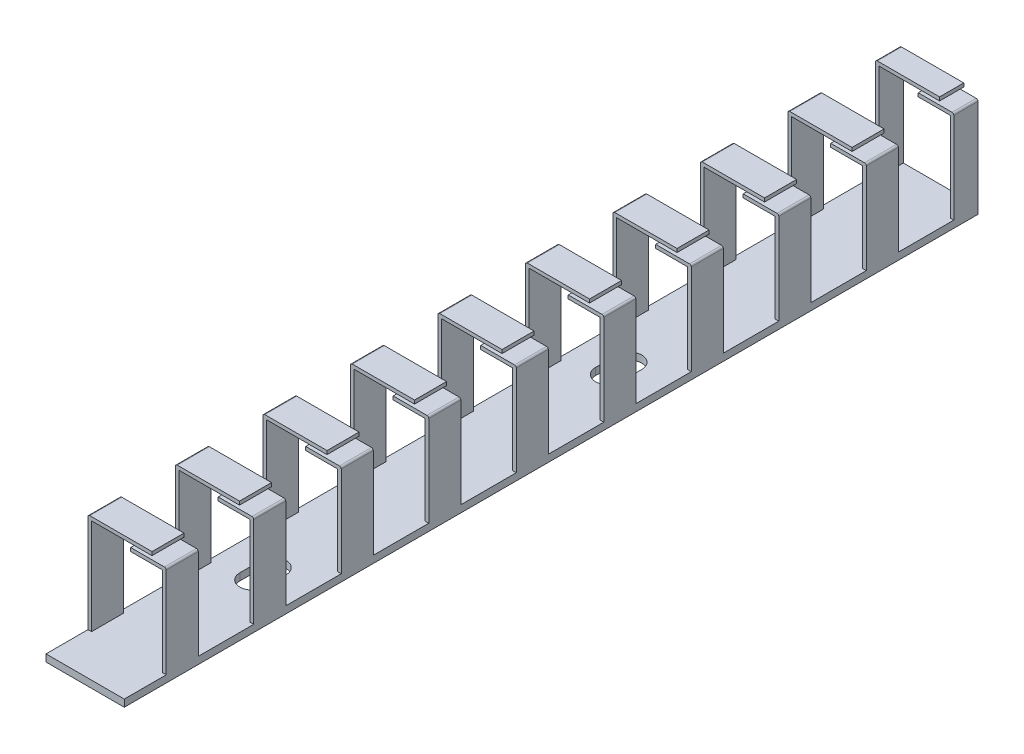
ISO-10303-21;
HEADER;
FILE_DESCRIPTION(('STEP AP214'),'2;1');
FILE_NAME('part.step','',(''),(''),'','','');
FILE_SCHEMA(('AUTOMOTIVE_DESIGN { 1 0 10303 214 1 1 1 1 }'));
ENDSEC;
DATA;
#1=APPLICATION_CONTEXT('core data for automotive mechanical design processes');
#2=APPLICATION_PROTOCOL_DEFINITION('international standard','automotive_design',2000,#1);
#3=PRODUCT_CONTEXT('',#1,'mechanical');
#4=PRODUCT('Part','Part','',(#3));
#5=PRODUCT_RELATED_PRODUCT_CATEGORY('part','',(#4));
#6=PRODUCT_DEFINITION_FORMATION('','',#4);
#7=PRODUCT_DEFINITION_CONTEXT('part definition',#1,'design');
#8=PRODUCT_DEFINITION('design','',#6,#7);
#9=PRODUCT_DEFINITION_SHAPE('','',#8);
#10=(LENGTH_UNIT() NAMED_UNIT(*) SI_UNIT(.MILLI.,.METRE.));
#11=(NAMED_UNIT(*) PLANE_ANGLE_UNIT() SI_UNIT($,.RADIAN.));
#12=(NAMED_UNIT(*) SI_UNIT($,.STERADIAN.) SOLID_ANGLE_UNIT());
#13=UNCERTAINTY_MEASURE_WITH_UNIT(LENGTH_MEASURE(1.E-05),#10,'distance_accuracy_value','');
#14=(GEOMETRIC_REPRESENTATION_CONTEXT(3) GLOBAL_UNCERTAINTY_ASSIGNED_CONTEXT((#13)) GLOBAL_UNIT_ASSIGNED_CONTEXT((#10,
#11,#12)) REPRESENTATION_CONTEXT('',''));
#15=CARTESIAN_POINT('',(0.,0.,0.));
#16=DIRECTION('',(0.,0.,1.));
#17=DIRECTION('',(1.,0.,0.));
#18=AXIS2_PLACEMENT_3D('',#15,#16,#17);
#19=CARTESIAN_POINT('',(10.75,13.75,250.));
#20=DIRECTION('',(0.,0.,-1.));
#21=DIRECTION('',(-1.,0.,0.));
#22=AXIS2_PLACEMENT_3D('',#19,#20,#21);
#23=CYLINDRICAL_SURFACE('',#22,0.25);
#24=DIRECTION('',(0.,0.,-1.));
#25=VECTOR('',#24,1.);
#26=CARTESIAN_POINT('',(10.75,14.,250.));
#27=LINE('',#26,#25);
#28=CARTESIAN_POINT('',(10.75,14.,244.1));
#29=VERTEX_POINT('',#28);
#30=CARTESIAN_POINT('',(10.75,14.,239.6));
#31=VERTEX_POINT('',#30);
#32=EDGE_CURVE('E1673',#29,#31,#27,.T.);
#33=ORIENTED_EDGE('',*,*,#32,.F.);
#34=CARTESIAN_POINT('',(10.75,13.75,244.1));
#35=DIRECTION('',(0.,0.,-1.));
#36=DIRECTION('',(-1.,0.,0.));
#37=AXIS2_PLACEMENT_3D('',#34,#35,#36);
#38=CIRCLE('',#37,0.25);
#39=CARTESIAN_POINT('',(11.,13.75,244.1));
#40=VERTEX_POINT('',#39);
#41=EDGE_CURVE('E1908',#29,#40,#38,.T.);
#42=ORIENTED_EDGE('',*,*,#41,.T.);
#43=DIRECTION('',(0.,0.,-1.));
#44=VECTOR('',#43,1.);
#45=CARTESIAN_POINT('',(11.,13.75,250.));
#46=LINE('',#45,#44);
#47=CARTESIAN_POINT('',(11.,13.75,239.6));
#48=VERTEX_POINT('',#47);
#49=EDGE_CURVE('E974',#40,#48,#46,.T.);
#50=ORIENTED_EDGE('',*,*,#49,.T.);
#51=CARTESIAN_POINT('',(10.75,13.75,239.6));
#52=DIRECTION('',(0.,0.,1.));
#53=DIRECTION('',(1.,0.,0.));
#54=AXIS2_PLACEMENT_3D('',#51,#52,#53);
#55=CIRCLE('',#54,0.25);
#56=EDGE_CURVE('E1986',#48,#31,#55,.T.);
#57=ORIENTED_EDGE('',*,*,#56,.T.);
#58=EDGE_LOOP('',(#33,#42,#50,#57));
#59=FACE_BOUND('',#58,.T.);
#60=ADVANCED_FACE('F34',(#59),#23,.T.);
#61=CARTESIAN_POINT('',(10.75,14.,250.));
#62=DIRECTION('',(0.,-1.,0.));
#63=DIRECTION('',(0.,0.,-1.));
#64=AXIS2_PLACEMENT_3D('',#61,#62,#63);
#65=PLANE('',#64);
#66=DIRECTION('',(0.,0.,-1.));
#67=VECTOR('',#66,1.);
#68=CARTESIAN_POINT('',(6.00000000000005,14.,250.));
#69=LINE('',#68,#67);
#70=CARTESIAN_POINT('',(6.00000000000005,14.,244.1));
#71=VERTEX_POINT('',#70);
#72=CARTESIAN_POINT('',(6.00000000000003,14.,239.6));
#73=VERTEX_POINT('',#72);
#74=EDGE_CURVE('E1670',#71,#73,#69,.T.);
#75=ORIENTED_EDGE('',*,*,#74,.F.);
#76=DIRECTION('',(1.,0.,0.));
#77=VECTOR('',#76,1.);
#78=CARTESIAN_POINT('',(10.75,14.,244.1));
#79=LINE('',#78,#77);
#80=EDGE_CURVE('E1906',#71,#29,#79,.T.);
#81=ORIENTED_EDGE('',*,*,#80,.T.);
#82=ORIENTED_EDGE('',*,*,#32,.T.);
#83=DIRECTION('',(-1.,0.,0.));
#84=VECTOR('',#83,1.);
#85=CARTESIAN_POINT('',(10.75,14.,239.6));
#86=LINE('',#85,#84);
#87=EDGE_CURVE('E1984',#31,#73,#86,.T.);
#88=ORIENTED_EDGE('',*,*,#87,.T.);
#89=EDGE_LOOP('',(#75,#81,#82,#88));
#90=FACE_BOUND('',#89,.T.);
#91=ADVANCED_FACE('F2085',(#90),#65,.F.);
#92=CARTESIAN_POINT('',(6.00000000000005,14.,250.));
#93=DIRECTION('',(1.,0.,0.));
#94=DIRECTION('',(0.,0.,-1.));
#95=AXIS2_PLACEMENT_3D('',#92,#93,#94);
#96=PLANE('',#95);
#97=DIRECTION('',(0.,0.,-1.));
#98=VECTOR('',#97,1.);
#99=CARTESIAN_POINT('',(6.00000000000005,13.5,250.));
#100=LINE('',#99,#98);
#101=CARTESIAN_POINT('',(6.00000000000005,13.5,244.1));
#102=VERTEX_POINT('',#101);
#103=CARTESIAN_POINT('',(6.00000000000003,13.5,239.6));
#104=VERTEX_POINT('',#103);
#105=EDGE_CURVE('E1666',#102,#104,#100,.T.);
#106=ORIENTED_EDGE('',*,*,#105,.F.);
#107=DIRECTION('',(0.,1.,0.));
#108=VECTOR('',#107,1.);
#109=CARTESIAN_POINT('',(6.00000000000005,14.,244.1));
#110=LINE('',#109,#108);
#111=EDGE_CURVE('E1903',#102,#71,#110,.T.);
#112=ORIENTED_EDGE('',*,*,#111,.T.);
#113=ORIENTED_EDGE('',*,*,#74,.T.);
#114=DIRECTION('',(0.,-1.,0.));
#115=VECTOR('',#114,1.);
#116=CARTESIAN_POINT('',(6.00000000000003,14.,239.6));
#117=LINE('',#116,#115);
#118=EDGE_CURVE('E1981',#73,#104,#117,.T.);
#119=ORIENTED_EDGE('',*,*,#118,.T.);
#120=EDGE_LOOP('',(#106,#112,#113,#119));
#121=FACE_BOUND('',#120,.T.);
#122=ADVANCED_FACE('F2092',(#121),#96,.F.);
#123=CARTESIAN_POINT('',(10.5,13.5,250.));
#124=DIRECTION('',(0.,1.,0.));
#125=DIRECTION('',(0.,0.,1.));
#126=AXIS2_PLACEMENT_3D('',#123,#124,#125);
#127=PLANE('',#126);
#128=DIRECTION('',(0.,0.,-1.));
#129=VECTOR('',#128,1.);
#130=CARTESIAN_POINT('',(10.5,13.5,250.));
#131=LINE('',#130,#129);
#132=CARTESIAN_POINT('',(10.5,13.5,244.1));
#133=VERTEX_POINT('',#132);
#134=CARTESIAN_POINT('',(10.5,13.5,239.6));
#135=VERTEX_POINT('',#134);
#136=EDGE_CURVE('E1662',#133,#135,#131,.T.);
#137=ORIENTED_EDGE('',*,*,#136,.F.);
#138=DIRECTION('',(-1.,0.,0.));
#139=VECTOR('',#138,1.);
#140=CARTESIAN_POINT('',(10.5,13.5,244.1));
#141=LINE('',#140,#139);
#142=EDGE_CURVE('E1900',#133,#102,#141,.T.);
#143=ORIENTED_EDGE('',*,*,#142,.T.);
#144=ORIENTED_EDGE('',*,*,#105,.T.);
#145=DIRECTION('',(1.,0.,0.));
#146=VECTOR('',#145,1.);
#147=CARTESIAN_POINT('',(10.5,13.5,239.6));
#148=LINE('',#147,#146);
#149=EDGE_CURVE('E1978',#104,#135,#148,.T.);
#150=ORIENTED_EDGE('',*,*,#149,.T.);
#151=EDGE_LOOP('',(#137,#143,#144,#150));
#152=FACE_BOUND('',#151,.T.);
#153=ADVANCED_FACE('F2637',(#152),#127,.F.);
#154=CARTESIAN_POINT('',(10.5000000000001,1.,250.));
#155=DIRECTION('',(1.,0.,0.));
#156=DIRECTION('',(0.,0.,-1.));
#157=AXIS2_PLACEMENT_3D('',#154,#155,#156);
#158=PLANE('',#157);
#159=DIRECTION('',(0.,0.,-1.));
#160=VECTOR('',#159,1.);
#161=CARTESIAN_POINT('',(10.5000000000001,1.,250.));
#162=LINE('',#161,#160);
#163=CARTESIAN_POINT('',(10.5000000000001,1.,244.1));
#164=VERTEX_POINT('',#163);
#165=CARTESIAN_POINT('',(10.5,1.,239.6));
#166=VERTEX_POINT('',#165);
#167=EDGE_CURVE('E1658',#164,#166,#162,.T.);
#168=ORIENTED_EDGE('',*,*,#167,.F.);
#169=DIRECTION('',(0.,1.,0.));
#170=VECTOR('',#169,1.);
#171=CARTESIAN_POINT('',(10.5000000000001,1.,244.1));
#172=LINE('',#171,#170);
#173=EDGE_CURVE('E1897',#164,#133,#172,.T.);
#174=ORIENTED_EDGE('',*,*,#173,.T.);
#175=ORIENTED_EDGE('',*,*,#136,.T.);
#176=DIRECTION('',(0.,-1.,0.));
#177=VECTOR('',#176,1.);
#178=CARTESIAN_POINT('',(10.5,1.,239.6));
#179=LINE('',#178,#177);
#180=EDGE_CURVE('E1975',#135,#166,#179,.T.);
#181=ORIENTED_EDGE('',*,*,#180,.T.);
#182=EDGE_LOOP('',(#168,#174,#175,#181));
#183=FACE_BOUND('',#182,.T.);
#184=ADVANCED_FACE('F2485',(#183),#158,.F.);
#185=CARTESIAN_POINT('',(0.500000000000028,1.,250.));
#186=DIRECTION('',(-1.,0.,0.));
#187=DIRECTION('',(0.,-1.,0.));
#188=AXIS2_PLACEMENT_3D('',#185,#186,#187);
#189=PLANE('',#188);
#190=DIRECTION('',(0.,0.,-1.));
#191=VECTOR('',#190,1.);
#192=CARTESIAN_POINT('',(0.500000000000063,14.5,250.));
#193=LINE('',#192,#191);
#194=CARTESIAN_POINT('',(0.500000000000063,14.5,244.1));
#195=VERTEX_POINT('',#194);
#196=CARTESIAN_POINT('',(0.500000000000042,14.5,239.6));
#197=VERTEX_POINT('',#196);
#198=EDGE_CURVE('E1650',#195,#197,#193,.T.);
#199=ORIENTED_EDGE('',*,*,#198,.F.);
#200=DIRECTION('',(0.,-1.,0.));
#201=VECTOR('',#200,1.);
#202=CARTESIAN_POINT('',(0.500000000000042,1.,244.1));
#203=LINE('',#202,#201);
#204=CARTESIAN_POINT('',(0.500000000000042,1.,244.1));
#205=VERTEX_POINT('',#204);
#206=EDGE_CURVE('E1894',#195,#205,#203,.T.);
#207=ORIENTED_EDGE('',*,*,#206,.T.);
#208=DIRECTION('',(0.,0.,-1.));
#209=VECTOR('',#208,1.);
#210=CARTESIAN_POINT('',(0.500000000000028,1.,250.));
#211=LINE('',#210,#209);
#212=CARTESIAN_POINT('',(0.500000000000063,1.,239.6));
#213=VERTEX_POINT('',#212);
#214=EDGE_CURVE('E1654',#205,#213,#211,.T.);
#215=ORIENTED_EDGE('',*,*,#214,.T.);
#216=DIRECTION('',(0.,1.,0.));
#217=VECTOR('',#216,1.);
#218=CARTESIAN_POINT('',(0.500000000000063,1.,239.6));
#219=LINE('',#218,#217);
#220=EDGE_CURVE('E1972',#213,#197,#219,.T.);
#221=ORIENTED_EDGE('',*,*,#220,.T.);
#222=EDGE_LOOP('',(#199,#207,#215,#221));
#223=FACE_BOUND('',#222,.T.);
#224=ADVANCED_FACE('F2477',(#223),#189,.F.);
#225=CARTESIAN_POINT('',(0.500000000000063,14.5,250.));
#226=DIRECTION('',(0.,1.,0.));
#227=DIRECTION('',(0.,0.,1.));
#228=AXIS2_PLACEMENT_3D('',#225,#226,#227);
#229=PLANE('',#228);
#230=DIRECTION('',(0.,0.,-1.));
#231=VECTOR('',#230,1.);
#232=CARTESIAN_POINT('',(9.00000000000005,14.5,250.));
#233=LINE('',#232,#231);
#234=CARTESIAN_POINT('',(9.00000000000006,14.5,244.1));
#235=VERTEX_POINT('',#234);
#236=CARTESIAN_POINT('',(9.00000000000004,14.5,239.6));
#237=VERTEX_POINT('',#236);
#238=EDGE_CURVE('E1646',#235,#237,#233,.T.);
#239=ORIENTED_EDGE('',*,*,#238,.F.);
#240=DIRECTION('',(-1.,0.,0.));
#241=VECTOR('',#240,1.);
#242=CARTESIAN_POINT('',(0.500000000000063,14.5,244.1));
#243=LINE('',#242,#241);
#244=EDGE_CURVE('E1891',#235,#195,#243,.T.);
#245=ORIENTED_EDGE('',*,*,#244,.T.);
#246=ORIENTED_EDGE('',*,*,#198,.T.);
#247=DIRECTION('',(1.,0.,0.));
#248=VECTOR('',#247,1.);
#249=CARTESIAN_POINT('',(0.500000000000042,14.5,239.6));
#250=LINE('',#249,#248);
#251=EDGE_CURVE('E1969',#197,#237,#250,.T.);
#252=ORIENTED_EDGE('',*,*,#251,.T.);
#253=EDGE_LOOP('',(#239,#245,#246,#252));
#254=FACE_BOUND('',#253,.T.);
#255=ADVANCED_FACE('F2419',(#254),#229,.F.);
#256=CARTESIAN_POINT('',(9.00000000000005,15.,250.));
#257=DIRECTION('',(-1.,0.,0.));
#258=DIRECTION('',(0.,0.,1.));
#259=AXIS2_PLACEMENT_3D('',#256,#257,#258);
#260=PLANE('',#259);
#261=DIRECTION('',(0.,0.,-1.));
#262=VECTOR('',#261,1.);
#263=CARTESIAN_POINT('',(9.00000000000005,15.,250.));
#264=LINE('',#263,#262);
#265=CARTESIAN_POINT('',(9.00000000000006,15.,244.1));
#266=VERTEX_POINT('',#265);
#267=CARTESIAN_POINT('',(9.00000000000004,15.,239.6));
#268=VERTEX_POINT('',#267);
#269=EDGE_CURVE('E1642',#266,#268,#264,.T.);
#270=ORIENTED_EDGE('',*,*,#269,.F.);
#271=DIRECTION('',(0.,-1.,0.));
#272=VECTOR('',#271,1.);
#273=CARTESIAN_POINT('',(9.00000000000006,15.,244.1));
#274=LINE('',#273,#272);
#275=EDGE_CURVE('E1888',#266,#235,#274,.T.);
#276=ORIENTED_EDGE('',*,*,#275,.T.);
#277=ORIENTED_EDGE('',*,*,#238,.T.);
#278=DIRECTION('',(0.,1.,0.));
#279=VECTOR('',#278,1.);
#280=CARTESIAN_POINT('',(9.00000000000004,15.,239.6));
#281=LINE('',#280,#279);
#282=EDGE_CURVE('E1966',#237,#268,#281,.T.);
#283=ORIENTED_EDGE('',*,*,#282,.T.);
#284=EDGE_LOOP('',(#270,#276,#277,#283));
#285=FACE_BOUND('',#284,.T.);
#286=ADVANCED_FACE('F2192',(#285),#260,.F.);
#287=CARTESIAN_POINT('',(0.250000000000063,15.,250.));
#288=DIRECTION('',(0.,-1.,0.));
#289=DIRECTION('',(0.,0.,-1.));
#290=AXIS2_PLACEMENT_3D('',#287,#288,#289);
#291=PLANE('',#290);
#292=DIRECTION('',(0.,0.,-1.));
#293=VECTOR('',#292,1.);
#294=CARTESIAN_POINT('',(0.250000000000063,15.,250.));
#295=LINE('',#294,#293);
#296=CARTESIAN_POINT('',(0.250000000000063,15.,244.1));
#297=VERTEX_POINT('',#296);
#298=CARTESIAN_POINT('',(0.250000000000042,15.,239.6));
#299=VERTEX_POINT('',#298);
#300=EDGE_CURVE('E1639',#297,#299,#295,.T.);
#301=ORIENTED_EDGE('',*,*,#300,.F.);
#302=DIRECTION('',(1.,0.,0.));
#303=VECTOR('',#302,1.);
#304=CARTESIAN_POINT('',(0.250000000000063,15.,244.1));
#305=LINE('',#304,#303);
#306=EDGE_CURVE('E1885',#297,#266,#305,.T.);
#307=ORIENTED_EDGE('',*,*,#306,.T.);
#308=ORIENTED_EDGE('',*,*,#269,.T.);
#309=DIRECTION('',(-1.,0.,0.));
#310=VECTOR('',#309,1.);
#311=CARTESIAN_POINT('',(0.250000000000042,15.,239.6));
#312=LINE('',#311,#310);
#313=EDGE_CURVE('E1963',#268,#299,#312,.T.);
#314=ORIENTED_EDGE('',*,*,#313,.T.);
#315=EDGE_LOOP('',(#301,#307,#308,#314));
#316=FACE_BOUND('',#315,.T.);
#317=ADVANCED_FACE('F2185',(#316),#291,.F.);
#318=CARTESIAN_POINT('',(0.250000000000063,14.75,250.));
#319=DIRECTION('',(0.,0.,-1.));
#320=DIRECTION('',(-1.,0.,0.));
#321=AXIS2_PLACEMENT_3D('',#318,#319,#320);
#322=CYLINDRICAL_SURFACE('',#321,0.25);
#323=DIRECTION('',(0.,0.,-1.));
#324=VECTOR('',#323,1.);
#325=CARTESIAN_POINT('',(0.,14.75,250.));
#326=LINE('',#325,#324);
#327=CARTESIAN_POINT('',(0.,14.75,244.1));
#328=VERTEX_POINT('',#327);
#329=CARTESIAN_POINT('',(0.,14.75,239.6));
#330=VERTEX_POINT('',#329);
#331=EDGE_CURVE('E1636',#328,#330,#326,.T.);
#332=ORIENTED_EDGE('',*,*,#331,.F.);
#333=CARTESIAN_POINT('',(0.250000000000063,14.75,244.1));
#334=DIRECTION('',(0.,0.,-1.));
#335=DIRECTION('',(-1.,0.,0.));
#336=AXIS2_PLACEMENT_3D('',#333,#334,#335);
#337=CIRCLE('',#336,0.25);
#338=EDGE_CURVE('E1882',#328,#297,#337,.T.);
#339=ORIENTED_EDGE('',*,*,#338,.T.);
#340=ORIENTED_EDGE('',*,*,#300,.T.);
#341=CARTESIAN_POINT('',(0.250000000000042,14.75,239.6));
#342=DIRECTION('',(0.,0.,1.));
#343=DIRECTION('',(1.,0.,0.));
#344=AXIS2_PLACEMENT_3D('',#341,#342,#343);
#345=CIRCLE('',#344,0.25);
#346=EDGE_CURVE('E1960',#299,#330,#345,.T.);
#347=ORIENTED_EDGE('',*,*,#346,.T.);
#348=EDGE_LOOP('',(#332,#339,#340,#347));
#349=FACE_BOUND('',#348,.T.);
#350=ADVANCED_FACE('F2096',(#349),#322,.T.);
#351=CARTESIAN_POINT('',(10.75,14.,231.8));
#352=VERTEX_POINT('',#351);
#353=CARTESIAN_POINT('',(10.75,14.,227.3));
#354=VERTEX_POINT('',#353);
#355=EDGE_CURVE('E1674',#352,#354,#27,.T.);
#356=ORIENTED_EDGE('',*,*,#355,.F.);
#357=CARTESIAN_POINT('',(10.75,13.75,231.8));
#358=DIRECTION('',(0.,0.,-1.));
#359=DIRECTION('',(-1.,0.,0.));
#360=AXIS2_PLACEMENT_3D('',#357,#358,#359);
#361=CIRCLE('',#360,0.25);
#362=CARTESIAN_POINT('',(11.,13.75,231.8));
#363=VERTEX_POINT('',#362);
#364=EDGE_CURVE('E1957',#352,#363,#361,.T.);
#365=ORIENTED_EDGE('',*,*,#364,.T.);
#366=CARTESIAN_POINT('',(11.,13.75,227.3));
#367=VERTEX_POINT('',#366);
#368=EDGE_CURVE('E979',#363,#367,#46,.T.);
#369=ORIENTED_EDGE('',*,*,#368,.T.);
#370=CARTESIAN_POINT('',(10.75,13.75,227.3));
#371=DIRECTION('',(0.,0.,1.));
#372=DIRECTION('',(1.,0.,0.));
#373=AXIS2_PLACEMENT_3D('',#370,#371,#372);
#374=CIRCLE('',#373,0.25);
#375=EDGE_CURVE('E1057',#367,#354,#374,.T.);
#376=ORIENTED_EDGE('',*,*,#375,.T.);
#377=EDGE_LOOP('',(#356,#365,#369,#376));
#378=FACE_BOUND('',#377,.T.);
#379=ADVANCED_FACE('F2088',(#378),#23,.T.);
#380=CARTESIAN_POINT('',(6.00000000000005,14.,231.8));
#381=VERTEX_POINT('',#380);
#382=CARTESIAN_POINT('',(6.00000000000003,14.,227.3));
#383=VERTEX_POINT('',#382);
#384=EDGE_CURVE('E1672',#381,#383,#69,.T.);
#385=ORIENTED_EDGE('',*,*,#384,.F.);
#386=DIRECTION('',(1.,0.,0.));
#387=VECTOR('',#386,1.);
#388=CARTESIAN_POINT('',(10.75,14.,231.8));
#389=LINE('',#388,#387);
#390=EDGE_CURVE('E1954',#381,#352,#389,.T.);
#391=ORIENTED_EDGE('',*,*,#390,.T.);
#392=ORIENTED_EDGE('',*,*,#355,.T.);
#393=DIRECTION('',(-1.,0.,0.));
#394=VECTOR('',#393,1.);
#395=CARTESIAN_POINT('',(10.75,14.,227.3));
#396=LINE('',#395,#394);
#397=EDGE_CURVE('E1054',#354,#383,#396,.T.);
#398=ORIENTED_EDGE('',*,*,#397,.T.);
#399=EDGE_LOOP('',(#385,#391,#392,#398));
#400=FACE_BOUND('',#399,.T.);
#401=ADVANCED_FACE('F2094',(#400),#65,.F.);
#402=CARTESIAN_POINT('',(6.00000000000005,13.5,231.8));
#403=VERTEX_POINT('',#402);
#404=CARTESIAN_POINT('',(6.00000000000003,13.5,227.3));
#405=VERTEX_POINT('',#404);
#406=EDGE_CURVE('E1669',#403,#405,#100,.T.);
#407=ORIENTED_EDGE('',*,*,#406,.F.);
#408=DIRECTION('',(0.,1.,0.));
#409=VECTOR('',#408,1.);
#410=CARTESIAN_POINT('',(6.00000000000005,14.,231.8));
#411=LINE('',#410,#409);
#412=EDGE_CURVE('E1951',#403,#381,#411,.T.);
#413=ORIENTED_EDGE('',*,*,#412,.T.);
#414=ORIENTED_EDGE('',*,*,#384,.T.);
#415=DIRECTION('',(0.,-1.,0.));
#416=VECTOR('',#415,1.);
#417=CARTESIAN_POINT('',(6.00000000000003,14.,227.3));
#418=LINE('',#417,#416);
#419=EDGE_CURVE('E1051',#383,#405,#418,.T.);
#420=ORIENTED_EDGE('',*,*,#419,.T.);
#421=EDGE_LOOP('',(#407,#413,#414,#420));
#422=FACE_BOUND('',#421,.T.);
#423=ADVANCED_FACE('F2534',(#422),#96,.F.);
#424=CARTESIAN_POINT('',(10.5,13.5,231.8));
#425=VERTEX_POINT('',#424);
#426=CARTESIAN_POINT('',(10.5,13.5,227.3));
#427=VERTEX_POINT('',#426);
#428=EDGE_CURVE('E1665',#425,#427,#131,.T.);
#429=ORIENTED_EDGE('',*,*,#428,.F.);
#430=DIRECTION('',(-1.,0.,0.));
#431=VECTOR('',#430,1.);
#432=CARTESIAN_POINT('',(10.5,13.5,231.8));
#433=LINE('',#432,#431);
#434=EDGE_CURVE('E1948',#425,#403,#433,.T.);
#435=ORIENTED_EDGE('',*,*,#434,.T.);
#436=ORIENTED_EDGE('',*,*,#406,.T.);
#437=DIRECTION('',(1.,0.,0.));
#438=VECTOR('',#437,1.);
#439=CARTESIAN_POINT('',(10.5,13.5,227.3));
#440=LINE('',#439,#438);
#441=EDGE_CURVE('E1048',#405,#427,#440,.T.);
#442=ORIENTED_EDGE('',*,*,#441,.T.);
#443=EDGE_LOOP('',(#429,#435,#436,#442));
#444=FACE_BOUND('',#443,.T.);
#445=ADVANCED_FACE('F2631',(#444),#127,.F.);
#446=CARTESIAN_POINT('',(10.5,1.,231.8));
#447=VERTEX_POINT('',#446);
#448=CARTESIAN_POINT('',(10.5,1.,227.3));
#449=VERTEX_POINT('',#448);
#450=EDGE_CURVE('E1661',#447,#449,#162,.T.);
#451=ORIENTED_EDGE('',*,*,#450,.F.);
#452=DIRECTION('',(0.,1.,0.));
#453=VECTOR('',#452,1.);
#454=CARTESIAN_POINT('',(10.5,1.,231.8));
#455=LINE('',#454,#453);
#456=EDGE_CURVE('E1945',#447,#425,#455,.T.);
#457=ORIENTED_EDGE('',*,*,#456,.T.);
#458=ORIENTED_EDGE('',*,*,#428,.T.);
#459=DIRECTION('',(0.,-1.,0.));
#460=VECTOR('',#459,1.);
#461=CARTESIAN_POINT('',(10.5,1.,227.3));
#462=LINE('',#461,#460);
#463=EDGE_CURVE('E1045',#427,#449,#462,.T.);
#464=ORIENTED_EDGE('',*,*,#463,.T.);
#465=EDGE_LOOP('',(#451,#457,#458,#464));
#466=FACE_BOUND('',#465,.T.);
#467=ADVANCED_FACE('F2476',(#466),#158,.F.);
#468=CARTESIAN_POINT('',(0.500000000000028,14.5,231.8));
#469=VERTEX_POINT('',#468);
#470=CARTESIAN_POINT('',(0.500000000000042,14.5,227.3));
#471=VERTEX_POINT('',#470);
#472=EDGE_CURVE('E1653',#469,#471,#193,.T.);
#473=ORIENTED_EDGE('',*,*,#472,.F.);
#474=DIRECTION('',(0.,-1.,0.));
#475=VECTOR('',#474,1.);
#476=CARTESIAN_POINT('',(0.500000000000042,1.,231.8));
#477=LINE('',#476,#475);
#478=CARTESIAN_POINT('',(0.500000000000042,1.,231.8));
#479=VERTEX_POINT('',#478);
#480=EDGE_CURVE('E1942',#469,#479,#477,.T.);
#481=ORIENTED_EDGE('',*,*,#480,.T.);
#482=CARTESIAN_POINT('',(0.500000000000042,1.,227.3));
#483=VERTEX_POINT('',#482);
#484=EDGE_CURVE('E1657',#479,#483,#211,.T.);
#485=ORIENTED_EDGE('',*,*,#484,.T.);
#486=DIRECTION('',(0.,1.,0.));
#487=VECTOR('',#486,1.);
#488=CARTESIAN_POINT('',(0.500000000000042,1.,227.3));
#489=LINE('',#488,#487);
#490=EDGE_CURVE('E1042',#483,#471,#489,.T.);
#491=ORIENTED_EDGE('',*,*,#490,.T.);
#492=EDGE_LOOP('',(#473,#481,#485,#491));
#493=FACE_BOUND('',#492,.T.);
#494=ADVANCED_FACE('F2310',(#493),#189,.F.);
#495=CARTESIAN_POINT('',(9.00000000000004,14.5,231.8));
#496=VERTEX_POINT('',#495);
#497=CARTESIAN_POINT('',(9.00000000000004,14.5,227.3));
#498=VERTEX_POINT('',#497);
#499=EDGE_CURVE('E1649',#496,#498,#233,.T.);
#500=ORIENTED_EDGE('',*,*,#499,.F.);
#501=DIRECTION('',(-1.,0.,0.));
#502=VECTOR('',#501,1.);
#503=CARTESIAN_POINT('',(0.500000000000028,14.5,231.8));
#504=LINE('',#503,#502);
#505=EDGE_CURVE('E1939',#496,#469,#504,.T.);
#506=ORIENTED_EDGE('',*,*,#505,.T.);
#507=ORIENTED_EDGE('',*,*,#472,.T.);
#508=DIRECTION('',(1.,0.,0.));
#509=VECTOR('',#508,1.);
#510=CARTESIAN_POINT('',(0.500000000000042,14.5,227.3));
#511=LINE('',#510,#509);
#512=EDGE_CURVE('E1039',#471,#498,#511,.T.);
#513=ORIENTED_EDGE('',*,*,#512,.T.);
#514=EDGE_LOOP('',(#500,#506,#507,#513));
#515=FACE_BOUND('',#514,.T.);
#516=ADVANCED_FACE('F2307',(#515),#229,.F.);
#517=CARTESIAN_POINT('',(9.00000000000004,15.,231.8));
#518=VERTEX_POINT('',#517);
#519=CARTESIAN_POINT('',(9.00000000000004,15.,227.3));
#520=VERTEX_POINT('',#519);
#521=EDGE_CURVE('E1645',#518,#520,#264,.T.);
#522=ORIENTED_EDGE('',*,*,#521,.F.);
#523=DIRECTION('',(0.,-1.,0.));
#524=VECTOR('',#523,1.);
#525=CARTESIAN_POINT('',(9.00000000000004,15.,231.8));
#526=LINE('',#525,#524);
#527=EDGE_CURVE('E1936',#518,#496,#526,.T.);
#528=ORIENTED_EDGE('',*,*,#527,.T.);
#529=ORIENTED_EDGE('',*,*,#499,.T.);
#530=DIRECTION('',(0.,1.,0.));
#531=VECTOR('',#530,1.);
#532=CARTESIAN_POINT('',(9.00000000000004,15.,227.3));
#533=LINE('',#532,#531);
#534=EDGE_CURVE('E1030',#498,#520,#533,.T.);
#535=ORIENTED_EDGE('',*,*,#534,.T.);
#536=EDGE_LOOP('',(#522,#528,#529,#535));
#537=FACE_BOUND('',#536,.T.);
#538=ADVANCED_FACE('F2182',(#537),#260,.F.);
#539=CARTESIAN_POINT('',(0.250000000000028,15.,231.8));
#540=VERTEX_POINT('',#539);
#541=CARTESIAN_POINT('',(0.250000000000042,15.,227.3));
#542=VERTEX_POINT('',#541);
#543=EDGE_CURVE('E1026',#540,#542,#295,.T.);
#544=ORIENTED_EDGE('',*,*,#543,.F.);
#545=DIRECTION('',(1.,0.,0.));
#546=VECTOR('',#545,1.);
#547=CARTESIAN_POINT('',(0.250000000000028,15.,231.8));
#548=LINE('',#547,#546);
#549=EDGE_CURVE('E1933',#540,#518,#548,.T.);
#550=ORIENTED_EDGE('',*,*,#549,.T.);
#551=ORIENTED_EDGE('',*,*,#521,.T.);
#552=DIRECTION('',(-1.,0.,0.));
#553=VECTOR('',#552,1.);
#554=CARTESIAN_POINT('',(0.250000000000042,15.,227.3));
#555=LINE('',#554,#553);
#556=EDGE_CURVE('E1027',#520,#542,#555,.T.);
#557=ORIENTED_EDGE('',*,*,#556,.T.);
#558=EDGE_LOOP('',(#544,#550,#551,#557));
#559=FACE_BOUND('',#558,.T.);
#560=ADVANCED_FACE('F2178',(#559),#291,.F.);
#561=CARTESIAN_POINT('',(0.,14.75,231.8));
#562=VERTEX_POINT('',#561);
#563=CARTESIAN_POINT('',(0.,14.75,227.3));
#564=VERTEX_POINT('',#563);
#565=EDGE_CURVE('E1011',#562,#564,#326,.T.);
#566=ORIENTED_EDGE('',*,*,#565,.F.);
#567=CARTESIAN_POINT('',(0.250000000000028,14.75,231.8));
#568=DIRECTION('',(0.,0.,-1.));
#569=DIRECTION('',(-1.,0.,0.));
#570=AXIS2_PLACEMENT_3D('',#567,#568,#569);
#571=CIRCLE('',#570,0.25);
#572=EDGE_CURVE('E1927',#562,#540,#571,.T.);
#573=ORIENTED_EDGE('',*,*,#572,.T.);
#574=ORIENTED_EDGE('',*,*,#543,.T.);
#575=CARTESIAN_POINT('',(0.250000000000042,14.75,227.3));
#576=DIRECTION('',(0.,0.,1.));
#577=DIRECTION('',(1.,0.,0.));
#578=AXIS2_PLACEMENT_3D('',#575,#576,#577);
#579=CIRCLE('',#578,0.25);
#580=EDGE_CURVE('E1017',#542,#564,#579,.T.);
#581=ORIENTED_EDGE('',*,*,#580,.T.);
#582=EDGE_LOOP('',(#566,#573,#574,#581));
#583=FACE_BOUND('',#582,.T.);
#584=ADVANCED_FACE('F1023',(#583),#322,.T.);
#585=CARTESIAN_POINT('',(10.75,14.,219.5));
#586=VERTEX_POINT('',#585);
#587=CARTESIAN_POINT('',(10.75,14.,215.));
#588=VERTEX_POINT('',#587);
#589=EDGE_CURVE('E1681',#586,#588,#27,.T.);
#590=ORIENTED_EDGE('',*,*,#589,.F.);
#591=CARTESIAN_POINT('',(10.7500000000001,13.75,219.5));
#592=DIRECTION('',(0.,0.,-1.));
#593=DIRECTION('',(-1.,0.,0.));
#594=AXIS2_PLACEMENT_3D('',#591,#592,#593);
#595=CIRCLE('',#594,0.25);
#596=CARTESIAN_POINT('',(11.0000000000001,13.75,219.5));
#597=VERTEX_POINT('',#596);
#598=EDGE_CURVE('E1028',#586,#597,#595,.T.);
#599=ORIENTED_EDGE('',*,*,#598,.T.);
#600=CARTESIAN_POINT('',(11.,13.75,215.));
#601=VERTEX_POINT('',#600);
#602=EDGE_CURVE('E1725',#597,#601,#46,.T.);
#603=ORIENTED_EDGE('',*,*,#602,.T.);
#604=CARTESIAN_POINT('',(10.75,13.75,215.));
#605=DIRECTION('',(0.,0.,1.));
#606=DIRECTION('',(1.,0.,0.));
#607=AXIS2_PLACEMENT_3D('',#604,#605,#606);
#608=CIRCLE('',#607,0.25);
#609=EDGE_CURVE('E1138',#601,#588,#608,.T.);
#610=ORIENTED_EDGE('',*,*,#609,.T.);
#611=EDGE_LOOP('',(#590,#599,#603,#610));
#612=FACE_BOUND('',#611,.T.);
#613=ADVANCED_FACE('F1723',(#612),#23,.T.);
#614=CARTESIAN_POINT('',(6.00000000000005,14.,219.5));
#615=VERTEX_POINT('',#614);
#616=CARTESIAN_POINT('',(6.00000000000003,14.,215.));
#617=VERTEX_POINT('',#616);
#618=EDGE_CURVE('E2031',#615,#617,#69,.T.);
#619=ORIENTED_EDGE('',*,*,#618,.F.);
#620=DIRECTION('',(1.,0.,0.));
#621=VECTOR('',#620,1.);
#622=CARTESIAN_POINT('',(10.75,14.,219.5));
#623=LINE('',#622,#621);
#624=EDGE_CURVE('E1033',#615,#586,#623,.T.);
#625=ORIENTED_EDGE('',*,*,#624,.T.);
#626=ORIENTED_EDGE('',*,*,#589,.T.);
#627=DIRECTION('',(-1.,0.,0.));
#628=VECTOR('',#627,1.);
#629=CARTESIAN_POINT('',(10.75,14.,215.));
#630=LINE('',#629,#628);
#631=EDGE_CURVE('E1135',#588,#617,#630,.T.);
#632=ORIENTED_EDGE('',*,*,#631,.T.);
#633=EDGE_LOOP('',(#619,#625,#626,#632));
#634=FACE_BOUND('',#633,.T.);
#635=ADVANCED_FACE('F1715',(#634),#65,.F.);
#636=CARTESIAN_POINT('',(6.00000000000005,13.5,219.5));
#637=VERTEX_POINT('',#636);
#638=CARTESIAN_POINT('',(6.00000000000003,13.5,215.));
#639=VERTEX_POINT('',#638);
#640=EDGE_CURVE('E2032',#637,#639,#100,.T.);
#641=ORIENTED_EDGE('',*,*,#640,.F.);
#642=DIRECTION('',(0.,1.,0.));
#643=VECTOR('',#642,1.);
#644=CARTESIAN_POINT('',(6.00000000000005,14.,219.5));
#645=LINE('',#644,#643);
#646=EDGE_CURVE('E2026',#637,#615,#645,.T.);
#647=ORIENTED_EDGE('',*,*,#646,.T.);
#648=ORIENTED_EDGE('',*,*,#618,.T.);
#649=DIRECTION('',(0.,-1.,0.));
#650=VECTOR('',#649,1.);
#651=CARTESIAN_POINT('',(6.00000000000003,14.,215.));
#652=LINE('',#651,#650);
#653=EDGE_CURVE('E1132',#617,#639,#652,.T.);
#654=ORIENTED_EDGE('',*,*,#653,.T.);
#655=EDGE_LOOP('',(#641,#647,#648,#654));
#656=FACE_BOUND('',#655,.T.);
#657=ADVANCED_FACE('F2030',(#656),#96,.F.);
#658=CARTESIAN_POINT('',(10.5000000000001,13.5,219.5));
#659=VERTEX_POINT('',#658);
#660=CARTESIAN_POINT('',(10.5,13.5,215.));
#661=VERTEX_POINT('',#660);
#662=EDGE_CURVE('E2551',#659,#661,#131,.T.);
#663=ORIENTED_EDGE('',*,*,#662,.F.);
#664=DIRECTION('',(-1.,0.,0.));
#665=VECTOR('',#664,1.);
#666=CARTESIAN_POINT('',(10.5000000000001,13.5,219.5));
#667=LINE('',#666,#665);
#668=EDGE_CURVE('E2023',#659,#637,#667,.T.);
#669=ORIENTED_EDGE('',*,*,#668,.T.);
#670=ORIENTED_EDGE('',*,*,#640,.T.);
#671=DIRECTION('',(1.,0.,0.));
#672=VECTOR('',#671,1.);
#673=CARTESIAN_POINT('',(10.5,13.5,215.));
#674=LINE('',#673,#672);
#675=EDGE_CURVE('E1129',#639,#661,#674,.T.);
#676=ORIENTED_EDGE('',*,*,#675,.T.);
#677=EDGE_LOOP('',(#663,#669,#670,#676));
#678=FACE_BOUND('',#677,.T.);
#679=ADVANCED_FACE('F2624',(#678),#127,.F.);
#680=CARTESIAN_POINT('',(10.5,1.,219.5));
#681=VERTEX_POINT('',#680);
#682=CARTESIAN_POINT('',(10.5,1.,215.));
#683=VERTEX_POINT('',#682);
#684=EDGE_CURVE('E2671',#681,#683,#162,.T.);
#685=ORIENTED_EDGE('',*,*,#684,.F.);
#686=DIRECTION('',(0.,1.,0.));
#687=VECTOR('',#686,1.);
#688=CARTESIAN_POINT('',(10.5,1.,219.5));
#689=LINE('',#688,#687);
#690=EDGE_CURVE('E2020',#681,#659,#689,.T.);
#691=ORIENTED_EDGE('',*,*,#690,.T.);
#692=ORIENTED_EDGE('',*,*,#662,.T.);
#693=DIRECTION('',(0.,-1.,0.));
#694=VECTOR('',#693,1.);
#695=CARTESIAN_POINT('',(10.5,1.,215.));
#696=LINE('',#695,#694);
#697=EDGE_CURVE('E1126',#661,#683,#696,.T.);
#698=ORIENTED_EDGE('',*,*,#697,.T.);
#699=EDGE_LOOP('',(#685,#691,#692,#698));
#700=FACE_BOUND('',#699,.T.);
#701=ADVANCED_FACE('F2469',(#700),#158,.F.);
#702=CARTESIAN_POINT('',(0.500000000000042,14.5,219.5));
#703=VERTEX_POINT('',#702);
#704=CARTESIAN_POINT('',(0.500000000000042,14.5,215.));
#705=VERTEX_POINT('',#704);
#706=EDGE_CURVE('E2296',#703,#705,#193,.T.);
#707=ORIENTED_EDGE('',*,*,#706,.F.);
#708=DIRECTION('',(0.,-1.,0.));
#709=VECTOR('',#708,1.);
#710=CARTESIAN_POINT('',(0.500000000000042,1.,219.5));
#711=LINE('',#710,#709);
#712=CARTESIAN_POINT('',(0.500000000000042,1.,219.5));
#713=VERTEX_POINT('',#712);
#714=EDGE_CURVE('E2017',#703,#713,#711,.T.);
#715=ORIENTED_EDGE('',*,*,#714,.T.);
#716=CARTESIAN_POINT('',(0.500000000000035,1.,215.));
#717=VERTEX_POINT('',#716);
#718=EDGE_CURVE('E2313',#713,#717,#211,.T.);
#719=ORIENTED_EDGE('',*,*,#718,.T.);
#720=DIRECTION('',(0.,1.,0.));
#721=VECTOR('',#720,1.);
#722=CARTESIAN_POINT('',(0.500000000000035,1.,215.));
#723=LINE('',#722,#721);
#724=EDGE_CURVE('E1123',#717,#705,#723,.T.);
#725=ORIENTED_EDGE('',*,*,#724,.T.);
#726=EDGE_LOOP('',(#707,#715,#719,#725));
#727=FACE_BOUND('',#726,.T.);
#728=ADVANCED_FACE('F2376',(#727),#189,.F.);
#729=CARTESIAN_POINT('',(9.00000000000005,14.5,219.5));
#730=VERTEX_POINT('',#729);
#731=CARTESIAN_POINT('',(9.00000000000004,14.5,215.));
#732=VERTEX_POINT('',#731);
#733=EDGE_CURVE('E2379',#730,#732,#233,.T.);
#734=ORIENTED_EDGE('',*,*,#733,.F.);
#735=DIRECTION('',(-1.,0.,0.));
#736=VECTOR('',#735,1.);
#737=CARTESIAN_POINT('',(0.500000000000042,14.5,219.5));
#738=LINE('',#737,#736);
#739=EDGE_CURVE('E2014',#730,#703,#738,.T.);
#740=ORIENTED_EDGE('',*,*,#739,.T.);
#741=ORIENTED_EDGE('',*,*,#706,.T.);
#742=DIRECTION('',(1.,0.,0.));
#743=VECTOR('',#742,1.);
#744=CARTESIAN_POINT('',(0.500000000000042,14.5,215.));
#745=LINE('',#744,#743);
#746=EDGE_CURVE('E1120',#705,#732,#745,.T.);
#747=ORIENTED_EDGE('',*,*,#746,.T.);
#748=EDGE_LOOP('',(#734,#740,#741,#747));
#749=FACE_BOUND('',#748,.T.);
#750=ADVANCED_FACE('F2378',(#749),#229,.F.);
#751=CARTESIAN_POINT('',(9.00000000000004,15.,219.5));
#752=VERTEX_POINT('',#751);
#753=CARTESIAN_POINT('',(9.00000000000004,15.,215.));
#754=VERTEX_POINT('',#753);
#755=EDGE_CURVE('E2238',#752,#754,#264,.T.);
#756=ORIENTED_EDGE('',*,*,#755,.F.);
#757=DIRECTION('',(0.,-1.,0.));
#758=VECTOR('',#757,1.);
#759=CARTESIAN_POINT('',(9.00000000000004,15.,219.5));
#760=LINE('',#759,#758);
#761=EDGE_CURVE('E2011',#752,#730,#760,.T.);
#762=ORIENTED_EDGE('',*,*,#761,.T.);
#763=ORIENTED_EDGE('',*,*,#733,.T.);
#764=DIRECTION('',(0.,1.,0.));
#765=VECTOR('',#764,1.);
#766=CARTESIAN_POINT('',(9.00000000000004,15.,215.));
#767=LINE('',#766,#765);
#768=EDGE_CURVE('E1117',#732,#754,#767,.T.);
#769=ORIENTED_EDGE('',*,*,#768,.T.);
#770=EDGE_LOOP('',(#756,#762,#763,#769));
#771=FACE_BOUND('',#770,.T.);
#772=ADVANCED_FACE('F2462',(#771),#260,.F.);
#773=CARTESIAN_POINT('',(0.250000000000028,15.,219.5));
#774=VERTEX_POINT('',#773);
#775=CARTESIAN_POINT('',(0.250000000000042,15.,215.));
#776=VERTEX_POINT('',#775);
#777=EDGE_CURVE('E2225',#774,#776,#295,.T.);
#778=ORIENTED_EDGE('',*,*,#777,.F.);
#779=DIRECTION('',(1.,0.,0.));
#780=VECTOR('',#779,1.);
#781=CARTESIAN_POINT('',(0.250000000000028,15.,219.5));
#782=LINE('',#781,#780);
#783=EDGE_CURVE('E2008',#774,#752,#782,.T.);
#784=ORIENTED_EDGE('',*,*,#783,.T.);
#785=ORIENTED_EDGE('',*,*,#755,.T.);
#786=DIRECTION('',(-1.,0.,0.));
#787=VECTOR('',#786,1.);
#788=CARTESIAN_POINT('',(0.250000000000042,15.,215.));
#789=LINE('',#788,#787);
#790=EDGE_CURVE('E1114',#754,#776,#789,.T.);
#791=ORIENTED_EDGE('',*,*,#790,.T.);
#792=EDGE_LOOP('',(#778,#784,#785,#791));
#793=FACE_BOUND('',#792,.T.);
#794=ADVANCED_FACE('F2171',(#793),#291,.F.);
#795=CARTESIAN_POINT('',(0.,14.75,219.5));
#796=VERTEX_POINT('',#795);
#797=CARTESIAN_POINT('',(0.,14.75,215.));
#798=VERTEX_POINT('',#797);
#799=EDGE_CURVE('E2368',#796,#798,#326,.T.);
#800=ORIENTED_EDGE('',*,*,#799,.F.);
#801=CARTESIAN_POINT('',(0.250000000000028,14.75,219.5));
#802=DIRECTION('',(0.,0.,-1.));
#803=DIRECTION('',(-1.,0.,0.));
#804=AXIS2_PLACEMENT_3D('',#801,#802,#803);
#805=CIRCLE('',#804,0.25);
#806=EDGE_CURVE('E2003',#796,#774,#805,.T.);
#807=ORIENTED_EDGE('',*,*,#806,.T.);
#808=ORIENTED_EDGE('',*,*,#777,.T.);
#809=CARTESIAN_POINT('',(0.250000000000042,14.75,215.));
#810=DIRECTION('',(0.,0.,1.));
#811=DIRECTION('',(1.,0.,0.));
#812=AXIS2_PLACEMENT_3D('',#809,#810,#811);
#813=CIRCLE('',#812,0.25);
#814=EDGE_CURVE('E1111',#776,#798,#813,.T.);
#815=ORIENTED_EDGE('',*,*,#814,.T.);
#816=EDGE_LOOP('',(#800,#807,#808,#815));
#817=FACE_BOUND('',#816,.T.);
#818=ADVANCED_FACE('F2164',(#817),#322,.T.);
#819=CARTESIAN_POINT('',(10.75,14.,207.2));
#820=VERTEX_POINT('',#819);
#821=CARTESIAN_POINT('',(10.75,14.,202.7));
#822=VERTEX_POINT('',#821);
#823=EDGE_CURVE('E1703',#820,#822,#27,.T.);
#824=ORIENTED_EDGE('',*,*,#823,.F.);
#825=CARTESIAN_POINT('',(10.7500000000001,13.75,207.2));
#826=DIRECTION('',(0.,0.,-1.));
#827=DIRECTION('',(-1.,0.,0.));
#828=AXIS2_PLACEMENT_3D('',#825,#826,#827);
#829=CIRCLE('',#828,0.25);
#830=CARTESIAN_POINT('',(11.0000000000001,13.75,207.2));
#831=VERTEX_POINT('',#830);
#832=EDGE_CURVE('E1108',#820,#831,#829,.T.);
#833=ORIENTED_EDGE('',*,*,#832,.T.);
#834=CARTESIAN_POINT('',(11.,13.75,202.7));
#835=VERTEX_POINT('',#834);
#836=EDGE_CURVE('E1727',#831,#835,#46,.T.);
#837=ORIENTED_EDGE('',*,*,#836,.T.);
#838=CARTESIAN_POINT('',(10.75,13.75,202.7));
#839=DIRECTION('',(0.,0.,1.));
#840=DIRECTION('',(1.,0.,0.));
#841=AXIS2_PLACEMENT_3D('',#838,#839,#840);
#842=CIRCLE('',#841,0.25);
#843=EDGE_CURVE('E1219',#835,#822,#842,.T.);
#844=ORIENTED_EDGE('',*,*,#843,.T.);
#845=EDGE_LOOP('',(#824,#833,#837,#844));
#846=FACE_BOUND('',#845,.T.);
#847=ADVANCED_FACE('F2155',(#846),#23,.T.);
#848=CARTESIAN_POINT('',(6.00000000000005,14.,207.2));
#849=VERTEX_POINT('',#848);
#850=CARTESIAN_POINT('',(6.00000000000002,14.,202.7));
#851=VERTEX_POINT('',#850);
#852=EDGE_CURVE('E2034',#849,#851,#69,.T.);
#853=ORIENTED_EDGE('',*,*,#852,.F.);
#854=DIRECTION('',(1.,0.,0.));
#855=VECTOR('',#854,1.);
#856=CARTESIAN_POINT('',(10.75,14.,207.2));
#857=LINE('',#856,#855);
#858=EDGE_CURVE('E1105',#849,#820,#857,.T.);
#859=ORIENTED_EDGE('',*,*,#858,.T.);
#860=ORIENTED_EDGE('',*,*,#823,.T.);
#861=DIRECTION('',(-1.,0.,0.));
#862=VECTOR('',#861,1.);
#863=CARTESIAN_POINT('',(10.75,14.,202.7));
#864=LINE('',#863,#862);
#865=EDGE_CURVE('E1216',#822,#851,#864,.T.);
#866=ORIENTED_EDGE('',*,*,#865,.T.);
#867=EDGE_LOOP('',(#853,#859,#860,#866));
#868=FACE_BOUND('',#867,.T.);
#869=ADVANCED_FACE('F2161',(#868),#65,.F.);
#870=CARTESIAN_POINT('',(6.00000000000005,13.5,207.2));
#871=VERTEX_POINT('',#870);
#872=CARTESIAN_POINT('',(6.00000000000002,13.5,202.7));
#873=VERTEX_POINT('',#872);
#874=EDGE_CURVE('E2660',#871,#873,#100,.T.);
#875=ORIENTED_EDGE('',*,*,#874,.F.);
#876=DIRECTION('',(0.,1.,0.));
#877=VECTOR('',#876,1.);
#878=CARTESIAN_POINT('',(6.00000000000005,14.,207.2));
#879=LINE('',#878,#877);
#880=EDGE_CURVE('E1102',#871,#849,#879,.T.);
#881=ORIENTED_EDGE('',*,*,#880,.T.);
#882=ORIENTED_EDGE('',*,*,#852,.T.);
#883=DIRECTION('',(0.,-1.,0.));
#884=VECTOR('',#883,1.);
#885=CARTESIAN_POINT('',(6.00000000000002,14.,202.7));
#886=LINE('',#885,#884);
#887=EDGE_CURVE('E1213',#851,#873,#886,.T.);
#888=ORIENTED_EDGE('',*,*,#887,.T.);
#889=EDGE_LOOP('',(#875,#881,#882,#888));
#890=FACE_BOUND('',#889,.T.);
#891=ADVANCED_FACE('F2170',(#890),#96,.F.);
#892=CARTESIAN_POINT('',(10.5000000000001,13.5,207.2));
#893=VERTEX_POINT('',#892);
#894=CARTESIAN_POINT('',(10.5,13.5,202.7));
#895=VERTEX_POINT('',#894);
#896=EDGE_CURVE('E2552',#893,#895,#131,.T.);
#897=ORIENTED_EDGE('',*,*,#896,.F.);
#898=DIRECTION('',(-1.,0.,0.));
#899=VECTOR('',#898,1.);
#900=CARTESIAN_POINT('',(10.5000000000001,13.5,207.2));
#901=LINE('',#900,#899);
#902=EDGE_CURVE('E1099',#893,#871,#901,.T.);
#903=ORIENTED_EDGE('',*,*,#902,.T.);
#904=ORIENTED_EDGE('',*,*,#874,.T.);
#905=DIRECTION('',(1.,0.,0.));
#906=VECTOR('',#905,1.);
#907=CARTESIAN_POINT('',(10.5,13.5,202.7));
#908=LINE('',#907,#906);
#909=EDGE_CURVE('E1210',#873,#895,#908,.T.);
#910=ORIENTED_EDGE('',*,*,#909,.T.);
#911=EDGE_LOOP('',(#897,#903,#904,#910));
#912=FACE_BOUND('',#911,.T.);
#913=ADVANCED_FACE('F2617',(#912),#127,.F.);
#914=CARTESIAN_POINT('',(10.5,1.,207.2));
#915=VERTEX_POINT('',#914);
#916=CARTESIAN_POINT('',(10.5,1.,202.7));
#917=VERTEX_POINT('',#916);
#918=EDGE_CURVE('E2669',#915,#917,#162,.T.);
#919=ORIENTED_EDGE('',*,*,#918,.F.);
#920=DIRECTION('',(0.,1.,0.));
#921=VECTOR('',#920,1.);
#922=CARTESIAN_POINT('',(10.5,1.,207.2));
#923=LINE('',#922,#921);
#924=EDGE_CURVE('E1096',#915,#893,#923,.T.);
#925=ORIENTED_EDGE('',*,*,#924,.T.);
#926=ORIENTED_EDGE('',*,*,#896,.T.);
#927=DIRECTION('',(0.,-1.,0.));
#928=VECTOR('',#927,1.);
#929=CARTESIAN_POINT('',(10.5,1.,202.7));
#930=LINE('',#929,#928);
#931=EDGE_CURVE('E1207',#895,#917,#930,.T.);
#932=ORIENTED_EDGE('',*,*,#931,.T.);
#933=EDGE_LOOP('',(#919,#925,#926,#932));
#934=FACE_BOUND('',#933,.T.);
#935=ADVANCED_FACE('F2463',(#934),#158,.F.);
#936=CARTESIAN_POINT('',(0.500000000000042,14.5,207.2));
#937=VERTEX_POINT('',#936);
#938=CARTESIAN_POINT('',(0.500000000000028,14.5,202.7));
#939=VERTEX_POINT('',#938);
#940=EDGE_CURVE('E2292',#937,#939,#193,.T.);
#941=ORIENTED_EDGE('',*,*,#940,.F.);
#942=DIRECTION('',(0.,-1.,0.));
#943=VECTOR('',#942,1.);
#944=CARTESIAN_POINT('',(0.500000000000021,1.,207.2));
#945=LINE('',#944,#943);
#946=CARTESIAN_POINT('',(0.500000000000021,1.,207.2));
#947=VERTEX_POINT('',#946);
#948=EDGE_CURVE('E1093',#937,#947,#945,.T.);
#949=ORIENTED_EDGE('',*,*,#948,.T.);
#950=CARTESIAN_POINT('',(0.500000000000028,1.,202.7));
#951=VERTEX_POINT('',#950);
#952=EDGE_CURVE('E2314',#947,#951,#211,.T.);
#953=ORIENTED_EDGE('',*,*,#952,.T.);
#954=DIRECTION('',(0.,1.,0.));
#955=VECTOR('',#954,1.);
#956=CARTESIAN_POINT('',(0.500000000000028,1.,202.7));
#957=LINE('',#956,#955);
#958=EDGE_CURVE('E1204',#951,#939,#957,.T.);
#959=ORIENTED_EDGE('',*,*,#958,.T.);
#960=EDGE_LOOP('',(#941,#949,#953,#959));
#961=FACE_BOUND('',#960,.T.);
#962=ADVANCED_FACE('F2456',(#961),#189,.F.);
#963=CARTESIAN_POINT('',(9.00000000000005,14.5,207.2));
#964=VERTEX_POINT('',#963);
#965=CARTESIAN_POINT('',(9.00000000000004,14.5,202.7));
#966=VERTEX_POINT('',#965);
#967=EDGE_CURVE('E2380',#964,#966,#233,.T.);
#968=ORIENTED_EDGE('',*,*,#967,.F.);
#969=DIRECTION('',(-1.,0.,0.));
#970=VECTOR('',#969,1.);
#971=CARTESIAN_POINT('',(0.500000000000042,14.5,207.2));
#972=LINE('',#971,#970);
#973=EDGE_CURVE('E1090',#964,#937,#972,.T.);
#974=ORIENTED_EDGE('',*,*,#973,.T.);
#975=ORIENTED_EDGE('',*,*,#940,.T.);
#976=DIRECTION('',(1.,0.,0.));
#977=VECTOR('',#976,1.);
#978=CARTESIAN_POINT('',(0.500000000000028,14.5,202.7));
#979=LINE('',#978,#977);
#980=EDGE_CURVE('E1201',#939,#966,#979,.T.);
#981=ORIENTED_EDGE('',*,*,#980,.T.);
#982=EDGE_LOOP('',(#968,#974,#975,#981));
#983=FACE_BOUND('',#982,.T.);
#984=ADVANCED_FACE('F2449',(#983),#229,.F.);
#985=CARTESIAN_POINT('',(9.00000000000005,15.,207.2));
#986=VERTEX_POINT('',#985);
#987=CARTESIAN_POINT('',(9.00000000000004,15.,202.7));
#988=VERTEX_POINT('',#987);
#989=EDGE_CURVE('E2240',#986,#988,#264,.T.);
#990=ORIENTED_EDGE('',*,*,#989,.F.);
#991=DIRECTION('',(0.,-1.,0.));
#992=VECTOR('',#991,1.);
#993=CARTESIAN_POINT('',(9.00000000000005,15.,207.2));
#994=LINE('',#993,#992);
#995=EDGE_CURVE('E1087',#986,#964,#994,.T.);
#996=ORIENTED_EDGE('',*,*,#995,.T.);
#997=ORIENTED_EDGE('',*,*,#967,.T.);
#998=DIRECTION('',(0.,1.,0.));
#999=VECTOR('',#998,1.);
#1000=CARTESIAN_POINT('',(9.00000000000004,15.,202.7));
#1001=LINE('',#1000,#999);
#1002=EDGE_CURVE('E1198',#966,#988,#1001,.T.);
#1003=ORIENTED_EDGE('',*,*,#1002,.T.);
#1004=EDGE_LOOP('',(#990,#996,#997,#1003));
#1005=FACE_BOUND('',#1004,.T.);
#1006=ADVANCED_FACE('F2454',(#1005),#260,.F.);
#1007=CARTESIAN_POINT('',(0.250000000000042,15.,207.2));
#1008=VERTEX_POINT('',#1007);
#1009=CARTESIAN_POINT('',(0.250000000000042,15.,202.7));
#1010=VERTEX_POINT('',#1009);
#1011=EDGE_CURVE('E2222',#1008,#1010,#295,.T.);
#1012=ORIENTED_EDGE('',*,*,#1011,.F.);
#1013=DIRECTION('',(1.,0.,0.));
#1014=VECTOR('',#1013,1.);
#1015=CARTESIAN_POINT('',(0.250000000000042,15.,207.2));
#1016=LINE('',#1015,#1014);
#1017=EDGE_CURVE('E1084',#1008,#986,#1016,.T.);
#1018=ORIENTED_EDGE('',*,*,#1017,.T.);
#1019=ORIENTED_EDGE('',*,*,#989,.T.);
#1020=DIRECTION('',(-1.,0.,0.));
#1021=VECTOR('',#1020,1.);
#1022=CARTESIAN_POINT('',(0.250000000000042,15.,202.7));
#1023=LINE('',#1022,#1021);
#1024=EDGE_CURVE('E1195',#988,#1010,#1023,.T.);
#1025=ORIENTED_EDGE('',*,*,#1024,.T.);
#1026=EDGE_LOOP('',(#1012,#1018,#1019,#1025));
#1027=FACE_BOUND('',#1026,.T.);
#1028=ADVANCED_FACE('F2162',(#1027),#291,.F.);
#1029=CARTESIAN_POINT('',(0.,14.75,207.2));
#1030=VERTEX_POINT('',#1029);
#1031=CARTESIAN_POINT('',(0.,14.75,202.7));
#1032=VERTEX_POINT('',#1031);
#1033=EDGE_CURVE('E2365',#1030,#1032,#326,.T.);
#1034=ORIENTED_EDGE('',*,*,#1033,.F.);
#1035=CARTESIAN_POINT('',(0.250000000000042,14.75,207.2));
#1036=DIRECTION('',(0.,0.,-1.));
#1037=DIRECTION('',(-1.,0.,0.));
#1038=AXIS2_PLACEMENT_3D('',#1035,#1036,#1037);
#1039=CIRCLE('',#1038,0.25);
#1040=EDGE_CURVE('E1077',#1030,#1008,#1039,.T.);
#1041=ORIENTED_EDGE('',*,*,#1040,.T.);
#1042=ORIENTED_EDGE('',*,*,#1011,.T.);
#1043=CARTESIAN_POINT('',(0.250000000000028,14.75,202.7));
#1044=DIRECTION('',(0.,0.,1.));
#1045=DIRECTION('',(1.,0.,0.));
#1046=AXIS2_PLACEMENT_3D('',#1043,#1044,#1045);
#1047=CIRCLE('',#1046,0.25);
#1048=EDGE_CURVE('E1192',#1010,#1032,#1047,.T.);
#1049=ORIENTED_EDGE('',*,*,#1048,.T.);
#1050=EDGE_LOOP('',(#1034,#1041,#1042,#1049));
#1051=FACE_BOUND('',#1050,.T.);
#1052=ADVANCED_FACE('F2153',(#1051),#322,.T.);
#1053=CARTESIAN_POINT('',(10.75,14.,194.9));
#1054=VERTEX_POINT('',#1053);
#1055=CARTESIAN_POINT('',(10.75,14.,190.4));
#1056=VERTEX_POINT('',#1055);
#1057=EDGE_CURVE('E1699',#1054,#1056,#27,.T.);
#1058=ORIENTED_EDGE('',*,*,#1057,.F.);
#1059=CARTESIAN_POINT('',(10.75,13.75,194.9));
#1060=DIRECTION('',(0.,0.,-1.));
#1061=DIRECTION('',(-1.,0.,0.));
#1062=AXIS2_PLACEMENT_3D('',#1059,#1060,#1061);
#1063=CIRCLE('',#1062,0.25);
#1064=CARTESIAN_POINT('',(11.,13.75,194.9));
#1065=VERTEX_POINT('',#1064);
#1066=EDGE_CURVE('E1189',#1054,#1065,#1063,.T.);
#1067=ORIENTED_EDGE('',*,*,#1066,.T.);
#1068=CARTESIAN_POINT('',(11.,13.75,190.4));
#1069=VERTEX_POINT('',#1068);
#1070=EDGE_CURVE('E1728',#1065,#1069,#46,.T.);
#1071=ORIENTED_EDGE('',*,*,#1070,.T.);
#1072=CARTESIAN_POINT('',(10.75,13.75,190.4));
#1073=DIRECTION('',(0.,0.,1.));
#1074=DIRECTION('',(1.,0.,0.));
#1075=AXIS2_PLACEMENT_3D('',#1072,#1073,#1074);
#1076=CIRCLE('',#1075,0.25);
#1077=EDGE_CURVE('E1300',#1069,#1056,#1076,.T.);
#1078=ORIENTED_EDGE('',*,*,#1077,.T.);
#1079=EDGE_LOOP('',(#1058,#1067,#1071,#1078));
#1080=FACE_BOUND('',#1079,.T.);
#1081=ADVANCED_FACE('F2144',(#1080),#23,.T.);
#1082=CARTESIAN_POINT('',(6.00000000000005,14.,194.9));
#1083=VERTEX_POINT('',#1082);
#1084=CARTESIAN_POINT('',(6.00000000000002,14.,190.4));
#1085=VERTEX_POINT('',#1084);
#1086=EDGE_CURVE('E2035',#1083,#1085,#69,.T.);
#1087=ORIENTED_EDGE('',*,*,#1086,.F.);
#1088=DIRECTION('',(1.,0.,0.));
#1089=VECTOR('',#1088,1.);
#1090=CARTESIAN_POINT('',(10.75,14.,194.9));
#1091=LINE('',#1090,#1089);
#1092=EDGE_CURVE('E1186',#1083,#1054,#1091,.T.);
#1093=ORIENTED_EDGE('',*,*,#1092,.T.);
#1094=ORIENTED_EDGE('',*,*,#1057,.T.);
#1095=DIRECTION('',(-1.,0.,0.));
#1096=VECTOR('',#1095,1.);
#1097=CARTESIAN_POINT('',(10.75,14.,190.4));
#1098=LINE('',#1097,#1096);
#1099=EDGE_CURVE('E1297',#1056,#1085,#1098,.T.);
#1100=ORIENTED_EDGE('',*,*,#1099,.T.);
#1101=EDGE_LOOP('',(#1087,#1093,#1094,#1100));
#1102=FACE_BOUND('',#1101,.T.);
#1103=ADVANCED_FACE('F2150',(#1102),#65,.F.);
#1104=CARTESIAN_POINT('',(6.00000000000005,13.5,194.9));
#1105=VERTEX_POINT('',#1104);
#1106=CARTESIAN_POINT('',(6.00000000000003,13.5,190.4));
#1107=VERTEX_POINT('',#1106);
#1108=EDGE_CURVE('E2581',#1105,#1107,#100,.T.);
#1109=ORIENTED_EDGE('',*,*,#1108,.F.);
#1110=DIRECTION('',(0.,1.,0.));
#1111=VECTOR('',#1110,1.);
#1112=CARTESIAN_POINT('',(6.00000000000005,14.,194.9));
#1113=LINE('',#1112,#1111);
#1114=EDGE_CURVE('E1183',#1105,#1083,#1113,.T.);
#1115=ORIENTED_EDGE('',*,*,#1114,.T.);
#1116=ORIENTED_EDGE('',*,*,#1086,.T.);
#1117=DIRECTION('',(0.,-1.,0.));
#1118=VECTOR('',#1117,1.);
#1119=CARTESIAN_POINT('',(6.00000000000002,14.,190.4));
#1120=LINE('',#1119,#1118);
#1121=EDGE_CURVE('E1294',#1085,#1107,#1120,.T.);
#1122=ORIENTED_EDGE('',*,*,#1121,.T.);
#1123=EDGE_LOOP('',(#1109,#1115,#1116,#1122));
#1124=FACE_BOUND('',#1123,.T.);
#1125=ADVANCED_FACE('F2160',(#1124),#96,.F.);
#1126=CARTESIAN_POINT('',(10.5,13.5,194.9));
#1127=VERTEX_POINT('',#1126);
#1128=CARTESIAN_POINT('',(10.5,13.5,190.4));
#1129=VERTEX_POINT('',#1128);
#1130=EDGE_CURVE('E2556',#1127,#1129,#131,.T.);
#1131=ORIENTED_EDGE('',*,*,#1130,.F.);
#1132=DIRECTION('',(-1.,0.,0.));
#1133=VECTOR('',#1132,1.);
#1134=CARTESIAN_POINT('',(10.5,13.5,194.9));
#1135=LINE('',#1134,#1133);
#1136=EDGE_CURVE('E1180',#1127,#1105,#1135,.T.);
#1137=ORIENTED_EDGE('',*,*,#1136,.T.);
#1138=ORIENTED_EDGE('',*,*,#1108,.T.);
#1139=DIRECTION('',(1.,0.,0.));
#1140=VECTOR('',#1139,1.);
#1141=CARTESIAN_POINT('',(10.5,13.5,190.4));
#1142=LINE('',#1141,#1140);
#1143=EDGE_CURVE('E1291',#1107,#1129,#1142,.T.);
#1144=ORIENTED_EDGE('',*,*,#1143,.T.);
#1145=EDGE_LOOP('',(#1131,#1137,#1138,#1144));
#1146=FACE_BOUND('',#1145,.T.);
#1147=ADVANCED_FACE('F2610',(#1146),#127,.F.);
#1148=CARTESIAN_POINT('',(10.5,1.,194.9));
#1149=VERTEX_POINT('',#1148);
#1150=CARTESIAN_POINT('',(10.5,1.,190.4));
#1151=VERTEX_POINT('',#1150);
#1152=EDGE_CURVE('E2667',#1149,#1151,#162,.T.);
#1153=ORIENTED_EDGE('',*,*,#1152,.F.);
#1154=DIRECTION('',(0.,1.,0.));
#1155=VECTOR('',#1154,1.);
#1156=CARTESIAN_POINT('',(10.5,1.,194.9));
#1157=LINE('',#1156,#1155);
#1158=EDGE_CURVE('E1177',#1149,#1127,#1157,.T.);
#1159=ORIENTED_EDGE('',*,*,#1158,.T.);
#1160=ORIENTED_EDGE('',*,*,#1130,.T.);
#1161=DIRECTION('',(0.,-1.,0.));
#1162=VECTOR('',#1161,1.);
#1163=CARTESIAN_POINT('',(10.5,1.,190.4));
#1164=LINE('',#1163,#1162);
#1165=EDGE_CURVE('E1288',#1129,#1151,#1164,.T.);
#1166=ORIENTED_EDGE('',*,*,#1165,.T.);
#1167=EDGE_LOOP('',(#1153,#1159,#1160,#1166));
#1168=FACE_BOUND('',#1167,.T.);
#1169=ADVANCED_FACE('F2455',(#1168),#158,.F.);
#1170=CARTESIAN_POINT('',(0.500000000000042,14.5,194.9));
#1171=VERTEX_POINT('',#1170);
#1172=CARTESIAN_POINT('',(0.500000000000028,14.5,190.4));
#1173=VERTEX_POINT('',#1172);
#1174=EDGE_CURVE('E2288',#1171,#1173,#193,.T.);
#1175=ORIENTED_EDGE('',*,*,#1174,.F.);
#1176=DIRECTION('',(0.,-1.,0.));
#1177=VECTOR('',#1176,1.);
#1178=CARTESIAN_POINT('',(0.500000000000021,1.,194.9));
#1179=LINE('',#1178,#1177);
#1180=CARTESIAN_POINT('',(0.500000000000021,1.,194.9));
#1181=VERTEX_POINT('',#1180);
#1182=EDGE_CURVE('E1174',#1171,#1181,#1179,.T.);
#1183=ORIENTED_EDGE('',*,*,#1182,.T.);
#1184=CARTESIAN_POINT('',(0.500000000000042,1.,190.4));
#1185=VERTEX_POINT('',#1184);
#1186=EDGE_CURVE('E2318',#1181,#1185,#211,.T.);
#1187=ORIENTED_EDGE('',*,*,#1186,.T.);
#1188=DIRECTION('',(0.,1.,0.));
#1189=VECTOR('',#1188,1.);
#1190=CARTESIAN_POINT('',(0.500000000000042,1.,190.4));
#1191=LINE('',#1190,#1189);
#1192=EDGE_CURVE('E1285',#1185,#1173,#1191,.T.);
#1193=ORIENTED_EDGE('',*,*,#1192,.T.);
#1194=EDGE_LOOP('',(#1175,#1183,#1187,#1193));
#1195=FACE_BOUND('',#1194,.T.);
#1196=ADVANCED_FACE('F2447',(#1195),#189,.F.);
#1197=CARTESIAN_POINT('',(9.00000000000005,14.5,194.9));
#1198=VERTEX_POINT('',#1197);
#1199=CARTESIAN_POINT('',(9.00000000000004,14.5,190.4));
#1200=VERTEX_POINT('',#1199);
#1201=EDGE_CURVE('E2381',#1198,#1200,#233,.T.);
#1202=ORIENTED_EDGE('',*,*,#1201,.F.);
#1203=DIRECTION('',(-1.,0.,0.));
#1204=VECTOR('',#1203,1.);
#1205=CARTESIAN_POINT('',(0.500000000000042,14.5,194.9));
#1206=LINE('',#1205,#1204);
#1207=EDGE_CURVE('E1171',#1198,#1171,#1206,.T.);
#1208=ORIENTED_EDGE('',*,*,#1207,.T.);
#1209=ORIENTED_EDGE('',*,*,#1174,.T.);
#1210=DIRECTION('',(1.,0.,0.));
#1211=VECTOR('',#1210,1.);
#1212=CARTESIAN_POINT('',(0.500000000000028,14.5,190.4));
#1213=LINE('',#1212,#1211);
#1214=EDGE_CURVE('E1282',#1173,#1200,#1213,.T.);
#1215=ORIENTED_EDGE('',*,*,#1214,.T.);
#1216=EDGE_LOOP('',(#1202,#1208,#1209,#1215));
#1217=FACE_BOUND('',#1216,.T.);
#1218=ADVANCED_FACE('F2440',(#1217),#229,.F.);
#1219=CARTESIAN_POINT('',(9.00000000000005,15.,194.9));
#1220=VERTEX_POINT('',#1219);
#1221=CARTESIAN_POINT('',(9.00000000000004,15.,190.4));
#1222=VERTEX_POINT('',#1221);
#1223=EDGE_CURVE('E2241',#1220,#1222,#264,.T.);
#1224=ORIENTED_EDGE('',*,*,#1223,.F.);
#1225=DIRECTION('',(0.,-1.,0.));
#1226=VECTOR('',#1225,1.);
#1227=CARTESIAN_POINT('',(9.00000000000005,15.,194.9));
#1228=LINE('',#1227,#1226);
#1229=EDGE_CURVE('E1168',#1220,#1198,#1228,.T.);
#1230=ORIENTED_EDGE('',*,*,#1229,.T.);
#1231=ORIENTED_EDGE('',*,*,#1201,.T.);
#1232=DIRECTION('',(0.,1.,0.));
#1233=VECTOR('',#1232,1.);
#1234=CARTESIAN_POINT('',(9.00000000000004,15.,190.4));
#1235=LINE('',#1234,#1233);
#1236=EDGE_CURVE('E1279',#1200,#1222,#1235,.T.);
#1237=ORIENTED_EDGE('',*,*,#1236,.T.);
#1238=EDGE_LOOP('',(#1224,#1230,#1231,#1237));
#1239=FACE_BOUND('',#1238,.T.);
#1240=ADVANCED_FACE('F2445',(#1239),#260,.F.);
#1241=CARTESIAN_POINT('',(0.250000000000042,15.,194.9));
#1242=VERTEX_POINT('',#1241);
#1243=CARTESIAN_POINT('',(0.250000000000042,15.,190.4));
#1244=VERTEX_POINT('',#1243);
#1245=EDGE_CURVE('E2219',#1242,#1244,#295,.T.);
#1246=ORIENTED_EDGE('',*,*,#1245,.F.);
#1247=DIRECTION('',(1.,0.,0.));
#1248=VECTOR('',#1247,1.);
#1249=CARTESIAN_POINT('',(0.250000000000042,15.,194.9));
#1250=LINE('',#1249,#1248);
#1251=EDGE_CURVE('E1165',#1242,#1220,#1250,.T.);
#1252=ORIENTED_EDGE('',*,*,#1251,.T.);
#1253=ORIENTED_EDGE('',*,*,#1223,.T.);
#1254=DIRECTION('',(-1.,0.,0.));
#1255=VECTOR('',#1254,1.);
#1256=CARTESIAN_POINT('',(0.250000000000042,15.,190.4));
#1257=LINE('',#1256,#1255);
#1258=EDGE_CURVE('E1276',#1222,#1244,#1257,.T.);
#1259=ORIENTED_EDGE('',*,*,#1258,.T.);
#1260=EDGE_LOOP('',(#1246,#1252,#1253,#1259));
#1261=FACE_BOUND('',#1260,.T.);
#1262=ADVANCED_FACE('F2151',(#1261),#291,.F.);
#1263=CARTESIAN_POINT('',(0.,14.75,194.9));
#1264=VERTEX_POINT('',#1263);
#1265=CARTESIAN_POINT('',(0.,14.75,190.4));
#1266=VERTEX_POINT('',#1265);
#1267=EDGE_CURVE('E2362',#1264,#1266,#326,.T.);
#1268=ORIENTED_EDGE('',*,*,#1267,.F.);
#1269=CARTESIAN_POINT('',(0.250000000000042,14.75,194.9));
#1270=DIRECTION('',(0.,0.,-1.));
#1271=DIRECTION('',(-1.,0.,0.));
#1272=AXIS2_PLACEMENT_3D('',#1269,#1270,#1271);
#1273=CIRCLE('',#1272,0.25);
#1274=EDGE_CURVE('E1158',#1264,#1242,#1273,.T.);
#1275=ORIENTED_EDGE('',*,*,#1274,.T.);
#1276=ORIENTED_EDGE('',*,*,#1245,.T.);
#1277=CARTESIAN_POINT('',(0.250000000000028,14.75,190.4));
#1278=DIRECTION('',(0.,0.,1.));
#1279=DIRECTION('',(1.,0.,0.));
#1280=AXIS2_PLACEMENT_3D('',#1277,#1278,#1279);
#1281=CIRCLE('',#1280,0.25);
#1282=EDGE_CURVE('E1273',#1244,#1266,#1281,.T.);
#1283=ORIENTED_EDGE('',*,*,#1282,.T.);
#1284=EDGE_LOOP('',(#1268,#1275,#1276,#1283));
#1285=FACE_BOUND('',#1284,.T.);
#1286=ADVANCED_FACE('F2142',(#1285),#322,.T.);
#1287=CARTESIAN_POINT('',(10.75,14.,182.6));
#1288=VERTEX_POINT('',#1287);
#1289=CARTESIAN_POINT('',(10.75,14.,178.1));
#1290=VERTEX_POINT('',#1289);
#1291=EDGE_CURVE('E1695',#1288,#1290,#27,.T.);
#1292=ORIENTED_EDGE('',*,*,#1291,.F.);
#1293=CARTESIAN_POINT('',(10.75,13.75,182.6));
#1294=DIRECTION('',(0.,0.,-1.));
#1295=DIRECTION('',(-1.,0.,0.));
#1296=AXIS2_PLACEMENT_3D('',#1293,#1294,#1295);
#1297=CIRCLE('',#1296,0.25);
#1298=CARTESIAN_POINT('',(11.,13.75,182.6));
#1299=VERTEX_POINT('',#1298);
#1300=EDGE_CURVE('E1270',#1288,#1299,#1297,.T.);
#1301=ORIENTED_EDGE('',*,*,#1300,.T.);
#1302=CARTESIAN_POINT('',(11.,13.75,178.1));
#1303=VERTEX_POINT('',#1302);
#1304=EDGE_CURVE('E1732',#1299,#1303,#46,.T.);
#1305=ORIENTED_EDGE('',*,*,#1304,.T.);
#1306=CARTESIAN_POINT('',(10.75,13.75,178.1));
#1307=DIRECTION('',(0.,0.,1.));
#1308=DIRECTION('',(1.,0.,0.));
#1309=AXIS2_PLACEMENT_3D('',#1306,#1307,#1308);
#1310=CIRCLE('',#1309,0.25);
#1311=EDGE_CURVE('E1381',#1303,#1290,#1310,.T.);
#1312=ORIENTED_EDGE('',*,*,#1311,.T.);
#1313=EDGE_LOOP('',(#1292,#1301,#1305,#1312));
#1314=FACE_BOUND('',#1313,.T.);
#1315=ADVANCED_FACE('F2133',(#1314),#23,.T.);
#1316=CARTESIAN_POINT('',(6.00000000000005,14.,182.6));
#1317=VERTEX_POINT('',#1316);
#1318=CARTESIAN_POINT('',(6.00000000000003,14.,178.1));
#1319=VERTEX_POINT('',#1318);
#1320=EDGE_CURVE('E2039',#1317,#1319,#69,.T.);
#1321=ORIENTED_EDGE('',*,*,#1320,.F.);
#1322=DIRECTION('',(1.,0.,0.));
#1323=VECTOR('',#1322,1.);
#1324=CARTESIAN_POINT('',(10.75,14.,182.6));
#1325=LINE('',#1324,#1323);
#1326=EDGE_CURVE('E1267',#1317,#1288,#1325,.T.);
#1327=ORIENTED_EDGE('',*,*,#1326,.T.);
#1328=ORIENTED_EDGE('',*,*,#1291,.T.);
#1329=DIRECTION('',(-1.,0.,0.));
#1330=VECTOR('',#1329,1.);
#1331=CARTESIAN_POINT('',(10.75,14.,178.1));
#1332=LINE('',#1331,#1330);
#1333=EDGE_CURVE('E1378',#1290,#1319,#1332,.T.);
#1334=ORIENTED_EDGE('',*,*,#1333,.T.);
#1335=EDGE_LOOP('',(#1321,#1327,#1328,#1334));
#1336=FACE_BOUND('',#1335,.T.);
#1337=ADVANCED_FACE('F2139',(#1336),#65,.F.);
#1338=CARTESIAN_POINT('',(6.00000000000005,13.5,182.6));
#1339=VERTEX_POINT('',#1338);
#1340=CARTESIAN_POINT('',(6.00000000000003,13.5,178.1));
#1341=VERTEX_POINT('',#1340);
#1342=EDGE_CURVE('E2579',#1339,#1341,#100,.T.);
#1343=ORIENTED_EDGE('',*,*,#1342,.F.);
#1344=DIRECTION('',(0.,1.,0.));
#1345=VECTOR('',#1344,1.);
#1346=CARTESIAN_POINT('',(6.00000000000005,14.,182.6));
#1347=LINE('',#1346,#1345);
#1348=EDGE_CURVE('E1264',#1339,#1317,#1347,.T.);
#1349=ORIENTED_EDGE('',*,*,#1348,.T.);
#1350=ORIENTED_EDGE('',*,*,#1320,.T.);
#1351=DIRECTION('',(0.,-1.,0.));
#1352=VECTOR('',#1351,1.);
#1353=CARTESIAN_POINT('',(6.00000000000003,14.,178.1));
#1354=LINE('',#1353,#1352);
#1355=EDGE_CURVE('E1375',#1319,#1341,#1354,.T.);
#1356=ORIENTED_EDGE('',*,*,#1355,.T.);
#1357=EDGE_LOOP('',(#1343,#1349,#1350,#1356));
#1358=FACE_BOUND('',#1357,.T.);
#1359=ADVANCED_FACE('F2149',(#1358),#96,.F.);
#1360=CARTESIAN_POINT('',(10.5,13.5,182.6));
#1361=VERTEX_POINT('',#1360);
#1362=CARTESIAN_POINT('',(10.5,13.5,178.1));
#1363=VERTEX_POINT('',#1362);
#1364=EDGE_CURVE('E2560',#1361,#1363,#131,.T.);
#1365=ORIENTED_EDGE('',*,*,#1364,.F.);
#1366=DIRECTION('',(-1.,0.,0.));
#1367=VECTOR('',#1366,1.);
#1368=CARTESIAN_POINT('',(10.5,13.5,182.6));
#1369=LINE('',#1368,#1367);
#1370=EDGE_CURVE('E1261',#1361,#1339,#1369,.T.);
#1371=ORIENTED_EDGE('',*,*,#1370,.T.);
#1372=ORIENTED_EDGE('',*,*,#1342,.T.);
#1373=DIRECTION('',(1.,0.,0.));
#1374=VECTOR('',#1373,1.);
#1375=CARTESIAN_POINT('',(10.5,13.5,178.1));
#1376=LINE('',#1375,#1374);
#1377=EDGE_CURVE('E1372',#1341,#1363,#1376,.T.);
#1378=ORIENTED_EDGE('',*,*,#1377,.T.);
#1379=EDGE_LOOP('',(#1365,#1371,#1372,#1378));
#1380=FACE_BOUND('',#1379,.T.);
#1381=ADVANCED_FACE('F2604',(#1380),#127,.F.);
#1382=CARTESIAN_POINT('',(10.5,1.,182.6));
#1383=VERTEX_POINT('',#1382);
#1384=CARTESIAN_POINT('',(10.5,1.,178.1));
#1385=VERTEX_POINT('',#1384);
#1386=EDGE_CURVE('E2670',#1383,#1385,#162,.T.);
#1387=ORIENTED_EDGE('',*,*,#1386,.F.);
#1388=DIRECTION('',(0.,1.,0.));
#1389=VECTOR('',#1388,1.);
#1390=CARTESIAN_POINT('',(10.5,1.,182.6));
#1391=LINE('',#1390,#1389);
#1392=EDGE_CURVE('E1258',#1383,#1361,#1391,.T.);
#1393=ORIENTED_EDGE('',*,*,#1392,.T.);
#1394=ORIENTED_EDGE('',*,*,#1364,.T.);
#1395=DIRECTION('',(0.,-1.,0.));
#1396=VECTOR('',#1395,1.);
#1397=CARTESIAN_POINT('',(10.5,1.,178.1));
#1398=LINE('',#1397,#1396);
#1399=EDGE_CURVE('E1369',#1363,#1385,#1398,.T.);
#1400=ORIENTED_EDGE('',*,*,#1399,.T.);
#1401=EDGE_LOOP('',(#1387,#1393,#1394,#1400));
#1402=FACE_BOUND('',#1401,.T.);
#1403=ADVANCED_FACE('F2446',(#1402),#158,.F.);
#1404=CARTESIAN_POINT('',(0.500000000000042,14.5,182.6));
#1405=VERTEX_POINT('',#1404);
#1406=CARTESIAN_POINT('',(0.500000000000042,14.5,178.1));
#1407=VERTEX_POINT('',#1406);
#1408=EDGE_CURVE('E2284',#1405,#1407,#193,.T.);
#1409=ORIENTED_EDGE('',*,*,#1408,.F.);
#1410=DIRECTION('',(0.,-1.,0.));
#1411=VECTOR('',#1410,1.);
#1412=CARTESIAN_POINT('',(0.500000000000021,1.,182.6));
#1413=LINE('',#1412,#1411);
#1414=CARTESIAN_POINT('',(0.500000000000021,1.,182.6));
#1415=VERTEX_POINT('',#1414);
#1416=EDGE_CURVE('E1255',#1405,#1415,#1413,.T.);
#1417=ORIENTED_EDGE('',*,*,#1416,.T.);
#1418=CARTESIAN_POINT('',(0.500000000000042,1.,178.1));
#1419=VERTEX_POINT('',#1418);
#1420=EDGE_CURVE('E2322',#1415,#1419,#211,.T.);
#1421=ORIENTED_EDGE('',*,*,#1420,.T.);
#1422=DIRECTION('',(0.,1.,0.));
#1423=VECTOR('',#1422,1.);
#1424=CARTESIAN_POINT('',(0.500000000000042,1.,178.1));
#1425=LINE('',#1424,#1423);
#1426=EDGE_CURVE('E1366',#1419,#1407,#1425,.T.);
#1427=ORIENTED_EDGE('',*,*,#1426,.T.);
#1428=EDGE_LOOP('',(#1409,#1417,#1421,#1427));
#1429=FACE_BOUND('',#1428,.T.);
#1430=ADVANCED_FACE('F2438',(#1429),#189,.F.);
#1431=CARTESIAN_POINT('',(9.00000000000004,14.5,182.6));
#1432=VERTEX_POINT('',#1431);
#1433=CARTESIAN_POINT('',(9.00000000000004,14.5,178.1));
#1434=VERTEX_POINT('',#1433);
#1435=EDGE_CURVE('E2385',#1432,#1434,#233,.T.);
#1436=ORIENTED_EDGE('',*,*,#1435,.F.);
#1437=DIRECTION('',(-1.,0.,0.));
#1438=VECTOR('',#1437,1.);
#1439=CARTESIAN_POINT('',(0.500000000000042,14.5,182.6));
#1440=LINE('',#1439,#1438);
#1441=EDGE_CURVE('E1252',#1432,#1405,#1440,.T.);
#1442=ORIENTED_EDGE('',*,*,#1441,.T.);
#1443=ORIENTED_EDGE('',*,*,#1408,.T.);
#1444=DIRECTION('',(1.,0.,0.));
#1445=VECTOR('',#1444,1.);
#1446=CARTESIAN_POINT('',(0.500000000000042,14.5,178.1));
#1447=LINE('',#1446,#1445);
#1448=EDGE_CURVE('E1363',#1407,#1434,#1447,.T.);
#1449=ORIENTED_EDGE('',*,*,#1448,.T.);
#1450=EDGE_LOOP('',(#1436,#1442,#1443,#1449));
#1451=FACE_BOUND('',#1450,.T.);
#1452=ADVANCED_FACE('F2431',(#1451),#229,.F.);
#1453=CARTESIAN_POINT('',(9.00000000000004,15.,182.6));
#1454=VERTEX_POINT('',#1453);
#1455=CARTESIAN_POINT('',(9.00000000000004,15.,178.1));
#1456=VERTEX_POINT('',#1455);
#1457=EDGE_CURVE('E2245',#1454,#1456,#264,.T.);
#1458=ORIENTED_EDGE('',*,*,#1457,.F.);
#1459=DIRECTION('',(0.,-1.,0.));
#1460=VECTOR('',#1459,1.);
#1461=CARTESIAN_POINT('',(9.00000000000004,15.,182.6));
#1462=LINE('',#1461,#1460);
#1463=EDGE_CURVE('E1249',#1454,#1432,#1462,.T.);
#1464=ORIENTED_EDGE('',*,*,#1463,.T.);
#1465=ORIENTED_EDGE('',*,*,#1435,.T.);
#1466=DIRECTION('',(0.,1.,0.));
#1467=VECTOR('',#1466,1.);
#1468=CARTESIAN_POINT('',(9.00000000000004,15.,178.1));
#1469=LINE('',#1468,#1467);
#1470=EDGE_CURVE('E1360',#1434,#1456,#1469,.T.);
#1471=ORIENTED_EDGE('',*,*,#1470,.T.);
#1472=EDGE_LOOP('',(#1458,#1464,#1465,#1471));
#1473=FACE_BOUND('',#1472,.T.);
#1474=ADVANCED_FACE('F2436',(#1473),#260,.F.);
#1475=CARTESIAN_POINT('',(0.250000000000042,15.,182.6));
#1476=VERTEX_POINT('',#1475);
#1477=CARTESIAN_POINT('',(0.250000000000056,15.,178.1));
#1478=VERTEX_POINT('',#1477);
#1479=EDGE_CURVE('E2216',#1476,#1478,#295,.T.);
#1480=ORIENTED_EDGE('',*,*,#1479,.F.);
#1481=DIRECTION('',(1.,0.,0.));
#1482=VECTOR('',#1481,1.);
#1483=CARTESIAN_POINT('',(0.250000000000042,15.,182.6));
#1484=LINE('',#1483,#1482);
#1485=EDGE_CURVE('E1246',#1476,#1454,#1484,.T.);
#1486=ORIENTED_EDGE('',*,*,#1485,.T.);
#1487=ORIENTED_EDGE('',*,*,#1457,.T.);
#1488=DIRECTION('',(-1.,0.,0.));
#1489=VECTOR('',#1488,1.);
#1490=CARTESIAN_POINT('',(0.250000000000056,15.,178.1));
#1491=LINE('',#1490,#1489);
#1492=EDGE_CURVE('E1357',#1456,#1478,#1491,.T.);
#1493=ORIENTED_EDGE('',*,*,#1492,.T.);
#1494=EDGE_LOOP('',(#1480,#1486,#1487,#1493));
#1495=FACE_BOUND('',#1494,.T.);
#1496=ADVANCED_FACE('F2140',(#1495),#291,.F.);
#1497=CARTESIAN_POINT('',(0.,14.75,182.6));
#1498=VERTEX_POINT('',#1497);
#1499=CARTESIAN_POINT('',(0.,14.75,178.1));
#1500=VERTEX_POINT('',#1499);
#1501=EDGE_CURVE('E2359',#1498,#1500,#326,.T.);
#1502=ORIENTED_EDGE('',*,*,#1501,.F.);
#1503=CARTESIAN_POINT('',(0.250000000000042,14.75,182.6));
#1504=DIRECTION('',(0.,0.,-1.));
#1505=DIRECTION('',(-1.,0.,0.));
#1506=AXIS2_PLACEMENT_3D('',#1503,#1504,#1505);
#1507=CIRCLE('',#1506,0.25);
#1508=EDGE_CURVE('E1239',#1498,#1476,#1507,.T.);
#1509=ORIENTED_EDGE('',*,*,#1508,.T.);
#1510=ORIENTED_EDGE('',*,*,#1479,.T.);
#1511=CARTESIAN_POINT('',(0.250000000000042,14.75,178.1));
#1512=DIRECTION('',(0.,0.,1.));
#1513=DIRECTION('',(1.,0.,0.));
#1514=AXIS2_PLACEMENT_3D('',#1511,#1512,#1513);
#1515=CIRCLE('',#1514,0.25);
#1516=EDGE_CURVE('E1354',#1478,#1500,#1515,.T.);
#1517=ORIENTED_EDGE('',*,*,#1516,.T.);
#1518=EDGE_LOOP('',(#1502,#1509,#1510,#1517));
#1519=FACE_BOUND('',#1518,.T.);
#1520=ADVANCED_FACE('F2131',(#1519),#322,.T.);
#1521=CARTESIAN_POINT('',(10.75,14.,170.3));
#1522=VERTEX_POINT('',#1521);
#1523=CARTESIAN_POINT('',(10.75,14.,165.8));
#1524=VERTEX_POINT('',#1523);
#1525=EDGE_CURVE('E1691',#1522,#1524,#27,.T.);
#1526=ORIENTED_EDGE('',*,*,#1525,.F.);
#1527=CARTESIAN_POINT('',(10.75,13.75,170.3));
#1528=DIRECTION('',(0.,0.,-1.));
#1529=DIRECTION('',(-1.,0.,0.));
#1530=AXIS2_PLACEMENT_3D('',#1527,#1528,#1529);
#1531=CIRCLE('',#1530,0.25);
#1532=CARTESIAN_POINT('',(11.,13.75,170.3));
#1533=VERTEX_POINT('',#1532);
#1534=EDGE_CURVE('E1351',#1522,#1533,#1531,.T.);
#1535=ORIENTED_EDGE('',*,*,#1534,.T.);
#1536=CARTESIAN_POINT('',(11.,13.75,165.8));
#1537=VERTEX_POINT('',#1536);
#1538=EDGE_CURVE('E1736',#1533,#1537,#46,.T.);
#1539=ORIENTED_EDGE('',*,*,#1538,.T.);
#1540=CARTESIAN_POINT('',(10.75,13.75,165.8));
#1541=DIRECTION('',(0.,0.,1.));
#1542=DIRECTION('',(1.,0.,0.));
#1543=AXIS2_PLACEMENT_3D('',#1540,#1541,#1542);
#1544=CIRCLE('',#1543,0.25);
#1545=EDGE_CURVE('E1462',#1537,#1524,#1544,.T.);
#1546=ORIENTED_EDGE('',*,*,#1545,.T.);
#1547=EDGE_LOOP('',(#1526,#1535,#1539,#1546));
#1548=FACE_BOUND('',#1547,.T.);
#1549=ADVANCED_FACE('F2122',(#1548),#23,.T.);
#1550=CARTESIAN_POINT('',(6.00000000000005,14.,170.3));
#1551=VERTEX_POINT('',#1550);
#1552=CARTESIAN_POINT('',(6.00000000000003,14.,165.8));
#1553=VERTEX_POINT('',#1552);
#1554=EDGE_CURVE('E2043',#1551,#1553,#69,.T.);
#1555=ORIENTED_EDGE('',*,*,#1554,.F.);
#1556=DIRECTION('',(1.,0.,0.));
#1557=VECTOR('',#1556,1.);
#1558=CARTESIAN_POINT('',(10.75,14.,170.3));
#1559=LINE('',#1558,#1557);
#1560=EDGE_CURVE('E1348',#1551,#1522,#1559,.T.);
#1561=ORIENTED_EDGE('',*,*,#1560,.T.);
#1562=ORIENTED_EDGE('',*,*,#1525,.T.);
#1563=DIRECTION('',(-1.,0.,0.));
#1564=VECTOR('',#1563,1.);
#1565=CARTESIAN_POINT('',(10.75,14.,165.8));
#1566=LINE('',#1565,#1564);
#1567=EDGE_CURVE('E1459',#1524,#1553,#1566,.T.);
#1568=ORIENTED_EDGE('',*,*,#1567,.T.);
#1569=EDGE_LOOP('',(#1555,#1561,#1562,#1568));
#1570=FACE_BOUND('',#1569,.T.);
#1571=ADVANCED_FACE('F2128',(#1570),#65,.F.);
#1572=CARTESIAN_POINT('',(6.00000000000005,13.5,170.3));
#1573=VERTEX_POINT('',#1572);
#1574=CARTESIAN_POINT('',(6.00000000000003,13.5,165.8));
#1575=VERTEX_POINT('',#1574);
#1576=EDGE_CURVE('E2578',#1573,#1575,#100,.T.);
#1577=ORIENTED_EDGE('',*,*,#1576,.F.);
#1578=DIRECTION('',(0.,1.,0.));
#1579=VECTOR('',#1578,1.);
#1580=CARTESIAN_POINT('',(6.00000000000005,14.,170.3));
#1581=LINE('',#1580,#1579);
#1582=EDGE_CURVE('E1345',#1573,#1551,#1581,.T.);
#1583=ORIENTED_EDGE('',*,*,#1582,.T.);
#1584=ORIENTED_EDGE('',*,*,#1554,.T.);
#1585=DIRECTION('',(0.,-1.,0.));
#1586=VECTOR('',#1585,1.);
#1587=CARTESIAN_POINT('',(6.00000000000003,14.,165.8));
#1588=LINE('',#1587,#1586);
#1589=EDGE_CURVE('E1456',#1553,#1575,#1588,.T.);
#1590=ORIENTED_EDGE('',*,*,#1589,.T.);
#1591=EDGE_LOOP('',(#1577,#1583,#1584,#1590));
#1592=FACE_BOUND('',#1591,.T.);
#1593=ADVANCED_FACE('F2138',(#1592),#96,.F.);
#1594=CARTESIAN_POINT('',(10.5,13.5,170.3));
#1595=VERTEX_POINT('',#1594);
#1596=CARTESIAN_POINT('',(10.5,13.5,165.8));
#1597=VERTEX_POINT('',#1596);
#1598=EDGE_CURVE('E1775',#1595,#1597,#131,.T.);
#1599=ORIENTED_EDGE('',*,*,#1598,.F.);
#1600=DIRECTION('',(-1.,0.,0.));
#1601=VECTOR('',#1600,1.);
#1602=CARTESIAN_POINT('',(10.5,13.5,170.3));
#1603=LINE('',#1602,#1601);
#1604=EDGE_CURVE('E1342',#1595,#1573,#1603,.T.);
#1605=ORIENTED_EDGE('',*,*,#1604,.T.);
#1606=ORIENTED_EDGE('',*,*,#1576,.T.);
#1607=DIRECTION('',(1.,0.,0.));
#1608=VECTOR('',#1607,1.);
#1609=CARTESIAN_POINT('',(10.5,13.5,165.8));
#1610=LINE('',#1609,#1608);
#1611=EDGE_CURVE('E1453',#1575,#1597,#1610,.T.);
#1612=ORIENTED_EDGE('',*,*,#1611,.T.);
#1613=EDGE_LOOP('',(#1599,#1605,#1606,#1612));
#1614=FACE_BOUND('',#1613,.T.);
#1615=ADVANCED_FACE('F2576',(#1614),#127,.F.);
#1616=CARTESIAN_POINT('',(10.5,1.,170.3));
#1617=VERTEX_POINT('',#1616);
#1618=CARTESIAN_POINT('',(10.5,1.,165.8));
#1619=VERTEX_POINT('',#1618);
#1620=EDGE_CURVE('E2672',#1617,#1619,#162,.T.);
#1621=ORIENTED_EDGE('',*,*,#1620,.F.);
#1622=DIRECTION('',(0.,1.,0.));
#1623=VECTOR('',#1622,1.);
#1624=CARTESIAN_POINT('',(10.5,1.,170.3));
#1625=LINE('',#1624,#1623);
#1626=EDGE_CURVE('E1339',#1617,#1595,#1625,.T.);
#1627=ORIENTED_EDGE('',*,*,#1626,.T.);
#1628=ORIENTED_EDGE('',*,*,#1598,.T.);
#1629=DIRECTION('',(0.,-1.,0.));
#1630=VECTOR('',#1629,1.);
#1631=CARTESIAN_POINT('',(10.5,1.,165.8));
#1632=LINE('',#1631,#1630);
#1633=EDGE_CURVE('E1450',#1597,#1619,#1632,.T.);
#1634=ORIENTED_EDGE('',*,*,#1633,.T.);
#1635=EDGE_LOOP('',(#1621,#1627,#1628,#1634));
#1636=FACE_BOUND('',#1635,.T.);
#1637=ADVANCED_FACE('F2437',(#1636),#158,.F.);
#1638=CARTESIAN_POINT('',(0.500000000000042,14.5,170.3));
#1639=VERTEX_POINT('',#1638);
#1640=CARTESIAN_POINT('',(0.500000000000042,14.5,165.8));
#1641=VERTEX_POINT('',#1640);
#1642=EDGE_CURVE('E2280',#1639,#1641,#193,.T.);
#1643=ORIENTED_EDGE('',*,*,#1642,.F.);
#1644=DIRECTION('',(0.,-1.,0.));
#1645=VECTOR('',#1644,1.);
#1646=CARTESIAN_POINT('',(0.500000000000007,1.,170.3));
#1647=LINE('',#1646,#1645);
#1648=CARTESIAN_POINT('',(0.500000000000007,1.,170.3));
#1649=VERTEX_POINT('',#1648);
#1650=EDGE_CURVE('E1336',#1639,#1649,#1647,.T.);
#1651=ORIENTED_EDGE('',*,*,#1650,.T.);
#1652=CARTESIAN_POINT('',(0.500000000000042,1.,165.8));
#1653=VERTEX_POINT('',#1652);
#1654=EDGE_CURVE('E2326',#1649,#1653,#211,.T.);
#1655=ORIENTED_EDGE('',*,*,#1654,.T.);
#1656=DIRECTION('',(0.,1.,0.));
#1657=VECTOR('',#1656,1.);
#1658=CARTESIAN_POINT('',(0.500000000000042,1.,165.8));
#1659=LINE('',#1658,#1657);
#1660=EDGE_CURVE('E1447',#1653,#1641,#1659,.T.);
#1661=ORIENTED_EDGE('',*,*,#1660,.T.);
#1662=EDGE_LOOP('',(#1643,#1651,#1655,#1661));
#1663=FACE_BOUND('',#1662,.T.);
#1664=ADVANCED_FACE('F2429',(#1663),#189,.F.);
#1665=CARTESIAN_POINT('',(9.00000000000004,14.5,170.3));
#1666=VERTEX_POINT('',#1665);
#1667=CARTESIAN_POINT('',(9.00000000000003,14.5,165.8));
#1668=VERTEX_POINT('',#1667);
#1669=EDGE_CURVE('E2389',#1666,#1668,#233,.T.);
#1670=ORIENTED_EDGE('',*,*,#1669,.F.);
#1671=DIRECTION('',(-1.,0.,0.));
#1672=VECTOR('',#1671,1.);
#1673=CARTESIAN_POINT('',(0.500000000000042,14.5,170.3));
#1674=LINE('',#1673,#1672);
#1675=EDGE_CURVE('E1333',#1666,#1639,#1674,.T.);
#1676=ORIENTED_EDGE('',*,*,#1675,.T.);
#1677=ORIENTED_EDGE('',*,*,#1642,.T.);
#1678=DIRECTION('',(1.,0.,0.));
#1679=VECTOR('',#1678,1.);
#1680=CARTESIAN_POINT('',(0.500000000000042,14.5,165.8));
#1681=LINE('',#1680,#1679);
#1682=EDGE_CURVE('E1444',#1641,#1668,#1681,.T.);
#1683=ORIENTED_EDGE('',*,*,#1682,.T.);
#1684=EDGE_LOOP('',(#1670,#1676,#1677,#1683));
#1685=FACE_BOUND('',#1684,.T.);
#1686=ADVANCED_FACE('F2422',(#1685),#229,.F.);
#1687=CARTESIAN_POINT('',(9.00000000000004,15.,170.3));
#1688=VERTEX_POINT('',#1687);
#1689=CARTESIAN_POINT('',(9.00000000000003,15.,165.8));
#1690=VERTEX_POINT('',#1689);
#1691=EDGE_CURVE('E2249',#1688,#1690,#264,.T.);
#1692=ORIENTED_EDGE('',*,*,#1691,.F.);
#1693=DIRECTION('',(0.,-1.,0.));
#1694=VECTOR('',#1693,1.);
#1695=CARTESIAN_POINT('',(9.00000000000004,15.,170.3));
#1696=LINE('',#1695,#1694);
#1697=EDGE_CURVE('E1330',#1688,#1666,#1696,.T.);
#1698=ORIENTED_EDGE('',*,*,#1697,.T.);
#1699=ORIENTED_EDGE('',*,*,#1669,.T.);
#1700=DIRECTION('',(0.,1.,0.));
#1701=VECTOR('',#1700,1.);
#1702=CARTESIAN_POINT('',(9.00000000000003,15.,165.8));
#1703=LINE('',#1702,#1701);
#1704=EDGE_CURVE('E1441',#1668,#1690,#1703,.T.);
#1705=ORIENTED_EDGE('',*,*,#1704,.T.);
#1706=EDGE_LOOP('',(#1692,#1698,#1699,#1705));
#1707=FACE_BOUND('',#1706,.T.);
#1708=ADVANCED_FACE('F2427',(#1707),#260,.F.);
#1709=CARTESIAN_POINT('',(0.250000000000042,15.,170.3));
#1710=VERTEX_POINT('',#1709);
#1711=CARTESIAN_POINT('',(0.250000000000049,15.,165.8));
#1712=VERTEX_POINT('',#1711);
#1713=EDGE_CURVE('E2213',#1710,#1712,#295,.T.);
#1714=ORIENTED_EDGE('',*,*,#1713,.F.);
#1715=DIRECTION('',(1.,0.,0.));
#1716=VECTOR('',#1715,1.);
#1717=CARTESIAN_POINT('',(0.250000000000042,15.,170.3));
#1718=LINE('',#1717,#1716);
#1719=EDGE_CURVE('E1327',#1710,#1688,#1718,.T.);
#1720=ORIENTED_EDGE('',*,*,#1719,.T.);
#1721=ORIENTED_EDGE('',*,*,#1691,.T.);
#1722=DIRECTION('',(-1.,0.,0.));
#1723=VECTOR('',#1722,1.);
#1724=CARTESIAN_POINT('',(0.250000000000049,15.,165.8));
#1725=LINE('',#1724,#1723);
#1726=EDGE_CURVE('E1438',#1690,#1712,#1725,.T.);
#1727=ORIENTED_EDGE('',*,*,#1726,.T.);
#1728=EDGE_LOOP('',(#1714,#1720,#1721,#1727));
#1729=FACE_BOUND('',#1728,.T.);
#1730=ADVANCED_FACE('F2129',(#1729),#291,.F.);
#1731=CARTESIAN_POINT('',(0.,14.75,170.3));
#1732=VERTEX_POINT('',#1731);
#1733=CARTESIAN_POINT('',(0.,14.75,165.8));
#1734=VERTEX_POINT('',#1733);
#1735=EDGE_CURVE('E2356',#1732,#1734,#326,.T.);
#1736=ORIENTED_EDGE('',*,*,#1735,.F.);
#1737=CARTESIAN_POINT('',(0.250000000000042,14.75,170.3));
#1738=DIRECTION('',(0.,0.,-1.));
#1739=DIRECTION('',(-1.,0.,0.));
#1740=AXIS2_PLACEMENT_3D('',#1737,#1738,#1739);
#1741=CIRCLE('',#1740,0.25);
#1742=EDGE_CURVE('E1320',#1732,#1710,#1741,.T.);
#1743=ORIENTED_EDGE('',*,*,#1742,.T.);
#1744=ORIENTED_EDGE('',*,*,#1713,.T.);
#1745=CARTESIAN_POINT('',(0.250000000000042,14.75,165.8));
#1746=DIRECTION('',(0.,0.,1.));
#1747=DIRECTION('',(1.,0.,0.));
#1748=AXIS2_PLACEMENT_3D('',#1745,#1746,#1747);
#1749=CIRCLE('',#1748,0.25);
#1750=EDGE_CURVE('E1435',#1712,#1734,#1749,.T.);
#1751=ORIENTED_EDGE('',*,*,#1750,.T.);
#1752=EDGE_LOOP('',(#1736,#1743,#1744,#1751));
#1753=FACE_BOUND('',#1752,.T.);
#1754=ADVANCED_FACE('F2120',(#1753),#322,.T.);
#1755=CARTESIAN_POINT('',(10.75,14.,158.));
#1756=VERTEX_POINT('',#1755);
#1757=CARTESIAN_POINT('',(10.75,14.,153.5));
#1758=VERTEX_POINT('',#1757);
#1759=EDGE_CURVE('E1687',#1756,#1758,#27,.T.);
#1760=ORIENTED_EDGE('',*,*,#1759,.F.);
#1761=CARTESIAN_POINT('',(10.75,13.75,158.));
#1762=DIRECTION('',(0.,0.,-1.));
#1763=DIRECTION('',(-1.,0.,0.));
#1764=AXIS2_PLACEMENT_3D('',#1761,#1762,#1763);
#1765=CIRCLE('',#1764,0.25);
#1766=CARTESIAN_POINT('',(11.,13.75,158.));
#1767=VERTEX_POINT('',#1766);
#1768=EDGE_CURVE('E1432',#1756,#1767,#1765,.T.);
#1769=ORIENTED_EDGE('',*,*,#1768,.T.);
#1770=CARTESIAN_POINT('',(11.,13.75,153.5));
#1771=VERTEX_POINT('',#1770);
#1772=EDGE_CURVE('E1740',#1767,#1771,#46,.T.);
#1773=ORIENTED_EDGE('',*,*,#1772,.T.);
#1774=CARTESIAN_POINT('',(10.75,13.75,153.5));
#1775=DIRECTION('',(0.,0.,1.));
#1776=DIRECTION('',(1.,0.,0.));
#1777=AXIS2_PLACEMENT_3D('',#1774,#1775,#1776);
#1778=CIRCLE('',#1777,0.25);
#1779=EDGE_CURVE('E1543',#1771,#1758,#1778,.T.);
#1780=ORIENTED_EDGE('',*,*,#1779,.T.);
#1781=EDGE_LOOP('',(#1760,#1769,#1773,#1780));
#1782=FACE_BOUND('',#1781,.T.);
#1783=ADVANCED_FACE('F2111',(#1782),#23,.T.);
#1784=CARTESIAN_POINT('',(6.00000000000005,14.,158.));
#1785=VERTEX_POINT('',#1784);
#1786=CARTESIAN_POINT('',(6.00000000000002,14.,153.5));
#1787=VERTEX_POINT('',#1786);
#1788=EDGE_CURVE('E2047',#1785,#1787,#69,.T.);
#1789=ORIENTED_EDGE('',*,*,#1788,.F.);
#1790=DIRECTION('',(1.,0.,0.));
#1791=VECTOR('',#1790,1.);
#1792=CARTESIAN_POINT('',(10.75,14.,158.));
#1793=LINE('',#1792,#1791);
#1794=EDGE_CURVE('E1429',#1785,#1756,#1793,.T.);
#1795=ORIENTED_EDGE('',*,*,#1794,.T.);
#1796=ORIENTED_EDGE('',*,*,#1759,.T.);
#1797=DIRECTION('',(-1.,0.,0.));
#1798=VECTOR('',#1797,1.);
#1799=CARTESIAN_POINT('',(10.75,14.,153.5));
#1800=LINE('',#1799,#1798);
#1801=EDGE_CURVE('E1540',#1758,#1787,#1800,.T.);
#1802=ORIENTED_EDGE('',*,*,#1801,.T.);
#1803=EDGE_LOOP('',(#1789,#1795,#1796,#1802));
#1804=FACE_BOUND('',#1803,.T.);
#1805=ADVANCED_FACE('F2117',(#1804),#65,.F.);
#1806=CARTESIAN_POINT('',(6.00000000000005,13.5,158.));
#1807=VERTEX_POINT('',#1806);
#1808=CARTESIAN_POINT('',(6.00000000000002,13.5,153.5));
#1809=VERTEX_POINT('',#1808);
#1810=EDGE_CURVE('E2580',#1807,#1809,#100,.T.);
#1811=ORIENTED_EDGE('',*,*,#1810,.F.);
#1812=DIRECTION('',(0.,1.,0.));
#1813=VECTOR('',#1812,1.);
#1814=CARTESIAN_POINT('',(6.00000000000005,14.,158.));
#1815=LINE('',#1814,#1813);
#1816=EDGE_CURVE('E1426',#1807,#1785,#1815,.T.);
#1817=ORIENTED_EDGE('',*,*,#1816,.T.);
#1818=ORIENTED_EDGE('',*,*,#1788,.T.);
#1819=DIRECTION('',(0.,-1.,0.));
#1820=VECTOR('',#1819,1.);
#1821=CARTESIAN_POINT('',(6.00000000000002,14.,153.5));
#1822=LINE('',#1821,#1820);
#1823=EDGE_CURVE('E1537',#1787,#1809,#1822,.T.);
#1824=ORIENTED_EDGE('',*,*,#1823,.T.);
#1825=EDGE_LOOP('',(#1811,#1817,#1818,#1824));
#1826=FACE_BOUND('',#1825,.T.);
#1827=ADVANCED_FACE('F2127',(#1826),#96,.F.);
#1828=CARTESIAN_POINT('',(10.5,13.5,158.));
#1829=VERTEX_POINT('',#1828);
#1830=CARTESIAN_POINT('',(10.5,13.5,153.5));
#1831=VERTEX_POINT('',#1830);
#1832=EDGE_CURVE('E1774',#1829,#1831,#131,.T.);
#1833=ORIENTED_EDGE('',*,*,#1832,.F.);
#1834=DIRECTION('',(-1.,0.,0.));
#1835=VECTOR('',#1834,1.);
#1836=CARTESIAN_POINT('',(10.5,13.5,158.));
#1837=LINE('',#1836,#1835);
#1838=EDGE_CURVE('E1423',#1829,#1807,#1837,.T.);
#1839=ORIENTED_EDGE('',*,*,#1838,.T.);
#1840=ORIENTED_EDGE('',*,*,#1810,.T.);
#1841=DIRECTION('',(1.,0.,0.));
#1842=VECTOR('',#1841,1.);
#1843=CARTESIAN_POINT('',(10.5,13.5,153.5));
#1844=LINE('',#1843,#1842);
#1845=EDGE_CURVE('E1534',#1809,#1831,#1844,.T.);
#1846=ORIENTED_EDGE('',*,*,#1845,.T.);
#1847=EDGE_LOOP('',(#1833,#1839,#1840,#1846));
#1848=FACE_BOUND('',#1847,.T.);
#1849=ADVANCED_FACE('F2594',(#1848),#127,.F.);
#1850=CARTESIAN_POINT('',(10.5,1.,158.));
#1851=VERTEX_POINT('',#1850);
#1852=CARTESIAN_POINT('',(10.5,1.,153.5));
#1853=VERTEX_POINT('',#1852);
#1854=EDGE_CURVE('E2676',#1851,#1853,#162,.T.);
#1855=ORIENTED_EDGE('',*,*,#1854,.F.);
#1856=DIRECTION('',(0.,1.,0.));
#1857=VECTOR('',#1856,1.);
#1858=CARTESIAN_POINT('',(10.5,1.,158.));
#1859=LINE('',#1858,#1857);
#1860=EDGE_CURVE('E1420',#1851,#1829,#1859,.T.);
#1861=ORIENTED_EDGE('',*,*,#1860,.T.);
#1862=ORIENTED_EDGE('',*,*,#1832,.T.);
#1863=DIRECTION('',(0.,-1.,0.));
#1864=VECTOR('',#1863,1.);
#1865=CARTESIAN_POINT('',(10.5,1.,153.5));
#1866=LINE('',#1865,#1864);
#1867=EDGE_CURVE('E1531',#1831,#1853,#1866,.T.);
#1868=ORIENTED_EDGE('',*,*,#1867,.T.);
#1869=EDGE_LOOP('',(#1855,#1861,#1862,#1868));
#1870=FACE_BOUND('',#1869,.T.);
#1871=ADVANCED_FACE('F2428',(#1870),#158,.F.);
#1872=CARTESIAN_POINT('',(0.500000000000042,14.5,158.));
#1873=VERTEX_POINT('',#1872);
#1874=CARTESIAN_POINT('',(0.500000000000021,14.5,153.5));
#1875=VERTEX_POINT('',#1874);
#1876=EDGE_CURVE('E2276',#1873,#1875,#193,.T.);
#1877=ORIENTED_EDGE('',*,*,#1876,.F.);
#1878=DIRECTION('',(0.,-1.,0.));
#1879=VECTOR('',#1878,1.);
#1880=CARTESIAN_POINT('',(0.500000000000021,1.,158.));
#1881=LINE('',#1880,#1879);
#1882=CARTESIAN_POINT('',(0.500000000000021,1.,158.));
#1883=VERTEX_POINT('',#1882);
#1884=EDGE_CURVE('E1417',#1873,#1883,#1881,.T.);
#1885=ORIENTED_EDGE('',*,*,#1884,.T.);
#1886=CARTESIAN_POINT('',(0.500000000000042,1.,153.5));
#1887=VERTEX_POINT('',#1886);
#1888=EDGE_CURVE('E2330',#1883,#1887,#211,.T.);
#1889=ORIENTED_EDGE('',*,*,#1888,.T.);
#1890=DIRECTION('',(0.,1.,0.));
#1891=VECTOR('',#1890,1.);
#1892=CARTESIAN_POINT('',(0.500000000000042,1.,153.5));
#1893=LINE('',#1892,#1891);
#1894=EDGE_CURVE('E1528',#1887,#1875,#1893,.T.);
#1895=ORIENTED_EDGE('',*,*,#1894,.T.);
#1896=EDGE_LOOP('',(#1877,#1885,#1889,#1895));
#1897=FACE_BOUND('',#1896,.T.);
#1898=ADVANCED_FACE('F2418',(#1897),#189,.F.);
#1899=CARTESIAN_POINT('',(9.00000000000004,14.5,158.));
#1900=VERTEX_POINT('',#1899);
#1901=CARTESIAN_POINT('',(9.00000000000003,14.5,153.5));
#1902=VERTEX_POINT('',#1901);
#1903=EDGE_CURVE('E2393',#1900,#1902,#233,.T.);
#1904=ORIENTED_EDGE('',*,*,#1903,.F.);
#1905=DIRECTION('',(-1.,0.,0.));
#1906=VECTOR('',#1905,1.);
#1907=CARTESIAN_POINT('',(0.500000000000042,14.5,158.));
#1908=LINE('',#1907,#1906);
#1909=EDGE_CURVE('E1414',#1900,#1873,#1908,.T.);
#1910=ORIENTED_EDGE('',*,*,#1909,.T.);
#1911=ORIENTED_EDGE('',*,*,#1876,.T.);
#1912=DIRECTION('',(1.,0.,0.));
#1913=VECTOR('',#1912,1.);
#1914=CARTESIAN_POINT('',(0.500000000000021,14.5,153.5));
#1915=LINE('',#1914,#1913);
#1916=EDGE_CURVE('E1525',#1875,#1902,#1915,.T.);
#1917=ORIENTED_EDGE('',*,*,#1916,.T.);
#1918=EDGE_LOOP('',(#1904,#1910,#1911,#1917));
#1919=FACE_BOUND('',#1918,.T.);
#1920=ADVANCED_FACE('F2410',(#1919),#229,.F.);
#1921=CARTESIAN_POINT('',(9.00000000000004,15.,158.));
#1922=VERTEX_POINT('',#1921);
#1923=CARTESIAN_POINT('',(9.00000000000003,15.,153.5));
#1924=VERTEX_POINT('',#1923);
#1925=EDGE_CURVE('E2253',#1922,#1924,#264,.T.);
#1926=ORIENTED_EDGE('',*,*,#1925,.F.);
#1927=DIRECTION('',(0.,-1.,0.));
#1928=VECTOR('',#1927,1.);
#1929=CARTESIAN_POINT('',(9.00000000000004,15.,158.));
#1930=LINE('',#1929,#1928);
#1931=EDGE_CURVE('E1411',#1922,#1900,#1930,.T.);
#1932=ORIENTED_EDGE('',*,*,#1931,.T.);
#1933=ORIENTED_EDGE('',*,*,#1903,.T.);
#1934=DIRECTION('',(0.,1.,0.));
#1935=VECTOR('',#1934,1.);
#1936=CARTESIAN_POINT('',(9.00000000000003,15.,153.5));
#1937=LINE('',#1936,#1935);
#1938=EDGE_CURVE('E1522',#1902,#1924,#1937,.T.);
#1939=ORIENTED_EDGE('',*,*,#1938,.T.);
#1940=EDGE_LOOP('',(#1926,#1932,#1933,#1939));
#1941=FACE_BOUND('',#1940,.T.);
#1942=ADVANCED_FACE('F2416',(#1941),#260,.F.);
#1943=CARTESIAN_POINT('',(0.250000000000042,15.,158.));
#1944=VERTEX_POINT('',#1943);
#1945=CARTESIAN_POINT('',(0.250000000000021,15.,153.5));
#1946=VERTEX_POINT('',#1945);
#1947=EDGE_CURVE('E2210',#1944,#1946,#295,.T.);
#1948=ORIENTED_EDGE('',*,*,#1947,.F.);
#1949=DIRECTION('',(1.,0.,0.));
#1950=VECTOR('',#1949,1.);
#1951=CARTESIAN_POINT('',(0.250000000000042,15.,158.));
#1952=LINE('',#1951,#1950);
#1953=EDGE_CURVE('E1408',#1944,#1922,#1952,.T.);
#1954=ORIENTED_EDGE('',*,*,#1953,.T.);
#1955=ORIENTED_EDGE('',*,*,#1925,.T.);
#1956=DIRECTION('',(-1.,0.,0.));
#1957=VECTOR('',#1956,1.);
#1958=CARTESIAN_POINT('',(0.250000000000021,15.,153.5));
#1959=LINE('',#1958,#1957);
#1960=EDGE_CURVE('E1519',#1924,#1946,#1959,.T.);
#1961=ORIENTED_EDGE('',*,*,#1960,.T.);
#1962=EDGE_LOOP('',(#1948,#1954,#1955,#1961));
#1963=FACE_BOUND('',#1962,.T.);
#1964=ADVANCED_FACE('F2118',(#1963),#291,.F.);
#1965=CARTESIAN_POINT('',(0.,14.75,158.));
#1966=VERTEX_POINT('',#1965);
#1967=CARTESIAN_POINT('',(0.,14.75,153.5));
#1968=VERTEX_POINT('',#1967);
#1969=EDGE_CURVE('E2353',#1966,#1968,#326,.T.);
#1970=ORIENTED_EDGE('',*,*,#1969,.F.);
#1971=CARTESIAN_POINT('',(0.250000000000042,14.75,158.));
#1972=DIRECTION('',(0.,0.,-1.));
#1973=DIRECTION('',(-1.,0.,0.));
#1974=AXIS2_PLACEMENT_3D('',#1971,#1972,#1973);
#1975=CIRCLE('',#1974,0.25);
#1976=EDGE_CURVE('E1401',#1966,#1944,#1975,.T.);
#1977=ORIENTED_EDGE('',*,*,#1976,.T.);
#1978=ORIENTED_EDGE('',*,*,#1947,.T.);
#1979=CARTESIAN_POINT('',(0.250000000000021,14.75,153.5));
#1980=DIRECTION('',(0.,0.,1.));
#1981=DIRECTION('',(1.,0.,0.));
#1982=AXIS2_PLACEMENT_3D('',#1979,#1980,#1981);
#1983=CIRCLE('',#1982,0.25);
#1984=EDGE_CURVE('E1516',#1946,#1968,#1983,.T.);
#1985=ORIENTED_EDGE('',*,*,#1984,.T.);
#1986=EDGE_LOOP('',(#1970,#1977,#1978,#1985));
#1987=FACE_BOUND('',#1986,.T.);
#1988=ADVANCED_FACE('F2109',(#1987),#322,.T.);
#1989=CARTESIAN_POINT('',(10.75,14.,145.7));
#1990=VERTEX_POINT('',#1989);
#1991=CARTESIAN_POINT('',(10.75,14.,141.2));
#1992=VERTEX_POINT('',#1991);
#1993=EDGE_CURVE('E1683',#1990,#1992,#27,.T.);
#1994=ORIENTED_EDGE('',*,*,#1993,.F.);
#1995=CARTESIAN_POINT('',(10.75,13.75,145.7));
#1996=DIRECTION('',(0.,0.,-1.));
#1997=DIRECTION('',(-1.,0.,0.));
#1998=AXIS2_PLACEMENT_3D('',#1995,#1996,#1997);
#1999=CIRCLE('',#1998,0.25);
#2000=CARTESIAN_POINT('',(11.,13.75,145.7));
#2001=VERTEX_POINT('',#2000);
#2002=EDGE_CURVE('E1513',#1990,#2001,#1999,.T.);
#2003=ORIENTED_EDGE('',*,*,#2002,.T.);
#2004=CARTESIAN_POINT('',(11.,13.75,141.2));
#2005=VERTEX_POINT('',#2004);
#2006=EDGE_CURVE('E1680',#2001,#2005,#46,.T.);
#2007=ORIENTED_EDGE('',*,*,#2006,.T.);
#2008=CARTESIAN_POINT('',(10.75,13.75,141.2));
#2009=DIRECTION('',(0.,0.,1.));
#2010=DIRECTION('',(1.,0.,0.));
#2011=AXIS2_PLACEMENT_3D('',#2008,#2009,#2010);
#2012=CIRCLE('',#2011,0.25);
#2013=EDGE_CURVE('E1624',#2005,#1992,#2012,.T.);
#2014=ORIENTED_EDGE('',*,*,#2013,.T.);
#2015=EDGE_LOOP('',(#1994,#2003,#2007,#2014));
#2016=FACE_BOUND('',#2015,.T.);
#2017=ADVANCED_FACE('F1750',(#2016),#23,.T.);
#2018=CARTESIAN_POINT('',(6.00000000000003,14.,145.7));
#2019=VERTEX_POINT('',#2018);
#2020=CARTESIAN_POINT('',(6.00000000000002,14.,141.2));
#2021=VERTEX_POINT('',#2020);
#2022=EDGE_CURVE('E2051',#2019,#2021,#69,.T.);
#2023=ORIENTED_EDGE('',*,*,#2022,.F.);
#2024=DIRECTION('',(1.,0.,0.));
#2025=VECTOR('',#2024,1.);
#2026=CARTESIAN_POINT('',(10.75,14.,145.7));
#2027=LINE('',#2026,#2025);
#2028=EDGE_CURVE('E1510',#2019,#1990,#2027,.T.);
#2029=ORIENTED_EDGE('',*,*,#2028,.T.);
#2030=ORIENTED_EDGE('',*,*,#1993,.T.);
#2031=DIRECTION('',(-1.,0.,0.));
#2032=VECTOR('',#2031,1.);
#2033=CARTESIAN_POINT('',(10.75,14.,141.2));
#2034=LINE('',#2033,#2032);
#2035=EDGE_CURVE('E1621',#1992,#2021,#2034,.T.);
#2036=ORIENTED_EDGE('',*,*,#2035,.T.);
#2037=EDGE_LOOP('',(#2023,#2029,#2030,#2036));
#2038=FACE_BOUND('',#2037,.T.);
#2039=ADVANCED_FACE('F2104',(#2038),#65,.F.);
#2040=CARTESIAN_POINT('',(6.00000000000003,13.5,145.7));
#2041=VERTEX_POINT('',#2040);
#2042=CARTESIAN_POINT('',(6.00000000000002,13.5,141.2));
#2043=VERTEX_POINT('',#2042);
#2044=EDGE_CURVE('E2582',#2041,#2043,#100,.T.);
#2045=ORIENTED_EDGE('',*,*,#2044,.F.);
#2046=DIRECTION('',(0.,1.,0.));
#2047=VECTOR('',#2046,1.);
#2048=CARTESIAN_POINT('',(6.00000000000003,14.,145.7));
#2049=LINE('',#2048,#2047);
#2050=EDGE_CURVE('E1507',#2041,#2019,#2049,.T.);
#2051=ORIENTED_EDGE('',*,*,#2050,.T.);
#2052=ORIENTED_EDGE('',*,*,#2022,.T.);
#2053=DIRECTION('',(0.,-1.,0.));
#2054=VECTOR('',#2053,1.);
#2055=CARTESIAN_POINT('',(6.00000000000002,14.,141.2));
#2056=LINE('',#2055,#2054);
#2057=EDGE_CURVE('E1618',#2021,#2043,#2056,.T.);
#2058=ORIENTED_EDGE('',*,*,#2057,.T.);
#2059=EDGE_LOOP('',(#2045,#2051,#2052,#2058));
#2060=FACE_BOUND('',#2059,.T.);
#2061=ADVANCED_FACE('F2116',(#2060),#96,.F.);
#2062=CARTESIAN_POINT('',(10.5,13.5,145.7));
#2063=VERTEX_POINT('',#2062);
#2064=CARTESIAN_POINT('',(10.5,13.5,141.2));
#2065=VERTEX_POINT('',#2064);
#2066=EDGE_CURVE('E1772',#2063,#2065,#131,.T.);
#2067=ORIENTED_EDGE('',*,*,#2066,.F.);
#2068=DIRECTION('',(-1.,0.,0.));
#2069=VECTOR('',#2068,1.);
#2070=CARTESIAN_POINT('',(10.5,13.5,145.7));
#2071=LINE('',#2070,#2069);
#2072=EDGE_CURVE('E1504',#2063,#2041,#2071,.T.);
#2073=ORIENTED_EDGE('',*,*,#2072,.T.);
#2074=ORIENTED_EDGE('',*,*,#2044,.T.);
#2075=DIRECTION('',(1.,0.,0.));
#2076=VECTOR('',#2075,1.);
#2077=CARTESIAN_POINT('',(10.5,13.5,141.2));
#2078=LINE('',#2077,#2076);
#2079=EDGE_CURVE('E1615',#2043,#2065,#2078,.T.);
#2080=ORIENTED_EDGE('',*,*,#2079,.T.);
#2081=EDGE_LOOP('',(#2067,#2073,#2074,#2080));
#2082=FACE_BOUND('',#2081,.T.);
#2083=ADVANCED_FACE('F2587',(#2082),#127,.F.);
#2084=CARTESIAN_POINT('',(10.5,1.,145.7));
#2085=VERTEX_POINT('',#2084);
#2086=CARTESIAN_POINT('',(10.5,1.,141.2));
#2087=VERTEX_POINT('',#2086);
#2088=EDGE_CURVE('E1766',#2085,#2087,#162,.T.);
#2089=ORIENTED_EDGE('',*,*,#2088,.F.);
#2090=DIRECTION('',(0.,1.,0.));
#2091=VECTOR('',#2090,1.);
#2092=CARTESIAN_POINT('',(10.5,1.,145.7));
#2093=LINE('',#2092,#2091);
#2094=EDGE_CURVE('E1501',#2085,#2063,#2093,.T.);
#2095=ORIENTED_EDGE('',*,*,#2094,.T.);
#2096=ORIENTED_EDGE('',*,*,#2066,.T.);
#2097=DIRECTION('',(0.,-1.,0.));
#2098=VECTOR('',#2097,1.);
#2099=CARTESIAN_POINT('',(10.5,1.,141.2));
#2100=LINE('',#2099,#2098);
#2101=EDGE_CURVE('E1612',#2065,#2087,#2100,.T.);
#2102=ORIENTED_EDGE('',*,*,#2101,.T.);
#2103=EDGE_LOOP('',(#2089,#2095,#2096,#2102));
#2104=FACE_BOUND('',#2103,.T.);
#2105=ADVANCED_FACE('F1770',(#2104),#158,.F.);
#2106=CARTESIAN_POINT('',(0.500000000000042,14.5,145.7));
#2107=VERTEX_POINT('',#2106);
#2108=CARTESIAN_POINT('',(0.500000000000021,14.5,141.2));
#2109=VERTEX_POINT('',#2108);
#2110=EDGE_CURVE('E2275',#2107,#2109,#193,.T.);
#2111=ORIENTED_EDGE('',*,*,#2110,.F.);
#2112=DIRECTION('',(0.,-1.,0.));
#2113=VECTOR('',#2112,1.);
#2114=CARTESIAN_POINT('',(0.500000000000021,1.,145.7));
#2115=LINE('',#2114,#2113);
#2116=CARTESIAN_POINT('',(0.500000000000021,1.,145.7));
#2117=VERTEX_POINT('',#2116);
#2118=EDGE_CURVE('E1498',#2107,#2117,#2115,.T.);
#2119=ORIENTED_EDGE('',*,*,#2118,.T.);
#2120=CARTESIAN_POINT('',(0.500000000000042,1.,141.2));
#2121=VERTEX_POINT('',#2120);
#2122=EDGE_CURVE('E2334',#2117,#2121,#211,.T.);
#2123=ORIENTED_EDGE('',*,*,#2122,.T.);
#2124=DIRECTION('',(0.,1.,0.));
#2125=VECTOR('',#2124,1.);
#2126=CARTESIAN_POINT('',(0.500000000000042,1.,141.2));
#2127=LINE('',#2126,#2125);
#2128=EDGE_CURVE('E1609',#2121,#2109,#2127,.T.);
#2129=ORIENTED_EDGE('',*,*,#2128,.T.);
#2130=EDGE_LOOP('',(#2111,#2119,#2123,#2129));
#2131=FACE_BOUND('',#2130,.T.);
#2132=ADVANCED_FACE('F2408',(#2131),#189,.F.);
#2133=CARTESIAN_POINT('',(9.00000000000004,14.5,145.7));
#2134=VERTEX_POINT('',#2133);
#2135=CARTESIAN_POINT('',(9.00000000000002,14.5,141.2));
#2136=VERTEX_POINT('',#2135);
#2137=EDGE_CURVE('E2397',#2134,#2136,#233,.T.);
#2138=ORIENTED_EDGE('',*,*,#2137,.F.);
#2139=DIRECTION('',(-1.,0.,0.));
#2140=VECTOR('',#2139,1.);
#2141=CARTESIAN_POINT('',(0.500000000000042,14.5,145.7));
#2142=LINE('',#2141,#2140);
#2143=EDGE_CURVE('E1495',#2134,#2107,#2142,.T.);
#2144=ORIENTED_EDGE('',*,*,#2143,.T.);
#2145=ORIENTED_EDGE('',*,*,#2110,.T.);
#2146=DIRECTION('',(1.,0.,0.));
#2147=VECTOR('',#2146,1.);
#2148=CARTESIAN_POINT('',(0.500000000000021,14.5,141.2));
#2149=LINE('',#2148,#2147);
#2150=EDGE_CURVE('E1606',#2109,#2136,#2149,.T.);
#2151=ORIENTED_EDGE('',*,*,#2150,.T.);
#2152=EDGE_LOOP('',(#2138,#2144,#2145,#2151));
#2153=FACE_BOUND('',#2152,.T.);
#2154=ADVANCED_FACE('F2406',(#2153),#229,.F.);
#2155=CARTESIAN_POINT('',(9.00000000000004,15.,145.7));
#2156=VERTEX_POINT('',#2155);
#2157=CARTESIAN_POINT('',(9.00000000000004,15.,141.2));
#2158=VERTEX_POINT('',#2157);
#2159=EDGE_CURVE('E2257',#2156,#2158,#264,.T.);
#2160=ORIENTED_EDGE('',*,*,#2159,.F.);
#2161=DIRECTION('',(0.,-1.,0.));
#2162=VECTOR('',#2161,1.);
#2163=CARTESIAN_POINT('',(9.00000000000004,15.,145.7));
#2164=LINE('',#2163,#2162);
#2165=EDGE_CURVE('E1492',#2156,#2134,#2164,.T.);
#2166=ORIENTED_EDGE('',*,*,#2165,.T.);
#2167=ORIENTED_EDGE('',*,*,#2137,.T.);
#2168=DIRECTION('',(0.,1.,0.));
#2169=VECTOR('',#2168,1.);
#2170=CARTESIAN_POINT('',(9.00000000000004,15.,141.2));
#2171=LINE('',#2170,#2169);
#2172=EDGE_CURVE('E1603',#2136,#2158,#2171,.T.);
#2173=ORIENTED_EDGE('',*,*,#2172,.T.);
#2174=EDGE_LOOP('',(#2160,#2166,#2167,#2173));
#2175=FACE_BOUND('',#2174,.T.);
#2176=ADVANCED_FACE('F2404',(#2175),#260,.F.);
#2177=CARTESIAN_POINT('',(0.250000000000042,15.,145.7));
#2178=VERTEX_POINT('',#2177);
#2179=CARTESIAN_POINT('',(0.250000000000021,15.,141.2));
#2180=VERTEX_POINT('',#2179);
#2181=EDGE_CURVE('E2209',#2178,#2180,#295,.T.);
#2182=ORIENTED_EDGE('',*,*,#2181,.F.);
#2183=DIRECTION('',(1.,0.,0.));
#2184=VECTOR('',#2183,1.);
#2185=CARTESIAN_POINT('',(0.250000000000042,15.,145.7));
#2186=LINE('',#2185,#2184);
#2187=EDGE_CURVE('E1489',#2178,#2156,#2186,.T.);
#2188=ORIENTED_EDGE('',*,*,#2187,.T.);
#2189=ORIENTED_EDGE('',*,*,#2159,.T.);
#2190=DIRECTION('',(-1.,0.,0.));
#2191=VECTOR('',#2190,1.);
#2192=CARTESIAN_POINT('',(0.250000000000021,15.,141.2));
#2193=LINE('',#2192,#2191);
#2194=EDGE_CURVE('E1600',#2158,#2180,#2193,.T.);
#2195=ORIENTED_EDGE('',*,*,#2194,.T.);
#2196=EDGE_LOOP('',(#2182,#2188,#2189,#2195));
#2197=FACE_BOUND('',#2196,.T.);
#2198=ADVANCED_FACE('F2105',(#2197),#291,.F.);
#2199=CARTESIAN_POINT('',(0.,14.75,145.7));
#2200=VERTEX_POINT('',#2199);
#2201=CARTESIAN_POINT('',(0.,14.75,141.2));
#2202=VERTEX_POINT('',#2201);
#2203=EDGE_CURVE('E2352',#2200,#2202,#326,.T.);
#2204=ORIENTED_EDGE('',*,*,#2203,.F.);
#2205=CARTESIAN_POINT('',(0.250000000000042,14.75,145.7));
#2206=DIRECTION('',(0.,0.,-1.));
#2207=DIRECTION('',(-1.,0.,0.));
#2208=AXIS2_PLACEMENT_3D('',#2205,#2206,#2207);
#2209=CIRCLE('',#2208,0.25);
#2210=EDGE_CURVE('E1482',#2200,#2178,#2209,.T.);
#2211=ORIENTED_EDGE('',*,*,#2210,.T.);
#2212=ORIENTED_EDGE('',*,*,#2181,.T.);
#2213=CARTESIAN_POINT('',(0.250000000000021,14.75,141.2));
#2214=DIRECTION('',(0.,0.,1.));
#2215=DIRECTION('',(1.,0.,0.));
#2216=AXIS2_PLACEMENT_3D('',#2213,#2214,#2215);
#2217=CIRCLE('',#2216,0.25);
#2218=EDGE_CURVE('E1597',#2180,#2202,#2217,.T.);
#2219=ORIENTED_EDGE('',*,*,#2218,.T.);
#2220=EDGE_LOOP('',(#2204,#2211,#2212,#2219));
#2221=FACE_BOUND('',#2220,.T.);
#2222=ADVANCED_FACE('F2099',(#2221),#322,.T.);
#2223=CARTESIAN_POINT('',(11.,13.75,133.4));
#2224=VERTEX_POINT('',#2223);
#2225=CARTESIAN_POINT('',(11.0000000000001,13.75,130.));
#2226=VERTEX_POINT('',#2225);
#2227=EDGE_CURVE('E981',#2224,#2226,#46,.T.);
#2228=ORIENTED_EDGE('',*,*,#2227,.T.);
#2229=CARTESIAN_POINT('',(10.75,13.75,130.));
#2230=DIRECTION('',(0.,0.,1.));
#2231=DIRECTION('',(0.,-1.,0.));
#2232=AXIS2_PLACEMENT_3D('',#2229,#2230,#2231);
#2233=CIRCLE('',#2232,0.25);
#2234=CARTESIAN_POINT('',(10.75,14.,130.));
#2235=VERTEX_POINT('',#2234);
#2236=EDGE_CURVE('E952',#2226,#2235,#2233,.T.);
#2237=ORIENTED_EDGE('',*,*,#2236,.T.);
#2238=CARTESIAN_POINT('',(10.75,14.,133.4));
#2239=VERTEX_POINT('',#2238);
#2240=EDGE_CURVE('E1671',#2239,#2235,#27,.T.);
#2241=ORIENTED_EDGE('',*,*,#2240,.F.);
#2242=CARTESIAN_POINT('',(10.75,13.75,133.4));
#2243=DIRECTION('',(0.,0.,-1.));
#2244=DIRECTION('',(-1.,0.,0.));
#2245=AXIS2_PLACEMENT_3D('',#2242,#2243,#2244);
#2246=CIRCLE('',#2245,0.25);
#2247=EDGE_CURVE('E1594',#2239,#2224,#2246,.T.);
#2248=ORIENTED_EDGE('',*,*,#2247,.T.);
#2249=EDGE_LOOP('',(#2228,#2237,#2241,#2248));
#2250=FACE_BOUND('',#2249,.T.);
#2251=ADVANCED_FACE('F2063',(#2250),#23,.T.);
#2252=ORIENTED_EDGE('',*,*,#2240,.T.);
#2253=DIRECTION('',(-1.,0.,0.));
#2254=VECTOR('',#2253,1.);
#2255=CARTESIAN_POINT('',(10.75,14.,130.));
#2256=LINE('',#2255,#2254);
#2257=CARTESIAN_POINT('',(6.00000000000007,14.,130.));
#2258=VERTEX_POINT('',#2257);
#2259=EDGE_CURVE('E1791',#2235,#2258,#2256,.T.);
#2260=ORIENTED_EDGE('',*,*,#2259,.T.);
#2261=CARTESIAN_POINT('',(6.00000000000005,14.,133.4));
#2262=VERTEX_POINT('',#2261);
#2263=EDGE_CURVE('E1668',#2262,#2258,#69,.T.);
#2264=ORIENTED_EDGE('',*,*,#2263,.F.);
#2265=DIRECTION('',(1.,0.,0.));
#2266=VECTOR('',#2265,1.);
#2267=CARTESIAN_POINT('',(10.75,14.,133.4));
#2268=LINE('',#2267,#2266);
#2269=EDGE_CURVE('E1591',#2262,#2239,#2268,.T.);
#2270=ORIENTED_EDGE('',*,*,#2269,.T.);
#2271=EDGE_LOOP('',(#2252,#2260,#2264,#2270));
#2272=FACE_BOUND('',#2271,.T.);
#2273=ADVANCED_FACE('F2061',(#2272),#65,.F.);
#2274=ORIENTED_EDGE('',*,*,#2263,.T.);
#2275=DIRECTION('',(0.,-1.,0.));
#2276=VECTOR('',#2275,1.);
#2277=CARTESIAN_POINT('',(6.00000000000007,14.,130.));
#2278=LINE('',#2277,#2276);
#2279=CARTESIAN_POINT('',(6.00000000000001,13.5,130.));
#2280=VERTEX_POINT('',#2279);
#2281=EDGE_CURVE('E1789',#2258,#2280,#2278,.T.);
#2282=ORIENTED_EDGE('',*,*,#2281,.T.);
#2283=CARTESIAN_POINT('',(6.00000000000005,13.5,133.4));
#2284=VERTEX_POINT('',#2283);
#2285=EDGE_CURVE('E1664',#2284,#2280,#100,.T.);
#2286=ORIENTED_EDGE('',*,*,#2285,.F.);
#2287=DIRECTION('',(0.,1.,0.));
#2288=VECTOR('',#2287,1.);
#2289=CARTESIAN_POINT('',(6.00000000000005,14.,133.4));
#2290=LINE('',#2289,#2288);
#2291=EDGE_CURVE('E1588',#2284,#2262,#2290,.T.);
#2292=ORIENTED_EDGE('',*,*,#2291,.T.);
#2293=EDGE_LOOP('',(#2274,#2282,#2286,#2292));
#2294=FACE_BOUND('',#2293,.T.);
#2295=ADVANCED_FACE('F2060',(#2294),#96,.F.);
#2296=ORIENTED_EDGE('',*,*,#2285,.T.);
#2297=DIRECTION('',(1.,0.,0.));
#2298=VECTOR('',#2297,1.);
#2299=CARTESIAN_POINT('',(10.5,13.5,130.));
#2300=LINE('',#2299,#2298);
#2301=CARTESIAN_POINT('',(10.5000000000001,13.5,130.));
#2302=VERTEX_POINT('',#2301);
#2303=EDGE_CURVE('E1787',#2280,#2302,#2300,.T.);
#2304=ORIENTED_EDGE('',*,*,#2303,.T.);
#2305=CARTESIAN_POINT('',(10.5,13.5,133.4));
#2306=VERTEX_POINT('',#2305);
#2307=EDGE_CURVE('E1660',#2306,#2302,#131,.T.);
#2308=ORIENTED_EDGE('',*,*,#2307,.F.);
#2309=DIRECTION('',(-1.,0.,0.));
#2310=VECTOR('',#2309,1.);
#2311=CARTESIAN_POINT('',(10.5,13.5,133.4));
#2312=LINE('',#2311,#2310);
#2313=EDGE_CURVE('E1585',#2306,#2284,#2312,.T.);
#2314=ORIENTED_EDGE('',*,*,#2313,.T.);
#2315=EDGE_LOOP('',(#2296,#2304,#2308,#2314));
#2316=FACE_BOUND('',#2315,.T.);
#2317=ADVANCED_FACE('F1785',(#2316),#127,.F.);
#2318=ORIENTED_EDGE('',*,*,#2307,.T.);
#2319=DIRECTION('',(0.,-1.,0.));
#2320=VECTOR('',#2319,1.);
#2321=CARTESIAN_POINT('',(10.5000000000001,1.,130.));
#2322=LINE('',#2321,#2320);
#2323=CARTESIAN_POINT('',(10.5,1.,130.));
#2324=VERTEX_POINT('',#2323);
#2325=EDGE_CURVE('E1781',#2302,#2324,#2322,.T.);
#2326=ORIENTED_EDGE('',*,*,#2325,.T.);
#2327=CARTESIAN_POINT('',(10.5,1.,133.4));
#2328=VERTEX_POINT('',#2327);
#2329=EDGE_CURVE('E1656',#2328,#2324,#162,.T.);
#2330=ORIENTED_EDGE('',*,*,#2329,.F.);
#2331=DIRECTION('',(0.,1.,0.));
#2332=VECTOR('',#2331,1.);
#2333=CARTESIAN_POINT('',(10.5,1.,133.4));
#2334=LINE('',#2333,#2332);
#2335=EDGE_CURVE('E1582',#2328,#2306,#2334,.T.);
#2336=ORIENTED_EDGE('',*,*,#2335,.T.);
#2337=EDGE_LOOP('',(#2318,#2326,#2330,#2336));
#2338=FACE_BOUND('',#2337,.T.);
#2339=ADVANCED_FACE('F1780',(#2338),#158,.F.);
#2340=CARTESIAN_POINT('',(0.500000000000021,1.,133.4));
#2341=VERTEX_POINT('',#2340);
#2342=CARTESIAN_POINT('',(0.500000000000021,1.,130.));
#2343=VERTEX_POINT('',#2342);
#2344=EDGE_CURVE('E1652',#2341,#2343,#211,.T.);
#2345=ORIENTED_EDGE('',*,*,#2344,.T.);
#2346=DIRECTION('',(0.,1.,0.));
#2347=VECTOR('',#2346,1.);
#2348=CARTESIAN_POINT('',(0.500000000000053,1.,130.));
#2349=LINE('',#2348,#2347);
#2350=CARTESIAN_POINT('',(0.500000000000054,14.5,130.));
#2351=VERTEX_POINT('',#2350);
#2352=EDGE_CURVE('E1793',#2343,#2351,#2349,.T.);
#2353=ORIENTED_EDGE('',*,*,#2352,.T.);
#2354=CARTESIAN_POINT('',(0.500000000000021,14.5,133.4));
#2355=VERTEX_POINT('',#2354);
#2356=EDGE_CURVE('E1648',#2355,#2351,#193,.T.);
#2357=ORIENTED_EDGE('',*,*,#2356,.F.);
#2358=DIRECTION('',(0.,-1.,0.));
#2359=VECTOR('',#2358,1.);
#2360=CARTESIAN_POINT('',(0.500000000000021,1.,133.4));
#2361=LINE('',#2360,#2359);
#2362=EDGE_CURVE('E1579',#2355,#2341,#2361,.T.);
#2363=ORIENTED_EDGE('',*,*,#2362,.T.);
#2364=EDGE_LOOP('',(#2345,#2353,#2357,#2363));
#2365=FACE_BOUND('',#2364,.T.);
#2366=ADVANCED_FACE('F2343',(#2365),#189,.F.);
#2367=ORIENTED_EDGE('',*,*,#2356,.T.);
#2368=DIRECTION('',(1.,0.,0.));
#2369=VECTOR('',#2368,1.);
#2370=CARTESIAN_POINT('',(0.500000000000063,14.5,130.));
#2371=LINE('',#2370,#2369);
#2372=CARTESIAN_POINT('',(9.00000000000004,14.5,130.));
#2373=VERTEX_POINT('',#2372);
#2374=EDGE_CURVE('E1799',#2351,#2373,#2371,.T.);
#2375=ORIENTED_EDGE('',*,*,#2374,.T.);
#2376=CARTESIAN_POINT('',(9.00000000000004,14.5,133.4));
#2377=VERTEX_POINT('',#2376);
#2378=EDGE_CURVE('E1644',#2377,#2373,#233,.T.);
#2379=ORIENTED_EDGE('',*,*,#2378,.F.);
#2380=DIRECTION('',(-1.,0.,0.));
#2381=VECTOR('',#2380,1.);
#2382=CARTESIAN_POINT('',(0.500000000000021,14.5,133.4));
#2383=LINE('',#2382,#2381);
#2384=EDGE_CURVE('E1576',#2377,#2355,#2383,.T.);
#2385=ORIENTED_EDGE('',*,*,#2384,.T.);
#2386=EDGE_LOOP('',(#2367,#2375,#2379,#2385));
#2387=FACE_BOUND('',#2386,.T.);
#2388=ADVANCED_FACE('F2272',(#2387),#229,.F.);
#2389=ORIENTED_EDGE('',*,*,#2378,.T.);
#2390=DIRECTION('',(0.,1.,0.));
#2391=VECTOR('',#2390,1.);
#2392=CARTESIAN_POINT('',(9.00000000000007,15.,130.));
#2393=LINE('',#2392,#2391);
#2394=CARTESIAN_POINT('',(9.00000000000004,15.,130.));
#2395=VERTEX_POINT('',#2394);
#2396=EDGE_CURVE('E1802',#2373,#2395,#2393,.T.);
#2397=ORIENTED_EDGE('',*,*,#2396,.T.);
#2398=CARTESIAN_POINT('',(9.00000000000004,15.,133.4));
#2399=VERTEX_POINT('',#2398);
#2400=EDGE_CURVE('E1641',#2399,#2395,#264,.T.);
#2401=ORIENTED_EDGE('',*,*,#2400,.F.);
#2402=DIRECTION('',(0.,-1.,0.));
#2403=VECTOR('',#2402,1.);
#2404=CARTESIAN_POINT('',(9.00000000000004,15.,133.4));
#2405=LINE('',#2404,#2403);
#2406=EDGE_CURVE('E1573',#2399,#2377,#2405,.T.);
#2407=ORIENTED_EDGE('',*,*,#2406,.T.);
#2408=EDGE_LOOP('',(#2389,#2397,#2401,#2407));
#2409=FACE_BOUND('',#2408,.T.);
#2410=ADVANCED_FACE('F2203',(#2409),#260,.F.);
#2411=ORIENTED_EDGE('',*,*,#2400,.T.);
#2412=DIRECTION('',(-1.,0.,0.));
#2413=VECTOR('',#2412,1.);
#2414=CARTESIAN_POINT('',(0.,15.,130.));
#2415=LINE('',#2414,#2413);
#2416=CARTESIAN_POINT('',(0.250000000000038,15.,130.));
#2417=VERTEX_POINT('',#2416);
#2418=EDGE_CURVE('E958',#2395,#2417,#2415,.T.);
#2419=ORIENTED_EDGE('',*,*,#2418,.T.);
#2420=CARTESIAN_POINT('',(0.250000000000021,15.,133.4));
#2421=VERTEX_POINT('',#2420);
#2422=EDGE_CURVE('E1638',#2421,#2417,#295,.T.);
#2423=ORIENTED_EDGE('',*,*,#2422,.F.);
#2424=DIRECTION('',(1.,0.,0.));
#2425=VECTOR('',#2424,1.);
#2426=CARTESIAN_POINT('',(0.250000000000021,15.,133.4));
#2427=LINE('',#2426,#2425);
#2428=EDGE_CURVE('E1570',#2421,#2399,#2427,.T.);
#2429=ORIENTED_EDGE('',*,*,#2428,.T.);
#2430=EDGE_LOOP('',(#2411,#2419,#2423,#2429));
#2431=FACE_BOUND('',#2430,.T.);
#2432=ADVANCED_FACE('F2194',(#2431),#291,.F.);
#2433=ORIENTED_EDGE('',*,*,#2422,.T.);
#2434=CARTESIAN_POINT('',(0.250000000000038,14.75,130.));
#2435=DIRECTION('',(0.,0.,1.));
#2436=DIRECTION('',(0.,-1.,0.));
#2437=AXIS2_PLACEMENT_3D('',#2434,#2435,#2436);
#2438=CIRCLE('',#2437,0.25);
#2439=CARTESIAN_POINT('',(0.,14.75,130.));
#2440=VERTEX_POINT('',#2439);
#2441=EDGE_CURVE('E1805',#2417,#2440,#2438,.T.);
#2442=ORIENTED_EDGE('',*,*,#2441,.T.);
#2443=CARTESIAN_POINT('',(0.,14.75,133.4));
#2444=VERTEX_POINT('',#2443);
#2445=EDGE_CURVE('E1635',#2444,#2440,#326,.T.);
#2446=ORIENTED_EDGE('',*,*,#2445,.F.);
#2447=CARTESIAN_POINT('',(0.250000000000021,14.75,133.4));
#2448=DIRECTION('',(0.,0.,-1.));
#2449=DIRECTION('',(-1.,0.,0.));
#2450=AXIS2_PLACEMENT_3D('',#2447,#2448,#2449);
#2451=CIRCLE('',#2450,0.25);
#2452=EDGE_CURVE('E1563',#2444,#2421,#2451,.T.);
#2453=ORIENTED_EDGE('',*,*,#2452,.T.);
#2454=EDGE_LOOP('',(#2433,#2442,#2446,#2453));
#2455=FACE_BOUND('',#2454,.T.);
#2456=ADVANCED_FACE('F2108',(#2455),#322,.T.);
#2457=CARTESIAN_POINT('',(0.,0.,250.));
#2458=DIRECTION('',(0.,1.,0.));
#2459=DIRECTION('',(0.,0.,1.));
#2460=AXIS2_PLACEMENT_3D('',#2457,#2458,#2459);
#2461=PLANE('',#2460);
#2462=DIRECTION('',(0.,0.,-1.));
#2463=VECTOR('',#2462,1.);
#2464=CARTESIAN_POINT('',(3.75000000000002,0.,176.5));
#2465=LINE('',#2464,#2463);
#2466=CARTESIAN_POINT('',(3.75000000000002,0.,176.5));
#2467=VERTEX_POINT('',#2466);
#2468=CARTESIAN_POINT('',(3.75000000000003,0.,173.5));
#2469=VERTEX_POINT('',#2468);
#2470=EDGE_CURVE('E1826',#2467,#2469,#2465,.T.);
#2471=ORIENTED_EDGE('',*,*,#2470,.F.);
#2472=CARTESIAN_POINT('',(5.50000000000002,0.,176.5));
#2473=DIRECTION('',(0.,-1.,0.));
#2474=DIRECTION('',(0.,0.,-1.));
#2475=AXIS2_PLACEMENT_3D('',#2472,#2473,#2474);
#2476=CIRCLE('',#2475,1.75);
#2477=CARTESIAN_POINT('',(7.25000000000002,0.,176.5));
#2478=VERTEX_POINT('',#2477);
#2479=EDGE_CURVE('E57',#2478,#2467,#2476,.T.);
#2480=ORIENTED_EDGE('',*,*,#2479,.F.);
#2481=DIRECTION('',(0.,0.,1.));
#2482=VECTOR('',#2481,1.);
#2483=CARTESIAN_POINT('',(7.25000000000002,0.,176.5));
#2484=LINE('',#2483,#2482);
#2485=CARTESIAN_POINT('',(7.25000000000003,0.,173.5));
#2486=VERTEX_POINT('',#2485);
#2487=EDGE_CURVE('E1813',#2486,#2478,#2484,.T.);
#2488=ORIENTED_EDGE('',*,*,#2487,.F.);
#2489=CARTESIAN_POINT('',(5.50000000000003,0.,173.5));
#2490=DIRECTION('',(0.,-1.,0.));
#2491=DIRECTION('',(0.,0.,-1.));
#2492=AXIS2_PLACEMENT_3D('',#2489,#2490,#2491);
#2493=CIRCLE('',#2492,1.75);
#2494=EDGE_CURVE('E1823',#2469,#2486,#2493,.T.);
#2495=ORIENTED_EDGE('',*,*,#2494,.F.);
#2496=EDGE_LOOP('',(#2471,#2480,#2488,#2495));
#2497=FACE_BOUND('',#2496,.T.);
#2498=DIRECTION('',(0.,0.,-1.));
#2499=VECTOR('',#2498,1.);
#2500=CARTESIAN_POINT('',(3.75000000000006,0.,226.5));
#2501=LINE('',#2500,#2499);
#2502=CARTESIAN_POINT('',(3.75000000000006,0.,226.5));
#2503=VERTEX_POINT('',#2502);
#2504=CARTESIAN_POINT('',(3.75000000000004,0.,223.5));
#2505=VERTEX_POINT('',#2504);
#2506=EDGE_CURVE('E1857',#2503,#2505,#2501,.T.);
#2507=ORIENTED_EDGE('',*,*,#2506,.F.);
#2508=CARTESIAN_POINT('',(5.50000000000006,0.,226.5));
#2509=DIRECTION('',(0.,-1.,0.));
#2510=DIRECTION('',(0.,0.,-1.));
#2511=AXIS2_PLACEMENT_3D('',#2508,#2509,#2510);
#2512=CIRCLE('',#2511,1.75);
#2513=CARTESIAN_POINT('',(7.25000000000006,0.,226.5));
#2514=VERTEX_POINT('',#2513);
#2515=EDGE_CURVE('E1848',#2514,#2503,#2512,.T.);
#2516=ORIENTED_EDGE('',*,*,#2515,.F.);
#2517=DIRECTION('',(0.,0.,1.));
#2518=VECTOR('',#2517,1.);
#2519=CARTESIAN_POINT('',(7.25000000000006,0.,226.5));
#2520=LINE('',#2519,#2518);
#2521=CARTESIAN_POINT('',(7.25000000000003,0.,223.5));
#2522=VERTEX_POINT('',#2521);
#2523=EDGE_CURVE('E1842',#2522,#2514,#2520,.T.);
#2524=ORIENTED_EDGE('',*,*,#2523,.F.);
#2525=CARTESIAN_POINT('',(5.50000000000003,0.,223.5));
#2526=DIRECTION('',(0.,-1.,0.));
#2527=DIRECTION('',(0.,0.,-1.));
#2528=AXIS2_PLACEMENT_3D('',#2525,#2526,#2527);
#2529=CIRCLE('',#2528,1.75);
#2530=EDGE_CURVE('E1854',#2505,#2522,#2529,.T.);
#2531=ORIENTED_EDGE('',*,*,#2530,.F.);
#2532=EDGE_LOOP('',(#2507,#2516,#2524,#2531));
#2533=FACE_BOUND('',#2532,.T.);
#2534=DIRECTION('',(0.,0.,-1.));
#2535=VECTOR('',#2534,1.);
#2536=CARTESIAN_POINT('',(0.,0.,250.));
#2537=LINE('',#2536,#2535);
#2538=CARTESIAN_POINT('',(0.,0.,250.));
#2539=VERTEX_POINT('',#2538);
#2540=CARTESIAN_POINT('',(0.,0.,130.));
#2541=VERTEX_POINT('',#2540);
#2542=EDGE_CURVE('E966',#2539,#2541,#2537,.T.);
#2543=ORIENTED_EDGE('',*,*,#2542,.T.);
#2544=DIRECTION('',(-1.,0.,0.));
#2545=VECTOR('',#2544,1.);
#2546=CARTESIAN_POINT('',(0.,0.,130.));
#2547=LINE('',#2546,#2545);
#2548=CARTESIAN_POINT('',(11.0000000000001,0.,130.));
#2549=VERTEX_POINT('',#2548);
#2550=EDGE_CURVE('E49',#2549,#2541,#2547,.T.);
#2551=ORIENTED_EDGE('',*,*,#2550,.F.);
#2552=DIRECTION('',(0.,0.,-1.));
#2553=VECTOR('',#2552,1.);
#2554=CARTESIAN_POINT('',(11.0000000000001,0.,250.));
#2555=LINE('',#2554,#2553);
#2556=CARTESIAN_POINT('',(11.0000000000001,0.,250.));
#2557=VERTEX_POINT('',#2556);
#2558=EDGE_CURVE('E964',#2557,#2549,#2555,.T.);
#2559=ORIENTED_EDGE('',*,*,#2558,.F.);
#2560=DIRECTION('',(1.,0.,0.));
#2561=VECTOR('',#2560,1.);
#2562=CARTESIAN_POINT('',(0.,0.,250.));
#2563=LINE('',#2562,#2561);
#2564=EDGE_CURVE('E1627',#2539,#2557,#2563,.T.);
#2565=ORIENTED_EDGE('',*,*,#2564,.F.);
#2566=EDGE_LOOP('',(#2543,#2551,#2559,#2565));
#2567=FACE_BOUND('',#2566,.T.);
#2568=ADVANCED_FACE('F36',(#2497,#2533,#2567),#2461,.F.);
#2569=CARTESIAN_POINT('',(11.0000000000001,0.,250.));
#2570=DIRECTION('',(-1.,0.,0.));
#2571=DIRECTION('',(0.,0.,1.));
#2572=AXIS2_PLACEMENT_3D('',#2569,#2570,#2571);
#2573=PLANE('',#2572);
#2574=ORIENTED_EDGE('',*,*,#2558,.T.);
#2575=DIRECTION('',(0.,-1.,0.));
#2576=VECTOR('',#2575,1.);
#2577=CARTESIAN_POINT('',(11.0000000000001,15.,130.));
#2578=LINE('',#2577,#2576);
#2579=EDGE_CURVE('E949',#2226,#2549,#2578,.T.);
#2580=ORIENTED_EDGE('',*,*,#2579,.F.);
#2581=ORIENTED_EDGE('',*,*,#2227,.F.);
#2582=DIRECTION('',(0.,1.,0.));
#2583=VECTOR('',#2582,1.);
#2584=CARTESIAN_POINT('',(11.,1.,133.4));
#2585=LINE('',#2584,#2583);
#2586=CARTESIAN_POINT('',(11.,1.,133.4));
#2587=VERTEX_POINT('',#2586);
#2588=EDGE_CURVE('E1551',#2587,#2224,#2585,.T.);
#2589=ORIENTED_EDGE('',*,*,#2588,.F.);
#2590=DIRECTION('',(0.,0.,-1.));
#2591=VECTOR('',#2590,1.);
#2592=CARTESIAN_POINT('',(11.,1.,141.2));
#2593=LINE('',#2592,#2591);
#2594=CARTESIAN_POINT('',(11.,1.,141.2));
#2595=VERTEX_POINT('',#2594);
#2596=EDGE_CURVE('E1557',#2595,#2587,#2593,.T.);
#2597=ORIENTED_EDGE('',*,*,#2596,.F.);
#2598=DIRECTION('',(0.,-1.,0.));
#2599=VECTOR('',#2598,1.);
#2600=CARTESIAN_POINT('',(11.,1.,141.2));
#2601=LINE('',#2600,#2599);
#2602=EDGE_CURVE('E1546',#2005,#2595,#2601,.T.);
#2603=ORIENTED_EDGE('',*,*,#2602,.F.);
#2604=ORIENTED_EDGE('',*,*,#2006,.F.);
#2605=DIRECTION('',(0.,1.,0.));
#2606=VECTOR('',#2605,1.);
#2607=CARTESIAN_POINT('',(11.,1.,145.7));
#2608=LINE('',#2607,#2606);
#2609=CARTESIAN_POINT('',(11.,1.,145.7));
#2610=VERTEX_POINT('',#2609);
#2611=EDGE_CURVE('E1470',#2610,#2001,#2608,.T.);
#2612=ORIENTED_EDGE('',*,*,#2611,.F.);
#2613=DIRECTION('',(0.,0.,-1.));
#2614=VECTOR('',#2613,1.);
#2615=CARTESIAN_POINT('',(11.,1.,153.5));
#2616=LINE('',#2615,#2614);
#2617=CARTESIAN_POINT('',(11.,1.,153.5));
#2618=VERTEX_POINT('',#2617);
#2619=EDGE_CURVE('E1476',#2618,#2610,#2616,.T.);
#2620=ORIENTED_EDGE('',*,*,#2619,.F.);
#2621=DIRECTION('',(0.,-1.,0.));
#2622=VECTOR('',#2621,1.);
#2623=CARTESIAN_POINT('',(11.,1.,153.5));
#2624=LINE('',#2623,#2622);
#2625=EDGE_CURVE('E1465',#1771,#2618,#2624,.T.);
#2626=ORIENTED_EDGE('',*,*,#2625,.F.);
#2627=ORIENTED_EDGE('',*,*,#1772,.F.);
#2628=DIRECTION('',(0.,1.,0.));
#2629=VECTOR('',#2628,1.);
#2630=CARTESIAN_POINT('',(11.,1.,158.));
#2631=LINE('',#2630,#2629);
#2632=CARTESIAN_POINT('',(11.,1.,158.));
#2633=VERTEX_POINT('',#2632);
#2634=EDGE_CURVE('E1389',#2633,#1767,#2631,.T.);
#2635=ORIENTED_EDGE('',*,*,#2634,.F.);
#2636=DIRECTION('',(0.,0.,-1.));
#2637=VECTOR('',#2636,1.);
#2638=CARTESIAN_POINT('',(11.,1.,165.8));
#2639=LINE('',#2638,#2637);
#2640=CARTESIAN_POINT('',(11.,1.,165.8));
#2641=VERTEX_POINT('',#2640);
#2642=EDGE_CURVE('E1395',#2641,#2633,#2639,.T.);
#2643=ORIENTED_EDGE('',*,*,#2642,.F.);
#2644=DIRECTION('',(0.,-1.,0.));
#2645=VECTOR('',#2644,1.);
#2646=CARTESIAN_POINT('',(11.,1.,165.8));
#2647=LINE('',#2646,#2645);
#2648=EDGE_CURVE('E1384',#1537,#2641,#2647,.T.);
#2649=ORIENTED_EDGE('',*,*,#2648,.F.);
#2650=ORIENTED_EDGE('',*,*,#1538,.F.);
#2651=DIRECTION('',(0.,1.,0.));
#2652=VECTOR('',#2651,1.);
#2653=CARTESIAN_POINT('',(11.,1.,170.3));
#2654=LINE('',#2653,#2652);
#2655=CARTESIAN_POINT('',(11.,1.,170.3));
#2656=VERTEX_POINT('',#2655);
#2657=EDGE_CURVE('E1308',#2656,#1533,#2654,.T.);
#2658=ORIENTED_EDGE('',*,*,#2657,.F.);
#2659=DIRECTION('',(0.,0.,-1.));
#2660=VECTOR('',#2659,1.);
#2661=CARTESIAN_POINT('',(11.,1.,178.1));
#2662=LINE('',#2661,#2660);
#2663=CARTESIAN_POINT('',(11.,1.,178.1));
#2664=VERTEX_POINT('',#2663);
#2665=EDGE_CURVE('E1314',#2664,#2656,#2662,.T.);
#2666=ORIENTED_EDGE('',*,*,#2665,.F.);
#2667=DIRECTION('',(0.,-1.,0.));
#2668=VECTOR('',#2667,1.);
#2669=CARTESIAN_POINT('',(11.,1.,178.1));
#2670=LINE('',#2669,#2668);
#2671=EDGE_CURVE('E1303',#1303,#2664,#2670,.T.);
#2672=ORIENTED_EDGE('',*,*,#2671,.F.);
#2673=ORIENTED_EDGE('',*,*,#1304,.F.);
#2674=DIRECTION('',(0.,1.,0.));
#2675=VECTOR('',#2674,1.);
#2676=CARTESIAN_POINT('',(11.,1.,182.6));
#2677=LINE('',#2676,#2675);
#2678=CARTESIAN_POINT('',(11.,1.,182.6));
#2679=VERTEX_POINT('',#2678);
#2680=EDGE_CURVE('E1227',#2679,#1299,#2677,.T.);
#2681=ORIENTED_EDGE('',*,*,#2680,.F.);
#2682=DIRECTION('',(0.,0.,-1.));
#2683=VECTOR('',#2682,1.);
#2684=CARTESIAN_POINT('',(11.,1.,190.4));
#2685=LINE('',#2684,#2683);
#2686=CARTESIAN_POINT('',(11.,1.,190.4));
#2687=VERTEX_POINT('',#2686);
#2688=EDGE_CURVE('E1233',#2687,#2679,#2685,.T.);
#2689=ORIENTED_EDGE('',*,*,#2688,.F.);
#2690=DIRECTION('',(0.,-1.,0.));
#2691=VECTOR('',#2690,1.);
#2692=CARTESIAN_POINT('',(11.,1.,190.4));
#2693=LINE('',#2692,#2691);
#2694=EDGE_CURVE('E1222',#1069,#2687,#2693,.T.);
#2695=ORIENTED_EDGE('',*,*,#2694,.F.);
#2696=ORIENTED_EDGE('',*,*,#1070,.F.);
#2697=DIRECTION('',(0.,1.,0.));
#2698=VECTOR('',#2697,1.);
#2699=CARTESIAN_POINT('',(11.,1.,194.9));
#2700=LINE('',#2699,#2698);
#2701=CARTESIAN_POINT('',(11.,1.,194.9));
#2702=VERTEX_POINT('',#2701);
#2703=EDGE_CURVE('E1146',#2702,#1065,#2700,.T.);
#2704=ORIENTED_EDGE('',*,*,#2703,.F.);
#2705=DIRECTION('',(0.,0.,-1.));
#2706=VECTOR('',#2705,1.);
#2707=CARTESIAN_POINT('',(11.,1.,202.7));
#2708=LINE('',#2707,#2706);
#2709=CARTESIAN_POINT('',(11.,1.,202.7));
#2710=VERTEX_POINT('',#2709);
#2711=EDGE_CURVE('E1152',#2710,#2702,#2708,.T.);
#2712=ORIENTED_EDGE('',*,*,#2711,.F.);
#2713=DIRECTION('',(0.,-1.,0.));
#2714=VECTOR('',#2713,1.);
#2715=CARTESIAN_POINT('',(11.,1.,202.7));
#2716=LINE('',#2715,#2714);
#2717=EDGE_CURVE('E1141',#835,#2710,#2716,.T.);
#2718=ORIENTED_EDGE('',*,*,#2717,.F.);
#2719=ORIENTED_EDGE('',*,*,#836,.F.);
#2720=DIRECTION('',(0.,1.,0.));
#2721=VECTOR('',#2720,1.);
#2722=CARTESIAN_POINT('',(11.,1.,207.2));
#2723=LINE('',#2722,#2721);
#2724=CARTESIAN_POINT('',(11.,1.,207.2));
#2725=VERTEX_POINT('',#2724);
#2726=EDGE_CURVE('E1065',#2725,#831,#2723,.T.);
#2727=ORIENTED_EDGE('',*,*,#2726,.F.);
#2728=DIRECTION('',(0.,0.,-1.));
#2729=VECTOR('',#2728,1.);
#2730=CARTESIAN_POINT('',(11.,1.,215.));
#2731=LINE('',#2730,#2729);
#2732=CARTESIAN_POINT('',(11.,1.,215.));
#2733=VERTEX_POINT('',#2732);
#2734=EDGE_CURVE('E1071',#2733,#2725,#2731,.T.);
#2735=ORIENTED_EDGE('',*,*,#2734,.F.);
#2736=DIRECTION('',(0.,-1.,0.));
#2737=VECTOR('',#2736,1.);
#2738=CARTESIAN_POINT('',(11.,1.,215.));
#2739=LINE('',#2738,#2737);
#2740=EDGE_CURVE('E1060',#601,#2733,#2739,.T.);
#2741=ORIENTED_EDGE('',*,*,#2740,.F.);
#2742=ORIENTED_EDGE('',*,*,#602,.F.);
#2743=DIRECTION('',(0.,1.,0.));
#2744=VECTOR('',#2743,1.);
#2745=CARTESIAN_POINT('',(11.,1.,219.5));
#2746=LINE('',#2745,#2744);
#2747=CARTESIAN_POINT('',(11.,1.,219.5));
#2748=VERTEX_POINT('',#2747);
#2749=EDGE_CURVE('E1992',#2748,#597,#2746,.T.);
#2750=ORIENTED_EDGE('',*,*,#2749,.F.);
#2751=DIRECTION('',(0.,0.,-1.));
#2752=VECTOR('',#2751,1.);
#2753=CARTESIAN_POINT('',(11.,1.,227.3));
#2754=LINE('',#2753,#2752);
#2755=CARTESIAN_POINT('',(11.,1.,227.3));
#2756=VERTEX_POINT('',#2755);
#2757=EDGE_CURVE('E1997',#2756,#2748,#2754,.T.);
#2758=ORIENTED_EDGE('',*,*,#2757,.F.);
#2759=DIRECTION('',(0.,-1.,0.));
#2760=VECTOR('',#2759,1.);
#2761=CARTESIAN_POINT('',(11.,1.,227.3));
#2762=LINE('',#2761,#2760);
#2763=EDGE_CURVE('E1989',#367,#2756,#2762,.T.);
#2764=ORIENTED_EDGE('',*,*,#2763,.F.);
#2765=ORIENTED_EDGE('',*,*,#368,.F.);
#2766=DIRECTION('',(0.,1.,0.));
#2767=VECTOR('',#2766,1.);
#2768=CARTESIAN_POINT('',(11.,1.,231.8));
#2769=LINE('',#2768,#2767);
#2770=CARTESIAN_POINT('',(11.,1.,231.8));
#2771=VERTEX_POINT('',#2770);
#2772=EDGE_CURVE('E1916',#2771,#363,#2769,.T.);
#2773=ORIENTED_EDGE('',*,*,#2772,.F.);
#2774=DIRECTION('',(0.,0.,-1.));
#2775=VECTOR('',#2774,1.);
#2776=CARTESIAN_POINT('',(11.,1.,239.6));
#2777=LINE('',#2776,#2775);
#2778=CARTESIAN_POINT('',(11.,1.,239.6));
#2779=VERTEX_POINT('',#2778);
#2780=EDGE_CURVE('E1921',#2779,#2771,#2777,.T.);
#2781=ORIENTED_EDGE('',*,*,#2780,.F.);
#2782=DIRECTION('',(0.,-1.,0.));
#2783=VECTOR('',#2782,1.);
#2784=CARTESIAN_POINT('',(11.,1.,239.6));
#2785=LINE('',#2784,#2783);
#2786=EDGE_CURVE('E1911',#48,#2779,#2785,.T.);
#2787=ORIENTED_EDGE('',*,*,#2786,.F.);
#2788=ORIENTED_EDGE('',*,*,#49,.F.);
#2789=DIRECTION('',(0.,1.,0.));
#2790=VECTOR('',#2789,1.);
#2791=CARTESIAN_POINT('',(11.0000000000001,1.,244.1));
#2792=LINE('',#2791,#2790);
#2793=CARTESIAN_POINT('',(11.0000000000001,1.,244.1));
#2794=VERTEX_POINT('',#2793);
#2795=EDGE_CURVE('E1873',#2794,#40,#2792,.T.);
#2796=ORIENTED_EDGE('',*,*,#2795,.F.);
#2797=DIRECTION('',(0.,0.,-1.));
#2798=VECTOR('',#2797,1.);
#2799=CARTESIAN_POINT('',(11.0000000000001,1.,251.9));
#2800=LINE('',#2799,#2798);
#2801=CARTESIAN_POINT('',(11.0000000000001,1.,250.));
#2802=VERTEX_POINT('',#2801);
#2803=EDGE_CURVE('E1868',#2802,#2794,#2800,.T.);
#2804=ORIENTED_EDGE('',*,*,#2803,.F.);
#2805=DIRECTION('',(0.,1.,0.));
#2806=VECTOR('',#2805,1.);
#2807=CARTESIAN_POINT('',(11.0000000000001,0.,250.));
#2808=LINE('',#2807,#2806);
#2809=EDGE_CURVE('E971',#2557,#2802,#2808,.T.);
#2810=ORIENTED_EDGE('',*,*,#2809,.F.);
#2811=EDGE_LOOP('',(#2574,#2580,#2581,#2589,#2597,#2603,#2604,#2612,#2620,#2626,#2627,#2635,
#2643,#2649,#2650,#2658,#2666,#2672,#2673,#2681,#2689,#2695,#2696,#2704,#2712,#2718,#2719,#2727,
#2735,#2741,#2742,#2750,#2758,#2764,#2765,#2773,#2781,#2787,#2788,#2796,#2804,#2810));
#2812=FACE_BOUND('',#2811,.T.);
#2813=ADVANCED_FACE('F968',(#2812),#2573,.F.);
#2814=CARTESIAN_POINT('',(0.500000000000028,1.,250.));
#2815=DIRECTION('',(0.,-1.,0.));
#2816=DIRECTION('',(0.,0.,-1.));
#2817=AXIS2_PLACEMENT_3D('',#2814,#2815,#2816);
#2818=PLANE('',#2817);
#2819=DIRECTION('',(0.,0.,-1.));
#2820=VECTOR('',#2819,1.);
#2821=CARTESIAN_POINT('',(7.25000000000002,1.,176.5));
#2822=LINE('',#2821,#2820);
#2823=CARTESIAN_POINT('',(7.25000000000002,1.,176.5));
#2824=VERTEX_POINT('',#2823);
#2825=CARTESIAN_POINT('',(7.25000000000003,1.,173.5));
#2826=VERTEX_POINT('',#2825);
#2827=EDGE_CURVE('E1832',#2824,#2826,#2822,.T.);
#2828=ORIENTED_EDGE('',*,*,#2827,.F.);
#2829=CARTESIAN_POINT('',(5.50000000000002,1.,176.5));
#2830=DIRECTION('',(0.,-1.,0.));
#2831=DIRECTION('',(0.,0.,-1.));
#2832=AXIS2_PLACEMENT_3D('',#2829,#2830,#2831);
#2833=CIRCLE('',#2832,1.75);
#2834=CARTESIAN_POINT('',(3.75000000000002,1.,176.5));
#2835=VERTEX_POINT('',#2834);
#2836=EDGE_CURVE('E1812',#2835,#2824,#2833,.F.);
#2837=ORIENTED_EDGE('',*,*,#2836,.F.);
#2838=DIRECTION('',(0.,0.,1.));
#2839=VECTOR('',#2838,1.);
#2840=CARTESIAN_POINT('',(3.75000000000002,1.,176.5));
#2841=LINE('',#2840,#2839);
#2842=CARTESIAN_POINT('',(3.75000000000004,1.,173.5));
#2843=VERTEX_POINT('',#2842);
#2844=EDGE_CURVE('E1809',#2843,#2835,#2841,.T.);
#2845=ORIENTED_EDGE('',*,*,#2844,.F.);
#2846=CARTESIAN_POINT('',(5.50000000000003,1.,173.5));
#2847=DIRECTION('',(0.,-1.,0.));
#2848=DIRECTION('',(0.,0.,-1.));
#2849=AXIS2_PLACEMENT_3D('',#2846,#2847,#2848);
#2850=CIRCLE('',#2849,1.75);
#2851=EDGE_CURVE('E1835',#2826,#2843,#2850,.F.);
#2852=ORIENTED_EDGE('',*,*,#2851,.F.);
#2853=EDGE_LOOP('',(#2828,#2837,#2845,#2852));
#2854=FACE_BOUND('',#2853,.T.);
#2855=DIRECTION('',(0.,0.,-1.));
#2856=VECTOR('',#2855,1.);
#2857=CARTESIAN_POINT('',(7.25000000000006,1.,226.5));
#2858=LINE('',#2857,#2856);
#2859=CARTESIAN_POINT('',(7.25000000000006,1.,226.5));
#2860=VERTEX_POINT('',#2859);
#2861=CARTESIAN_POINT('',(7.25000000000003,1.,223.5));
#2862=VERTEX_POINT('',#2861);
#2863=EDGE_CURVE('E1863',#2860,#2862,#2858,.T.);
#2864=ORIENTED_EDGE('',*,*,#2863,.F.);
#2865=CARTESIAN_POINT('',(5.50000000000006,1.,226.5));
#2866=DIRECTION('',(0.,-1.,0.));
#2867=DIRECTION('',(0.,0.,-1.));
#2868=AXIS2_PLACEMENT_3D('',#2865,#2866,#2867);
#2869=CIRCLE('',#2868,1.75);
#2870=CARTESIAN_POINT('',(3.75000000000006,1.,226.5));
#2871=VERTEX_POINT('',#2870);
#2872=EDGE_CURVE('E1841',#2871,#2860,#2869,.F.);
#2873=ORIENTED_EDGE('',*,*,#2872,.F.);
#2874=DIRECTION('',(0.,0.,1.));
#2875=VECTOR('',#2874,1.);
#2876=CARTESIAN_POINT('',(3.75000000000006,1.,226.5));
#2877=LINE('',#2876,#2875);
#2878=CARTESIAN_POINT('',(3.75000000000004,1.,223.5));
#2879=VERTEX_POINT('',#2878);
#2880=EDGE_CURVE('E1838',#2879,#2871,#2877,.T.);
#2881=ORIENTED_EDGE('',*,*,#2880,.F.);
#2882=CARTESIAN_POINT('',(5.50000000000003,1.,223.5));
#2883=DIRECTION('',(0.,-1.,0.));
#2884=DIRECTION('',(0.,0.,-1.));
#2885=AXIS2_PLACEMENT_3D('',#2882,#2883,#2884);
#2886=CIRCLE('',#2885,1.75);
#2887=EDGE_CURVE('E1866',#2862,#2879,#2886,.F.);
#2888=ORIENTED_EDGE('',*,*,#2887,.F.);
#2889=EDGE_LOOP('',(#2864,#2873,#2881,#2888));
#2890=FACE_BOUND('',#2889,.T.);
#2891=ORIENTED_EDGE('',*,*,#2329,.T.);
#2892=DIRECTION('',(-1.,0.,0.));
#2893=VECTOR('',#2892,1.);
#2894=CARTESIAN_POINT('',(0.500000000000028,1.,130.));
#2895=LINE('',#2894,#2893);
#2896=EDGE_CURVE('E2347',#2324,#2343,#2895,.T.);
#2897=ORIENTED_EDGE('',*,*,#2896,.T.);
#2898=ORIENTED_EDGE('',*,*,#2344,.F.);
#2899=DIRECTION('',(1.,0.,0.));
#2900=VECTOR('',#2899,1.);
#2901=CARTESIAN_POINT('',(0.,1.,133.4));
#2902=LINE('',#2901,#2900);
#2903=CARTESIAN_POINT('',(0.,1.,133.4));
#2904=VERTEX_POINT('',#2903);
#2905=EDGE_CURVE('E1561',#2904,#2341,#2902,.T.);
#2906=ORIENTED_EDGE('',*,*,#2905,.F.);
#2907=DIRECTION('',(0.,0.,-1.));
#2908=VECTOR('',#2907,1.);
#2909=CARTESIAN_POINT('',(0.,1.,141.2));
#2910=LINE('',#2909,#2908);
#2911=CARTESIAN_POINT('',(0.,1.,141.2));
#2912=VERTEX_POINT('',#2911);
#2913=EDGE_CURVE('E1547',#2912,#2904,#2910,.T.);
#2914=ORIENTED_EDGE('',*,*,#2913,.F.);
#2915=DIRECTION('',(1.,0.,0.));
#2916=VECTOR('',#2915,1.);
#2917=CARTESIAN_POINT('',(0.,1.,141.2));
#2918=LINE('',#2917,#2916);
#2919=EDGE_CURVE('E1565',#2912,#2121,#2918,.T.);
#2920=ORIENTED_EDGE('',*,*,#2919,.T.);
#2921=ORIENTED_EDGE('',*,*,#2122,.F.);
#2922=DIRECTION('',(1.,0.,0.));
#2923=VECTOR('',#2922,1.);
#2924=CARTESIAN_POINT('',(0.,1.,145.7));
#2925=LINE('',#2924,#2923);
#2926=CARTESIAN_POINT('',(0.,1.,145.7));
#2927=VERTEX_POINT('',#2926);
#2928=EDGE_CURVE('E1480',#2927,#2117,#2925,.T.);
#2929=ORIENTED_EDGE('',*,*,#2928,.F.);
#2930=DIRECTION('',(0.,0.,-1.));
#2931=VECTOR('',#2930,1.);
#2932=CARTESIAN_POINT('',(0.,1.,153.5));
#2933=LINE('',#2932,#2931);
#2934=CARTESIAN_POINT('',(0.,1.,153.5));
#2935=VERTEX_POINT('',#2934);
#2936=EDGE_CURVE('E1466',#2935,#2927,#2933,.T.);
#2937=ORIENTED_EDGE('',*,*,#2936,.F.);
#2938=DIRECTION('',(1.,0.,0.));
#2939=VECTOR('',#2938,1.);
#2940=CARTESIAN_POINT('',(0.,1.,153.5));
#2941=LINE('',#2940,#2939);
#2942=EDGE_CURVE('E1484',#2935,#1887,#2941,.T.);
#2943=ORIENTED_EDGE('',*,*,#2942,.T.);
#2944=ORIENTED_EDGE('',*,*,#1888,.F.);
#2945=DIRECTION('',(1.,0.,0.));
#2946=VECTOR('',#2945,1.);
#2947=CARTESIAN_POINT('',(0.,1.,158.));
#2948=LINE('',#2947,#2946);
#2949=CARTESIAN_POINT('',(0.,1.,158.));
#2950=VERTEX_POINT('',#2949);
#2951=EDGE_CURVE('E1399',#2950,#1883,#2948,.T.);
#2952=ORIENTED_EDGE('',*,*,#2951,.F.);
#2953=DIRECTION('',(0.,0.,-1.));
#2954=VECTOR('',#2953,1.);
#2955=CARTESIAN_POINT('',(0.,1.,165.8));
#2956=LINE('',#2955,#2954);
#2957=CARTESIAN_POINT('',(0.,1.,165.8));
#2958=VERTEX_POINT('',#2957);
#2959=EDGE_CURVE('E1385',#2958,#2950,#2956,.T.);
#2960=ORIENTED_EDGE('',*,*,#2959,.F.);
#2961=DIRECTION('',(1.,0.,0.));
#2962=VECTOR('',#2961,1.);
#2963=CARTESIAN_POINT('',(0.,1.,165.8));
#2964=LINE('',#2963,#2962);
#2965=EDGE_CURVE('E1403',#2958,#1653,#2964,.T.);
#2966=ORIENTED_EDGE('',*,*,#2965,.T.);
#2967=ORIENTED_EDGE('',*,*,#1654,.F.);
#2968=DIRECTION('',(1.,0.,0.));
#2969=VECTOR('',#2968,1.);
#2970=CARTESIAN_POINT('',(0.,1.,170.3));
#2971=LINE('',#2970,#2969);
#2972=CARTESIAN_POINT('',(0.,1.,170.3));
#2973=VERTEX_POINT('',#2972);
#2974=EDGE_CURVE('E1318',#2973,#1649,#2971,.T.);
#2975=ORIENTED_EDGE('',*,*,#2974,.F.);
#2976=DIRECTION('',(0.,0.,-1.));
#2977=VECTOR('',#2976,1.);
#2978=CARTESIAN_POINT('',(0.,1.,178.1));
#2979=LINE('',#2978,#2977);
#2980=CARTESIAN_POINT('',(0.,1.,178.1));
#2981=VERTEX_POINT('',#2980);
#2982=EDGE_CURVE('E1304',#2981,#2973,#2979,.T.);
#2983=ORIENTED_EDGE('',*,*,#2982,.F.);
#2984=DIRECTION('',(1.,0.,0.));
#2985=VECTOR('',#2984,1.);
#2986=CARTESIAN_POINT('',(0.,1.,178.1));
#2987=LINE('',#2986,#2985);
#2988=EDGE_CURVE('E1322',#2981,#1419,#2987,.T.);
#2989=ORIENTED_EDGE('',*,*,#2988,.T.);
#2990=ORIENTED_EDGE('',*,*,#1420,.F.);
#2991=DIRECTION('',(1.,0.,0.));
#2992=VECTOR('',#2991,1.);
#2993=CARTESIAN_POINT('',(0.,1.,182.6));
#2994=LINE('',#2993,#2992);
#2995=CARTESIAN_POINT('',(0.,1.,182.6));
#2996=VERTEX_POINT('',#2995);
#2997=EDGE_CURVE('E1237',#2996,#1415,#2994,.T.);
#2998=ORIENTED_EDGE('',*,*,#2997,.F.);
#2999=DIRECTION('',(0.,0.,-1.));
#3000=VECTOR('',#2999,1.);
#3001=CARTESIAN_POINT('',(0.,1.,190.4));
#3002=LINE('',#3001,#3000);
#3003=CARTESIAN_POINT('',(0.,1.,190.4));
#3004=VERTEX_POINT('',#3003);
#3005=EDGE_CURVE('E1223',#3004,#2996,#3002,.T.);
#3006=ORIENTED_EDGE('',*,*,#3005,.F.);
#3007=DIRECTION('',(1.,0.,0.));
#3008=VECTOR('',#3007,1.);
#3009=CARTESIAN_POINT('',(0.,1.,190.4));
#3010=LINE('',#3009,#3008);
#3011=EDGE_CURVE('E1241',#3004,#1185,#3010,.T.);
#3012=ORIENTED_EDGE('',*,*,#3011,.T.);
#3013=ORIENTED_EDGE('',*,*,#1186,.F.);
#3014=DIRECTION('',(1.,0.,0.));
#3015=VECTOR('',#3014,1.);
#3016=CARTESIAN_POINT('',(0.,1.,194.9));
#3017=LINE('',#3016,#3015);
#3018=CARTESIAN_POINT('',(0.,1.,194.9));
#3019=VERTEX_POINT('',#3018);
#3020=EDGE_CURVE('E1156',#3019,#1181,#3017,.T.);
#3021=ORIENTED_EDGE('',*,*,#3020,.F.);
#3022=DIRECTION('',(0.,0.,-1.));
#3023=VECTOR('',#3022,1.);
#3024=CARTESIAN_POINT('',(0.,1.,202.7));
#3025=LINE('',#3024,#3023);
#3026=CARTESIAN_POINT('',(0.,1.,202.7));
#3027=VERTEX_POINT('',#3026);
#3028=EDGE_CURVE('E1142',#3027,#3019,#3025,.T.);
#3029=ORIENTED_EDGE('',*,*,#3028,.F.);
#3030=DIRECTION('',(1.,0.,0.));
#3031=VECTOR('',#3030,1.);
#3032=CARTESIAN_POINT('',(0.,1.,202.7));
#3033=LINE('',#3032,#3031);
#3034=EDGE_CURVE('E1160',#3027,#951,#3033,.T.);
#3035=ORIENTED_EDGE('',*,*,#3034,.T.);
#3036=ORIENTED_EDGE('',*,*,#952,.F.);
#3037=DIRECTION('',(1.,0.,0.));
#3038=VECTOR('',#3037,1.);
#3039=CARTESIAN_POINT('',(0.,1.,207.2));
#3040=LINE('',#3039,#3038);
#3041=CARTESIAN_POINT('',(0.,1.,207.2));
#3042=VERTEX_POINT('',#3041);
#3043=EDGE_CURVE('E1075',#3042,#947,#3040,.T.);
#3044=ORIENTED_EDGE('',*,*,#3043,.F.);
#3045=DIRECTION('',(0.,0.,-1.));
#3046=VECTOR('',#3045,1.);
#3047=CARTESIAN_POINT('',(0.,1.,215.));
#3048=LINE('',#3047,#3046);
#3049=CARTESIAN_POINT('',(0.,1.,215.));
#3050=VERTEX_POINT('',#3049);
#3051=EDGE_CURVE('E1061',#3050,#3042,#3048,.T.);
#3052=ORIENTED_EDGE('',*,*,#3051,.F.);
#3053=DIRECTION('',(1.,0.,0.));
#3054=VECTOR('',#3053,1.);
#3055=CARTESIAN_POINT('',(0.,1.,215.));
#3056=LINE('',#3055,#3054);
#3057=EDGE_CURVE('E1079',#3050,#717,#3056,.T.);
#3058=ORIENTED_EDGE('',*,*,#3057,.T.);
#3059=ORIENTED_EDGE('',*,*,#718,.F.);
#3060=DIRECTION('',(1.,0.,0.));
#3061=VECTOR('',#3060,1.);
#3062=CARTESIAN_POINT('',(0.,1.,219.5));
#3063=LINE('',#3062,#3061);
#3064=CARTESIAN_POINT('',(0.,1.,219.5));
#3065=VERTEX_POINT('',#3064);
#3066=EDGE_CURVE('E2001',#3065,#713,#3063,.T.);
#3067=ORIENTED_EDGE('',*,*,#3066,.F.);
#3068=DIRECTION('',(0.,0.,-1.));
#3069=VECTOR('',#3068,1.);
#3070=CARTESIAN_POINT('',(0.,1.,227.3));
#3071=LINE('',#3070,#3069);
#3072=CARTESIAN_POINT('',(0.,1.,227.3));
#3073=VERTEX_POINT('',#3072);
#3074=EDGE_CURVE('E1008',#3073,#3065,#3071,.T.);
#3075=ORIENTED_EDGE('',*,*,#3074,.F.);
#3076=DIRECTION('',(1.,0.,0.));
#3077=VECTOR('',#3076,1.);
#3078=CARTESIAN_POINT('',(0.,1.,227.3));
#3079=LINE('',#3078,#3077);
#3080=EDGE_CURVE('E1021',#3073,#483,#3079,.T.);
#3081=ORIENTED_EDGE('',*,*,#3080,.T.);
#3082=ORIENTED_EDGE('',*,*,#484,.F.);
#3083=DIRECTION('',(1.,0.,0.));
#3084=VECTOR('',#3083,1.);
#3085=CARTESIAN_POINT('',(0.,1.,231.8));
#3086=LINE('',#3085,#3084);
#3087=CARTESIAN_POINT('',(0.,1.,231.8));
#3088=VERTEX_POINT('',#3087);
#3089=EDGE_CURVE('E1925',#3088,#479,#3086,.T.);
#3090=ORIENTED_EDGE('',*,*,#3089,.F.);
#3091=DIRECTION('',(0.,0.,-1.));
#3092=VECTOR('',#3091,1.);
#3093=CARTESIAN_POINT('',(0.,1.,239.6));
#3094=LINE('',#3093,#3092);
#3095=CARTESIAN_POINT('',(0.,1.,239.6));
#3096=VERTEX_POINT('',#3095);
#3097=EDGE_CURVE('E1912',#3096,#3088,#3094,.T.);
#3098=ORIENTED_EDGE('',*,*,#3097,.F.);
#3099=DIRECTION('',(1.,0.,0.));
#3100=VECTOR('',#3099,1.);
#3101=CARTESIAN_POINT('',(0.,1.,239.6));
#3102=LINE('',#3101,#3100);
#3103=EDGE_CURVE('E1929',#3096,#213,#3102,.T.);
#3104=ORIENTED_EDGE('',*,*,#3103,.T.);
#3105=ORIENTED_EDGE('',*,*,#214,.F.);
#3106=DIRECTION('',(1.,0.,0.));
#3107=VECTOR('',#3106,1.);
#3108=CARTESIAN_POINT('',(0.,1.,244.1));
#3109=LINE('',#3108,#3107);
#3110=CARTESIAN_POINT('',(0.,1.,244.1));
#3111=VERTEX_POINT('',#3110);
#3112=EDGE_CURVE('E1880',#3111,#205,#3109,.T.);
#3113=ORIENTED_EDGE('',*,*,#3112,.F.);
#3114=DIRECTION('',(0.,0.,-1.));
#3115=VECTOR('',#3114,1.);
#3116=CARTESIAN_POINT('',(0.,1.,251.9));
#3117=LINE('',#3116,#3115);
#3118=CARTESIAN_POINT('',(0.,1.,250.));
#3119=VERTEX_POINT('',#3118);
#3120=EDGE_CURVE('E1869',#3119,#3111,#3117,.T.);
#3121=ORIENTED_EDGE('',*,*,#3120,.F.);
#3122=DIRECTION('',(-1.,0.,0.));
#3123=VECTOR('',#3122,1.);
#3124=CARTESIAN_POINT('',(0.500000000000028,1.,250.));
#3125=LINE('',#3124,#3123);
#3126=EDGE_CURVE('E1630',#2802,#3119,#3125,.T.);
#3127=ORIENTED_EDGE('',*,*,#3126,.F.);
#3128=ORIENTED_EDGE('',*,*,#2803,.T.);
#3129=EDGE_CURVE('E1876',#164,#2794,#3109,.T.);
#3130=ORIENTED_EDGE('',*,*,#3129,.F.);
#3131=ORIENTED_EDGE('',*,*,#167,.T.);
#3132=EDGE_CURVE('E1918',#166,#2779,#3102,.T.);
#3133=ORIENTED_EDGE('',*,*,#3132,.T.);
#3134=ORIENTED_EDGE('',*,*,#2780,.T.);
#3135=EDGE_CURVE('E1928',#447,#2771,#3086,.T.);
#3136=ORIENTED_EDGE('',*,*,#3135,.F.);
#3137=ORIENTED_EDGE('',*,*,#450,.T.);
#3138=EDGE_CURVE('E1994',#449,#2756,#3079,.T.);
#3139=ORIENTED_EDGE('',*,*,#3138,.T.);
#3140=ORIENTED_EDGE('',*,*,#2757,.T.);
#3141=EDGE_CURVE('E2004',#681,#2748,#3063,.T.);
#3142=ORIENTED_EDGE('',*,*,#3141,.F.);
#3143=ORIENTED_EDGE('',*,*,#684,.T.);
#3144=EDGE_CURVE('E1068',#683,#2733,#3056,.T.);
#3145=ORIENTED_EDGE('',*,*,#3144,.T.);
#3146=ORIENTED_EDGE('',*,*,#2734,.T.);
#3147=EDGE_CURVE('E1078',#915,#2725,#3040,.T.);
#3148=ORIENTED_EDGE('',*,*,#3147,.F.);
#3149=ORIENTED_EDGE('',*,*,#918,.T.);
#3150=EDGE_CURVE('E1149',#917,#2710,#3033,.T.);
#3151=ORIENTED_EDGE('',*,*,#3150,.T.);
#3152=ORIENTED_EDGE('',*,*,#2711,.T.);
#3153=EDGE_CURVE('E1159',#1149,#2702,#3017,.T.);
#3154=ORIENTED_EDGE('',*,*,#3153,.F.);
#3155=ORIENTED_EDGE('',*,*,#1152,.T.);
#3156=EDGE_CURVE('E1230',#1151,#2687,#3010,.T.);
#3157=ORIENTED_EDGE('',*,*,#3156,.T.);
#3158=ORIENTED_EDGE('',*,*,#2688,.T.);
#3159=EDGE_CURVE('E1240',#1383,#2679,#2994,.T.);
#3160=ORIENTED_EDGE('',*,*,#3159,.F.);
#3161=ORIENTED_EDGE('',*,*,#1386,.T.);
#3162=EDGE_CURVE('E1311',#1385,#2664,#2987,.T.);
#3163=ORIENTED_EDGE('',*,*,#3162,.T.);
#3164=ORIENTED_EDGE('',*,*,#2665,.T.);
#3165=EDGE_CURVE('E1321',#1617,#2656,#2971,.T.);
#3166=ORIENTED_EDGE('',*,*,#3165,.F.);
#3167=ORIENTED_EDGE('',*,*,#1620,.T.);
#3168=EDGE_CURVE('E1392',#1619,#2641,#2964,.T.);
#3169=ORIENTED_EDGE('',*,*,#3168,.T.);
#3170=ORIENTED_EDGE('',*,*,#2642,.T.);
#3171=EDGE_CURVE('E1402',#1851,#2633,#2948,.T.);
#3172=ORIENTED_EDGE('',*,*,#3171,.F.);
#3173=ORIENTED_EDGE('',*,*,#1854,.T.);
#3174=EDGE_CURVE('E1473',#1853,#2618,#2941,.T.);
#3175=ORIENTED_EDGE('',*,*,#3174,.T.);
#3176=ORIENTED_EDGE('',*,*,#2619,.T.);
#3177=EDGE_CURVE('E1483',#2085,#2610,#2925,.T.);
#3178=ORIENTED_EDGE('',*,*,#3177,.F.);
#3179=ORIENTED_EDGE('',*,*,#2088,.T.);
#3180=EDGE_CURVE('E1554',#2087,#2595,#2918,.T.);
#3181=ORIENTED_EDGE('',*,*,#3180,.T.);
#3182=ORIENTED_EDGE('',*,*,#2596,.T.);
#3183=EDGE_CURVE('E1564',#2328,#2587,#2902,.T.);
#3184=ORIENTED_EDGE('',*,*,#3183,.F.);
#3185=EDGE_LOOP('',(#2891,#2897,#2898,#2906,#2914,#2920,#2921,#2929,#2937,#2943,#2944,#2952,
#2960,#2966,#2967,#2975,#2983,#2989,#2990,#2998,#3006,#3012,#3013,#3021,#3029,#3035,#3036,#3044,
#3052,#3058,#3059,#3067,#3075,#3081,#3082,#3090,#3098,#3104,#3105,#3113,#3121,#3127,#3128,#3130,
#3131,#3133,#3134,#3136,#3137,#3139,#3140,#3142,#3143,#3145,#3146,#3148,#3149,#3151,#3152,#3154,
#3155,#3157,#3158,#3160,#3161,#3163,#3164,#3166,#3167,#3169,#3170,#3172,#3173,#3175,#3176,#3178,
#3179,#3181,#3182,#3184));
#3186=FACE_BOUND('',#3185,.T.);
#3187=ADVANCED_FACE('F1762',(#2854,#2890,#3186),#2818,.F.);
#3188=CARTESIAN_POINT('',(0.,0.,250.));
#3189=DIRECTION('',(1.,0.,0.));
#3190=DIRECTION('',(0.,0.,-1.));
#3191=AXIS2_PLACEMENT_3D('',#3188,#3189,#3190);
#3192=PLANE('',#3191);
#3193=ORIENTED_EDGE('',*,*,#2445,.T.);
#3194=DIRECTION('',(0.,-1.,0.));
#3195=VECTOR('',#3194,1.);
#3196=CARTESIAN_POINT('',(0.,15.,130.));
#3197=LINE('',#3196,#3195);
#3198=EDGE_CURVE('E957',#2440,#2541,#3197,.T.);
#3199=ORIENTED_EDGE('',*,*,#3198,.T.);
#3200=ORIENTED_EDGE('',*,*,#2542,.F.);
#3201=DIRECTION('',(0.,-1.,0.));
#3202=VECTOR('',#3201,1.);
#3203=CARTESIAN_POINT('',(0.,0.,250.));
#3204=LINE('',#3203,#3202);
#3205=EDGE_CURVE('E1632',#3119,#2539,#3204,.T.);
#3206=ORIENTED_EDGE('',*,*,#3205,.F.);
#3207=ORIENTED_EDGE('',*,*,#3120,.T.);
#3208=DIRECTION('',(0.,1.,0.));
#3209=VECTOR('',#3208,1.);
#3210=CARTESIAN_POINT('',(0.,1.,244.1));
#3211=LINE('',#3210,#3209);
#3212=EDGE_CURVE('E1872',#3111,#328,#3211,.T.);
#3213=ORIENTED_EDGE('',*,*,#3212,.T.);
#3214=ORIENTED_EDGE('',*,*,#331,.T.);
#3215=DIRECTION('',(0.,-1.,0.));
#3216=VECTOR('',#3215,1.);
#3217=CARTESIAN_POINT('',(0.,0.,239.6));
#3218=LINE('',#3217,#3216);
#3219=EDGE_CURVE('E11',#330,#3096,#3218,.T.);
#3220=ORIENTED_EDGE('',*,*,#3219,.T.);
#3221=ORIENTED_EDGE('',*,*,#3097,.T.);
#3222=DIRECTION('',(0.,1.,0.));
#3223=VECTOR('',#3222,1.);
#3224=CARTESIAN_POINT('',(0.,1.,231.8));
#3225=LINE('',#3224,#3223);
#3226=EDGE_CURVE('E1915',#3088,#562,#3225,.T.);
#3227=ORIENTED_EDGE('',*,*,#3226,.T.);
#3228=ORIENTED_EDGE('',*,*,#565,.T.);
#3229=DIRECTION('',(0.,-1.,0.));
#3230=VECTOR('',#3229,1.);
#3231=CARTESIAN_POINT('',(0.,0.,227.3));
#3232=LINE('',#3231,#3230);
#3233=EDGE_CURVE('E42',#564,#3073,#3232,.T.);
#3234=ORIENTED_EDGE('',*,*,#3233,.T.);
#3235=ORIENTED_EDGE('',*,*,#3074,.T.);
#3236=DIRECTION('',(0.,1.,0.));
#3237=VECTOR('',#3236,1.);
#3238=CARTESIAN_POINT('',(0.,1.,219.5));
#3239=LINE('',#3238,#3237);
#3240=EDGE_CURVE('E1991',#3065,#796,#3239,.T.);
#3241=ORIENTED_EDGE('',*,*,#3240,.T.);
#3242=ORIENTED_EDGE('',*,*,#799,.T.);
#3243=DIRECTION('',(0.,-1.,0.));
#3244=VECTOR('',#3243,1.);
#3245=CARTESIAN_POINT('',(0.,0.,215.));
#3246=LINE('',#3245,#3244);
#3247=EDGE_CURVE('E998',#798,#3050,#3246,.T.);
#3248=ORIENTED_EDGE('',*,*,#3247,.T.);
#3249=ORIENTED_EDGE('',*,*,#3051,.T.);
#3250=DIRECTION('',(0.,1.,0.));
#3251=VECTOR('',#3250,1.);
#3252=CARTESIAN_POINT('',(0.,1.,207.2));
#3253=LINE('',#3252,#3251);
#3254=EDGE_CURVE('E1064',#3042,#1030,#3253,.T.);
#3255=ORIENTED_EDGE('',*,*,#3254,.T.);
#3256=ORIENTED_EDGE('',*,*,#1033,.T.);
#3257=DIRECTION('',(0.,-1.,0.));
#3258=VECTOR('',#3257,1.);
#3259=CARTESIAN_POINT('',(0.,0.,202.7));
#3260=LINE('',#3259,#3258);
#3261=EDGE_CURVE('E995',#1032,#3027,#3260,.T.);
#3262=ORIENTED_EDGE('',*,*,#3261,.T.);
#3263=ORIENTED_EDGE('',*,*,#3028,.T.);
#3264=DIRECTION('',(0.,1.,0.));
#3265=VECTOR('',#3264,1.);
#3266=CARTESIAN_POINT('',(0.,1.,194.9));
#3267=LINE('',#3266,#3265);
#3268=EDGE_CURVE('E1145',#3019,#1264,#3267,.T.);
#3269=ORIENTED_EDGE('',*,*,#3268,.T.);
#3270=ORIENTED_EDGE('',*,*,#1267,.T.);
#3271=DIRECTION('',(0.,-1.,0.));
#3272=VECTOR('',#3271,1.);
#3273=CARTESIAN_POINT('',(0.,0.,190.4));
#3274=LINE('',#3273,#3272);
#3275=EDGE_CURVE('E992',#1266,#3004,#3274,.T.);
#3276=ORIENTED_EDGE('',*,*,#3275,.T.);
#3277=ORIENTED_EDGE('',*,*,#3005,.T.);
#3278=DIRECTION('',(0.,1.,0.));
#3279=VECTOR('',#3278,1.);
#3280=CARTESIAN_POINT('',(0.,1.,182.6));
#3281=LINE('',#3280,#3279);
#3282=EDGE_CURVE('E1226',#2996,#1498,#3281,.T.);
#3283=ORIENTED_EDGE('',*,*,#3282,.T.);
#3284=ORIENTED_EDGE('',*,*,#1501,.T.);
#3285=DIRECTION('',(0.,-1.,0.));
#3286=VECTOR('',#3285,1.);
#3287=CARTESIAN_POINT('',(0.,0.,178.1));
#3288=LINE('',#3287,#3286);
#3289=EDGE_CURVE('E989',#1500,#2981,#3288,.T.);
#3290=ORIENTED_EDGE('',*,*,#3289,.T.);
#3291=ORIENTED_EDGE('',*,*,#2982,.T.);
#3292=DIRECTION('',(0.,1.,0.));
#3293=VECTOR('',#3292,1.);
#3294=CARTESIAN_POINT('',(0.,1.,170.3));
#3295=LINE('',#3294,#3293);
#3296=EDGE_CURVE('E1307',#2973,#1732,#3295,.T.);
#3297=ORIENTED_EDGE('',*,*,#3296,.T.);
#3298=ORIENTED_EDGE('',*,*,#1735,.T.);
#3299=DIRECTION('',(0.,-1.,0.));
#3300=VECTOR('',#3299,1.);
#3301=CARTESIAN_POINT('',(0.,0.,165.8));
#3302=LINE('',#3301,#3300);
#3303=EDGE_CURVE('E986',#1734,#2958,#3302,.T.);
#3304=ORIENTED_EDGE('',*,*,#3303,.T.);
#3305=ORIENTED_EDGE('',*,*,#2959,.T.);
#3306=DIRECTION('',(0.,1.,0.));
#3307=VECTOR('',#3306,1.);
#3308=CARTESIAN_POINT('',(0.,1.,158.));
#3309=LINE('',#3308,#3307);
#3310=EDGE_CURVE('E1388',#2950,#1966,#3309,.T.);
#3311=ORIENTED_EDGE('',*,*,#3310,.T.);
#3312=ORIENTED_EDGE('',*,*,#1969,.T.);
#3313=DIRECTION('',(0.,-1.,0.));
#3314=VECTOR('',#3313,1.);
#3315=CARTESIAN_POINT('',(0.,0.,153.5));
#3316=LINE('',#3315,#3314);
#3317=EDGE_CURVE('E977',#1968,#2935,#3316,.T.);
#3318=ORIENTED_EDGE('',*,*,#3317,.T.);
#3319=ORIENTED_EDGE('',*,*,#2936,.T.);
#3320=DIRECTION('',(0.,1.,0.));
#3321=VECTOR('',#3320,1.);
#3322=CARTESIAN_POINT('',(0.,1.,145.7));
#3323=LINE('',#3322,#3321);
#3324=EDGE_CURVE('E1469',#2927,#2200,#3323,.T.);
#3325=ORIENTED_EDGE('',*,*,#3324,.T.);
#3326=ORIENTED_EDGE('',*,*,#2203,.T.);
#3327=DIRECTION('',(0.,-1.,0.));
#3328=VECTOR('',#3327,1.);
#3329=CARTESIAN_POINT('',(0.,0.,141.2));
#3330=LINE('',#3329,#3328);
#3331=EDGE_CURVE('E973',#2202,#2912,#3330,.T.);
#3332=ORIENTED_EDGE('',*,*,#3331,.T.);
#3333=ORIENTED_EDGE('',*,*,#2913,.T.);
#3334=DIRECTION('',(0.,1.,0.));
#3335=VECTOR('',#3334,1.);
#3336=CARTESIAN_POINT('',(0.,1.,133.4));
#3337=LINE('',#3336,#3335);
#3338=EDGE_CURVE('E1550',#2904,#2444,#3337,.T.);
#3339=ORIENTED_EDGE('',*,*,#3338,.T.);
#3340=EDGE_LOOP('',(#3193,#3199,#3200,#3206,#3207,#3213,#3214,#3220,#3221,#3227,#3228,#3234,
#3235,#3241,#3242,#3248,#3249,#3255,#3256,#3262,#3263,#3269,#3270,#3276,#3277,#3283,#3284,#3290,
#3291,#3297,#3298,#3304,#3305,#3311,#3312,#3318,#3319,#3325,#3326,#3332,#3333,#3339));
#3341=FACE_BOUND('',#3340,.T.);
#3342=ADVANCED_FACE('F1005',(#3341),#3192,.F.);
#3343=CARTESIAN_POINT('',(10.75,13.75,250.));
#3344=DIRECTION('',(0.,0.,1.));
#3345=DIRECTION('',(1.,0.,0.));
#3346=AXIS2_PLACEMENT_3D('',#3343,#3344,#3345);
#3347=PLANE('',#3346);
#3348=ORIENTED_EDGE('',*,*,#3126,.T.);
#3349=ORIENTED_EDGE('',*,*,#3205,.T.);
#3350=ORIENTED_EDGE('',*,*,#2564,.T.);
#3351=ORIENTED_EDGE('',*,*,#2809,.T.);
#3352=EDGE_LOOP('',(#3348,#3349,#3350,#3351));
#3353=FACE_BOUND('',#3352,.T.);
#3354=ADVANCED_FACE('F2082',(#3353),#3347,.T.);
#3355=CARTESIAN_POINT('',(0.,1.,133.4));
#3356=DIRECTION('',(0.,0.,-1.));
#3357=DIRECTION('',(-1.,0.,0.));
#3358=AXIS2_PLACEMENT_3D('',#3355,#3356,#3357);
#3359=PLANE('',#3358);
#3360=ORIENTED_EDGE('',*,*,#2384,.F.);
#3361=ORIENTED_EDGE('',*,*,#2406,.F.);
#3362=ORIENTED_EDGE('',*,*,#2428,.F.);
#3363=ORIENTED_EDGE('',*,*,#2452,.F.);
#3364=ORIENTED_EDGE('',*,*,#3338,.F.);
#3365=ORIENTED_EDGE('',*,*,#2905,.T.);
#3366=ORIENTED_EDGE('',*,*,#2362,.F.);
#3367=EDGE_LOOP('',(#3360,#3361,#3362,#3363,#3364,#3365,#3366));
#3368=FACE_BOUND('',#3367,.T.);
#3369=ADVANCED_FACE('F2069',(#3368),#3359,.F.);
#3370=CARTESIAN_POINT('',(0.,1.,141.2));
#3371=DIRECTION('',(0.,0.,1.));
#3372=DIRECTION('',(1.,0.,0.));
#3373=AXIS2_PLACEMENT_3D('',#3370,#3371,#3372);
#3374=PLANE('',#3373);
#3375=ORIENTED_EDGE('',*,*,#2919,.F.);
#3376=ORIENTED_EDGE('',*,*,#3331,.F.);
#3377=ORIENTED_EDGE('',*,*,#2218,.F.);
#3378=ORIENTED_EDGE('',*,*,#2194,.F.);
#3379=ORIENTED_EDGE('',*,*,#2172,.F.);
#3380=ORIENTED_EDGE('',*,*,#2150,.F.);
#3381=ORIENTED_EDGE('',*,*,#2128,.F.);
#3382=EDGE_LOOP('',(#3375,#3376,#3377,#3378,#3379,#3380,#3381));
#3383=FACE_BOUND('',#3382,.T.);
#3384=ADVANCED_FACE('F2078',(#3383),#3374,.F.);
#3385=ORIENTED_EDGE('',*,*,#2602,.T.);
#3386=ORIENTED_EDGE('',*,*,#3180,.F.);
#3387=ORIENTED_EDGE('',*,*,#2101,.F.);
#3388=ORIENTED_EDGE('',*,*,#2079,.F.);
#3389=ORIENTED_EDGE('',*,*,#2057,.F.);
#3390=ORIENTED_EDGE('',*,*,#2035,.F.);
#3391=ORIENTED_EDGE('',*,*,#2013,.F.);
#3392=EDGE_LOOP('',(#3385,#3386,#3387,#3388,#3389,#3390,#3391));
#3393=FACE_BOUND('',#3392,.T.);
#3394=ADVANCED_FACE('F1754',(#3393),#3374,.F.);
#3395=ORIENTED_EDGE('',*,*,#2269,.F.);
#3396=ORIENTED_EDGE('',*,*,#2291,.F.);
#3397=ORIENTED_EDGE('',*,*,#2313,.F.);
#3398=ORIENTED_EDGE('',*,*,#2335,.F.);
#3399=ORIENTED_EDGE('',*,*,#3183,.T.);
#3400=ORIENTED_EDGE('',*,*,#2588,.T.);
#3401=ORIENTED_EDGE('',*,*,#2247,.F.);
#3402=EDGE_LOOP('',(#3395,#3396,#3397,#3398,#3399,#3400,#3401));
#3403=FACE_BOUND('',#3402,.T.);
#3404=ADVANCED_FACE('F2065',(#3403),#3359,.F.);
#3405=CARTESIAN_POINT('',(0.,1.,145.7));
#3406=DIRECTION('',(0.,0.,-1.));
#3407=DIRECTION('',(-1.,0.,0.));
#3408=AXIS2_PLACEMENT_3D('',#3405,#3406,#3407);
#3409=PLANE('',#3408);
#3410=ORIENTED_EDGE('',*,*,#2143,.F.);
#3411=ORIENTED_EDGE('',*,*,#2165,.F.);
#3412=ORIENTED_EDGE('',*,*,#2187,.F.);
#3413=ORIENTED_EDGE('',*,*,#2210,.F.);
#3414=ORIENTED_EDGE('',*,*,#3324,.F.);
#3415=ORIENTED_EDGE('',*,*,#2928,.T.);
#3416=ORIENTED_EDGE('',*,*,#2118,.F.);
#3417=EDGE_LOOP('',(#3410,#3411,#3412,#3413,#3414,#3415,#3416));
#3418=FACE_BOUND('',#3417,.T.);
#3419=ADVANCED_FACE('F2067',(#3418),#3409,.F.);
#3420=CARTESIAN_POINT('',(0.,1.,153.5));
#3421=DIRECTION('',(0.,0.,1.));
#3422=DIRECTION('',(1.,0.,0.));
#3423=AXIS2_PLACEMENT_3D('',#3420,#3421,#3422);
#3424=PLANE('',#3423);
#3425=ORIENTED_EDGE('',*,*,#2942,.F.);
#3426=ORIENTED_EDGE('',*,*,#3317,.F.);
#3427=ORIENTED_EDGE('',*,*,#1984,.F.);
#3428=ORIENTED_EDGE('',*,*,#1960,.F.);
#3429=ORIENTED_EDGE('',*,*,#1938,.F.);
#3430=ORIENTED_EDGE('',*,*,#1916,.F.);
#3431=ORIENTED_EDGE('',*,*,#1894,.F.);
#3432=EDGE_LOOP('',(#3425,#3426,#3427,#3428,#3429,#3430,#3431));
#3433=FACE_BOUND('',#3432,.T.);
#3434=ADVANCED_FACE('F2074',(#3433),#3424,.F.);
#3435=ORIENTED_EDGE('',*,*,#2625,.T.);
#3436=ORIENTED_EDGE('',*,*,#3174,.F.);
#3437=ORIENTED_EDGE('',*,*,#1867,.F.);
#3438=ORIENTED_EDGE('',*,*,#1845,.F.);
#3439=ORIENTED_EDGE('',*,*,#1823,.F.);
#3440=ORIENTED_EDGE('',*,*,#1801,.F.);
#3441=ORIENTED_EDGE('',*,*,#1779,.F.);
#3442=EDGE_LOOP('',(#3435,#3436,#3437,#3438,#3439,#3440,#3441));
#3443=FACE_BOUND('',#3442,.T.);
#3444=ADVANCED_FACE('F2684',(#3443),#3424,.F.);
#3445=ORIENTED_EDGE('',*,*,#2028,.F.);
#3446=ORIENTED_EDGE('',*,*,#2050,.F.);
#3447=ORIENTED_EDGE('',*,*,#2072,.F.);
#3448=ORIENTED_EDGE('',*,*,#2094,.F.);
#3449=ORIENTED_EDGE('',*,*,#3177,.T.);
#3450=ORIENTED_EDGE('',*,*,#2611,.T.);
#3451=ORIENTED_EDGE('',*,*,#2002,.F.);
#3452=EDGE_LOOP('',(#3445,#3446,#3447,#3448,#3449,#3450,#3451));
#3453=FACE_BOUND('',#3452,.T.);
#3454=ADVANCED_FACE('F2077',(#3453),#3409,.F.);
#3455=CARTESIAN_POINT('',(0.,1.,158.));
#3456=DIRECTION('',(0.,0.,-1.));
#3457=DIRECTION('',(-1.,0.,0.));
#3458=AXIS2_PLACEMENT_3D('',#3455,#3456,#3457);
#3459=PLANE('',#3458);
#3460=ORIENTED_EDGE('',*,*,#1909,.F.);
#3461=ORIENTED_EDGE('',*,*,#1931,.F.);
#3462=ORIENTED_EDGE('',*,*,#1953,.F.);
#3463=ORIENTED_EDGE('',*,*,#1976,.F.);
#3464=ORIENTED_EDGE('',*,*,#3310,.F.);
#3465=ORIENTED_EDGE('',*,*,#2951,.T.);
#3466=ORIENTED_EDGE('',*,*,#1884,.F.);
#3467=EDGE_LOOP('',(#3460,#3461,#3462,#3463,#3464,#3465,#3466));
#3468=FACE_BOUND('',#3467,.T.);
#3469=ADVANCED_FACE('F2693',(#3468),#3459,.F.);
#3470=CARTESIAN_POINT('',(0.,1.,165.8));
#3471=DIRECTION('',(0.,0.,1.));
#3472=DIRECTION('',(1.,0.,0.));
#3473=AXIS2_PLACEMENT_3D('',#3470,#3471,#3472);
#3474=PLANE('',#3473);
#3475=ORIENTED_EDGE('',*,*,#2965,.F.);
#3476=ORIENTED_EDGE('',*,*,#3303,.F.);
#3477=ORIENTED_EDGE('',*,*,#1750,.F.);
#3478=ORIENTED_EDGE('',*,*,#1726,.F.);
#3479=ORIENTED_EDGE('',*,*,#1704,.F.);
#3480=ORIENTED_EDGE('',*,*,#1682,.F.);
#3481=ORIENTED_EDGE('',*,*,#1660,.F.);
#3482=EDGE_LOOP('',(#3475,#3476,#3477,#3478,#3479,#3480,#3481));
#3483=FACE_BOUND('',#3482,.T.);
#3484=ADVANCED_FACE('F2698',(#3483),#3474,.F.);
#3485=ORIENTED_EDGE('',*,*,#2648,.T.);
#3486=ORIENTED_EDGE('',*,*,#3168,.F.);
#3487=ORIENTED_EDGE('',*,*,#1633,.F.);
#3488=ORIENTED_EDGE('',*,*,#1611,.F.);
#3489=ORIENTED_EDGE('',*,*,#1589,.F.);
#3490=ORIENTED_EDGE('',*,*,#1567,.F.);
#3491=ORIENTED_EDGE('',*,*,#1545,.F.);
#3492=EDGE_LOOP('',(#3485,#3486,#3487,#3488,#3489,#3490,#3491));
#3493=FACE_BOUND('',#3492,.T.);
#3494=ADVANCED_FACE('F2575',(#3493),#3474,.F.);
#3495=ORIENTED_EDGE('',*,*,#1794,.F.);
#3496=ORIENTED_EDGE('',*,*,#1816,.F.);
#3497=ORIENTED_EDGE('',*,*,#1838,.F.);
#3498=ORIENTED_EDGE('',*,*,#1860,.F.);
#3499=ORIENTED_EDGE('',*,*,#3171,.T.);
#3500=ORIENTED_EDGE('',*,*,#2634,.T.);
#3501=ORIENTED_EDGE('',*,*,#1768,.F.);
#3502=EDGE_LOOP('',(#3495,#3496,#3497,#3498,#3499,#3500,#3501));
#3503=FACE_BOUND('',#3502,.T.);
#3504=ADVANCED_FACE('F2701',(#3503),#3459,.F.);
#3505=CARTESIAN_POINT('',(0.,1.,170.3));
#3506=DIRECTION('',(0.,0.,-1.));
#3507=DIRECTION('',(-1.,0.,0.));
#3508=AXIS2_PLACEMENT_3D('',#3505,#3506,#3507);
#3509=PLANE('',#3508);
#3510=ORIENTED_EDGE('',*,*,#1675,.F.);
#3511=ORIENTED_EDGE('',*,*,#1697,.F.);
#3512=ORIENTED_EDGE('',*,*,#1719,.F.);
#3513=ORIENTED_EDGE('',*,*,#1742,.F.);
#3514=ORIENTED_EDGE('',*,*,#3296,.F.);
#3515=ORIENTED_EDGE('',*,*,#2974,.T.);
#3516=ORIENTED_EDGE('',*,*,#1650,.F.);
#3517=EDGE_LOOP('',(#3510,#3511,#3512,#3513,#3514,#3515,#3516));
#3518=FACE_BOUND('',#3517,.T.);
#3519=ADVANCED_FACE('F2706',(#3518),#3509,.F.);
#3520=CARTESIAN_POINT('',(0.,1.,178.1));
#3521=DIRECTION('',(0.,0.,1.));
#3522=DIRECTION('',(1.,0.,0.));
#3523=AXIS2_PLACEMENT_3D('',#3520,#3521,#3522);
#3524=PLANE('',#3523);
#3525=ORIENTED_EDGE('',*,*,#2988,.F.);
#3526=ORIENTED_EDGE('',*,*,#3289,.F.);
#3527=ORIENTED_EDGE('',*,*,#1516,.F.);
#3528=ORIENTED_EDGE('',*,*,#1492,.F.);
#3529=ORIENTED_EDGE('',*,*,#1470,.F.);
#3530=ORIENTED_EDGE('',*,*,#1448,.F.);
#3531=ORIENTED_EDGE('',*,*,#1426,.F.);
#3532=EDGE_LOOP('',(#3525,#3526,#3527,#3528,#3529,#3530,#3531));
#3533=FACE_BOUND('',#3532,.T.);
#3534=ADVANCED_FACE('F2711',(#3533),#3524,.F.);
#3535=ORIENTED_EDGE('',*,*,#2671,.T.);
#3536=ORIENTED_EDGE('',*,*,#3162,.F.);
#3537=ORIENTED_EDGE('',*,*,#1399,.F.);
#3538=ORIENTED_EDGE('',*,*,#1377,.F.);
#3539=ORIENTED_EDGE('',*,*,#1355,.F.);
#3540=ORIENTED_EDGE('',*,*,#1333,.F.);
#3541=ORIENTED_EDGE('',*,*,#1311,.F.);
#3542=EDGE_LOOP('',(#3535,#3536,#3537,#3538,#3539,#3540,#3541));
#3543=FACE_BOUND('',#3542,.T.);
#3544=ADVANCED_FACE('F2707',(#3543),#3524,.F.);
#3545=ORIENTED_EDGE('',*,*,#1560,.F.);
#3546=ORIENTED_EDGE('',*,*,#1582,.F.);
#3547=ORIENTED_EDGE('',*,*,#1604,.F.);
#3548=ORIENTED_EDGE('',*,*,#1626,.F.);
#3549=ORIENTED_EDGE('',*,*,#3165,.T.);
#3550=ORIENTED_EDGE('',*,*,#2657,.T.);
#3551=ORIENTED_EDGE('',*,*,#1534,.F.);
#3552=EDGE_LOOP('',(#3545,#3546,#3547,#3548,#3549,#3550,#3551));
#3553=FACE_BOUND('',#3552,.T.);
#3554=ADVANCED_FACE('F2710',(#3553),#3509,.F.);
#3555=CARTESIAN_POINT('',(0.,1.,182.6));
#3556=DIRECTION('',(0.,0.,-1.));
#3557=DIRECTION('',(-1.,0.,0.));
#3558=AXIS2_PLACEMENT_3D('',#3555,#3556,#3557);
#3559=PLANE('',#3558);
#3560=ORIENTED_EDGE('',*,*,#1441,.F.);
#3561=ORIENTED_EDGE('',*,*,#1463,.F.);
#3562=ORIENTED_EDGE('',*,*,#1485,.F.);
#3563=ORIENTED_EDGE('',*,*,#1508,.F.);
#3564=ORIENTED_EDGE('',*,*,#3282,.F.);
#3565=ORIENTED_EDGE('',*,*,#2997,.T.);
#3566=ORIENTED_EDGE('',*,*,#1416,.F.);
#3567=EDGE_LOOP('',(#3560,#3561,#3562,#3563,#3564,#3565,#3566));
#3568=FACE_BOUND('',#3567,.T.);
#3569=ADVANCED_FACE('F2715',(#3568),#3559,.F.);
#3570=CARTESIAN_POINT('',(0.,1.,190.4));
#3571=DIRECTION('',(0.,0.,1.));
#3572=DIRECTION('',(1.,0.,0.));
#3573=AXIS2_PLACEMENT_3D('',#3570,#3571,#3572);
#3574=PLANE('',#3573);
#3575=ORIENTED_EDGE('',*,*,#3011,.F.);
#3576=ORIENTED_EDGE('',*,*,#3275,.F.);
#3577=ORIENTED_EDGE('',*,*,#1282,.F.);
#3578=ORIENTED_EDGE('',*,*,#1258,.F.);
#3579=ORIENTED_EDGE('',*,*,#1236,.F.);
#3580=ORIENTED_EDGE('',*,*,#1214,.F.);
#3581=ORIENTED_EDGE('',*,*,#1192,.F.);
#3582=EDGE_LOOP('',(#3575,#3576,#3577,#3578,#3579,#3580,#3581));
#3583=FACE_BOUND('',#3582,.T.);
#3584=ADVANCED_FACE('F2720',(#3583),#3574,.F.);
#3585=ORIENTED_EDGE('',*,*,#2694,.T.);
#3586=ORIENTED_EDGE('',*,*,#3156,.F.);
#3587=ORIENTED_EDGE('',*,*,#1165,.F.);
#3588=ORIENTED_EDGE('',*,*,#1143,.F.);
#3589=ORIENTED_EDGE('',*,*,#1121,.F.);
#3590=ORIENTED_EDGE('',*,*,#1099,.F.);
#3591=ORIENTED_EDGE('',*,*,#1077,.F.);
#3592=EDGE_LOOP('',(#3585,#3586,#3587,#3588,#3589,#3590,#3591));
#3593=FACE_BOUND('',#3592,.T.);
#3594=ADVANCED_FACE('F2664',(#3593),#3574,.F.);
#3595=ORIENTED_EDGE('',*,*,#1326,.F.);
#3596=ORIENTED_EDGE('',*,*,#1348,.F.);
#3597=ORIENTED_EDGE('',*,*,#1370,.F.);
#3598=ORIENTED_EDGE('',*,*,#1392,.F.);
#3599=ORIENTED_EDGE('',*,*,#3159,.T.);
#3600=ORIENTED_EDGE('',*,*,#2680,.T.);
#3601=ORIENTED_EDGE('',*,*,#1300,.F.);
#3602=EDGE_LOOP('',(#3595,#3596,#3597,#3598,#3599,#3600,#3601));
#3603=FACE_BOUND('',#3602,.T.);
#3604=ADVANCED_FACE('F2719',(#3603),#3559,.F.);
#3605=CARTESIAN_POINT('',(0.,1.,194.9));
#3606=DIRECTION('',(0.,0.,-1.));
#3607=DIRECTION('',(-1.,0.,0.));
#3608=AXIS2_PLACEMENT_3D('',#3605,#3606,#3607);
#3609=PLANE('',#3608);
#3610=ORIENTED_EDGE('',*,*,#1207,.F.);
#3611=ORIENTED_EDGE('',*,*,#1229,.F.);
#3612=ORIENTED_EDGE('',*,*,#1251,.F.);
#3613=ORIENTED_EDGE('',*,*,#1274,.F.);
#3614=ORIENTED_EDGE('',*,*,#3268,.F.);
#3615=ORIENTED_EDGE('',*,*,#3020,.T.);
#3616=ORIENTED_EDGE('',*,*,#1182,.F.);
#3617=EDGE_LOOP('',(#3610,#3611,#3612,#3613,#3614,#3615,#3616));
#3618=FACE_BOUND('',#3617,.T.);
#3619=ADVANCED_FACE('F2723',(#3618),#3609,.F.);
#3620=CARTESIAN_POINT('',(0.,1.,202.7));
#3621=DIRECTION('',(0.,0.,1.));
#3622=DIRECTION('',(1.,0.,0.));
#3623=AXIS2_PLACEMENT_3D('',#3620,#3621,#3622);
#3624=PLANE('',#3623);
#3625=ORIENTED_EDGE('',*,*,#3034,.F.);
#3626=ORIENTED_EDGE('',*,*,#3261,.F.);
#3627=ORIENTED_EDGE('',*,*,#1048,.F.);
#3628=ORIENTED_EDGE('',*,*,#1024,.F.);
#3629=ORIENTED_EDGE('',*,*,#1002,.F.);
#3630=ORIENTED_EDGE('',*,*,#980,.F.);
#3631=ORIENTED_EDGE('',*,*,#958,.F.);
#3632=EDGE_LOOP('',(#3625,#3626,#3627,#3628,#3629,#3630,#3631));
#3633=FACE_BOUND('',#3632,.T.);
#3634=ADVANCED_FACE('F2729',(#3633),#3624,.F.);
#3635=ORIENTED_EDGE('',*,*,#2717,.T.);
#3636=ORIENTED_EDGE('',*,*,#3150,.F.);
#3637=ORIENTED_EDGE('',*,*,#931,.F.);
#3638=ORIENTED_EDGE('',*,*,#909,.F.);
#3639=ORIENTED_EDGE('',*,*,#887,.F.);
#3640=ORIENTED_EDGE('',*,*,#865,.F.);
#3641=ORIENTED_EDGE('',*,*,#843,.F.);
#3642=EDGE_LOOP('',(#3635,#3636,#3637,#3638,#3639,#3640,#3641));
#3643=FACE_BOUND('',#3642,.T.);
#3644=ADVANCED_FACE('F2725',(#3643),#3624,.F.);
#3645=ORIENTED_EDGE('',*,*,#1092,.F.);
#3646=ORIENTED_EDGE('',*,*,#1114,.F.);
#3647=ORIENTED_EDGE('',*,*,#1136,.F.);
#3648=ORIENTED_EDGE('',*,*,#1158,.F.);
#3649=ORIENTED_EDGE('',*,*,#3153,.T.);
#3650=ORIENTED_EDGE('',*,*,#2703,.T.);
#3651=ORIENTED_EDGE('',*,*,#1066,.F.);
#3652=EDGE_LOOP('',(#3645,#3646,#3647,#3648,#3649,#3650,#3651));
#3653=FACE_BOUND('',#3652,.T.);
#3654=ADVANCED_FACE('F2728',(#3653),#3609,.F.);
#3655=CARTESIAN_POINT('',(0.,1.,207.2));
#3656=DIRECTION('',(0.,0.,-1.));
#3657=DIRECTION('',(-1.,0.,0.));
#3658=AXIS2_PLACEMENT_3D('',#3655,#3656,#3657);
#3659=PLANE('',#3658);
#3660=ORIENTED_EDGE('',*,*,#973,.F.);
#3661=ORIENTED_EDGE('',*,*,#995,.F.);
#3662=ORIENTED_EDGE('',*,*,#1017,.F.);
#3663=ORIENTED_EDGE('',*,*,#1040,.F.);
#3664=ORIENTED_EDGE('',*,*,#3254,.F.);
#3665=ORIENTED_EDGE('',*,*,#3043,.T.);
#3666=ORIENTED_EDGE('',*,*,#948,.F.);
#3667=EDGE_LOOP('',(#3660,#3661,#3662,#3663,#3664,#3665,#3666));
#3668=FACE_BOUND('',#3667,.T.);
#3669=ADVANCED_FACE('F2733',(#3668),#3659,.F.);
#3670=CARTESIAN_POINT('',(0.,1.,215.));
#3671=DIRECTION('',(0.,0.,1.));
#3672=DIRECTION('',(1.,0.,0.));
#3673=AXIS2_PLACEMENT_3D('',#3670,#3671,#3672);
#3674=PLANE('',#3673);
#3675=ORIENTED_EDGE('',*,*,#3057,.F.);
#3676=ORIENTED_EDGE('',*,*,#3247,.F.);
#3677=ORIENTED_EDGE('',*,*,#814,.F.);
#3678=ORIENTED_EDGE('',*,*,#790,.F.);
#3679=ORIENTED_EDGE('',*,*,#768,.F.);
#3680=ORIENTED_EDGE('',*,*,#746,.F.);
#3681=ORIENTED_EDGE('',*,*,#724,.F.);
#3682=EDGE_LOOP('',(#3675,#3676,#3677,#3678,#3679,#3680,#3681));
#3683=FACE_BOUND('',#3682,.T.);
#3684=ADVANCED_FACE('F2235',(#3683),#3674,.F.);
#3685=ORIENTED_EDGE('',*,*,#2740,.T.);
#3686=ORIENTED_EDGE('',*,*,#3144,.F.);
#3687=ORIENTED_EDGE('',*,*,#697,.F.);
#3688=ORIENTED_EDGE('',*,*,#675,.F.);
#3689=ORIENTED_EDGE('',*,*,#653,.F.);
#3690=ORIENTED_EDGE('',*,*,#631,.F.);
#3691=ORIENTED_EDGE('',*,*,#609,.F.);
#3692=EDGE_LOOP('',(#3685,#3686,#3687,#3688,#3689,#3690,#3691));
#3693=FACE_BOUND('',#3692,.T.);
#3694=ADVANCED_FACE('F1720',(#3693),#3674,.F.);
#3695=ORIENTED_EDGE('',*,*,#858,.F.);
#3696=ORIENTED_EDGE('',*,*,#880,.F.);
#3697=ORIENTED_EDGE('',*,*,#902,.F.);
#3698=ORIENTED_EDGE('',*,*,#924,.F.);
#3699=ORIENTED_EDGE('',*,*,#3147,.T.);
#3700=ORIENTED_EDGE('',*,*,#2726,.T.);
#3701=ORIENTED_EDGE('',*,*,#832,.F.);
#3702=EDGE_LOOP('',(#3695,#3696,#3697,#3698,#3699,#3700,#3701));
#3703=FACE_BOUND('',#3702,.T.);
#3704=ADVANCED_FACE('F2737',(#3703),#3659,.F.);
#3705=CARTESIAN_POINT('',(0.,1.,219.5));
#3706=DIRECTION('',(0.,0.,-1.));
#3707=DIRECTION('',(-1.,0.,0.));
#3708=AXIS2_PLACEMENT_3D('',#3705,#3706,#3707);
#3709=PLANE('',#3708);
#3710=ORIENTED_EDGE('',*,*,#739,.F.);
#3711=ORIENTED_EDGE('',*,*,#761,.F.);
#3712=ORIENTED_EDGE('',*,*,#783,.F.);
#3713=ORIENTED_EDGE('',*,*,#806,.F.);
#3714=ORIENTED_EDGE('',*,*,#3240,.F.);
#3715=ORIENTED_EDGE('',*,*,#3066,.T.);
#3716=ORIENTED_EDGE('',*,*,#714,.F.);
#3717=EDGE_LOOP('',(#3710,#3711,#3712,#3713,#3714,#3715,#3716));
#3718=FACE_BOUND('',#3717,.T.);
#3719=ADVANCED_FACE('F2373',(#3718),#3709,.F.);
#3720=CARTESIAN_POINT('',(0.,1.,227.3));
#3721=DIRECTION('',(0.,0.,1.));
#3722=DIRECTION('',(1.,0.,0.));
#3723=AXIS2_PLACEMENT_3D('',#3720,#3721,#3722);
#3724=PLANE('',#3723);
#3725=ORIENTED_EDGE('',*,*,#3080,.F.);
#3726=ORIENTED_EDGE('',*,*,#3233,.F.);
#3727=ORIENTED_EDGE('',*,*,#580,.F.);
#3728=ORIENTED_EDGE('',*,*,#556,.F.);
#3729=ORIENTED_EDGE('',*,*,#534,.F.);
#3730=ORIENTED_EDGE('',*,*,#512,.F.);
#3731=ORIENTED_EDGE('',*,*,#490,.F.);
#3732=EDGE_LOOP('',(#3725,#3726,#3727,#3728,#3729,#3730,#3731));
#3733=FACE_BOUND('',#3732,.T.);
#3734=ADVANCED_FACE('F1015',(#3733),#3724,.F.);
#3735=ORIENTED_EDGE('',*,*,#2763,.T.);
#3736=ORIENTED_EDGE('',*,*,#3138,.F.);
#3737=ORIENTED_EDGE('',*,*,#463,.F.);
#3738=ORIENTED_EDGE('',*,*,#441,.F.);
#3739=ORIENTED_EDGE('',*,*,#419,.F.);
#3740=ORIENTED_EDGE('',*,*,#397,.F.);
#3741=ORIENTED_EDGE('',*,*,#375,.F.);
#3742=EDGE_LOOP('',(#3735,#3736,#3737,#3738,#3739,#3740,#3741));
#3743=FACE_BOUND('',#3742,.T.);
#3744=ADVANCED_FACE('F2517',(#3743),#3724,.F.);
#3745=ORIENTED_EDGE('',*,*,#624,.F.);
#3746=ORIENTED_EDGE('',*,*,#646,.F.);
#3747=ORIENTED_EDGE('',*,*,#668,.F.);
#3748=ORIENTED_EDGE('',*,*,#690,.F.);
#3749=ORIENTED_EDGE('',*,*,#3141,.T.);
#3750=ORIENTED_EDGE('',*,*,#2749,.T.);
#3751=ORIENTED_EDGE('',*,*,#598,.F.);
#3752=EDGE_LOOP('',(#3745,#3746,#3747,#3748,#3749,#3750,#3751));
#3753=FACE_BOUND('',#3752,.T.);
#3754=ADVANCED_FACE('F2508',(#3753),#3709,.F.);
#3755=CARTESIAN_POINT('',(0.,1.,231.8));
#3756=DIRECTION('',(0.,0.,-1.));
#3757=DIRECTION('',(-1.,0.,0.));
#3758=AXIS2_PLACEMENT_3D('',#3755,#3756,#3757);
#3759=PLANE('',#3758);
#3760=ORIENTED_EDGE('',*,*,#505,.F.);
#3761=ORIENTED_EDGE('',*,*,#527,.F.);
#3762=ORIENTED_EDGE('',*,*,#549,.F.);
#3763=ORIENTED_EDGE('',*,*,#572,.F.);
#3764=ORIENTED_EDGE('',*,*,#3226,.F.);
#3765=ORIENTED_EDGE('',*,*,#3089,.T.);
#3766=ORIENTED_EDGE('',*,*,#480,.F.);
#3767=EDGE_LOOP('',(#3760,#3761,#3762,#3763,#3764,#3765,#3766));
#3768=FACE_BOUND('',#3767,.T.);
#3769=ADVANCED_FACE('F2505',(#3768),#3759,.F.);
#3770=CARTESIAN_POINT('',(0.,1.,239.6));
#3771=DIRECTION('',(0.,0.,1.));
#3772=DIRECTION('',(1.,0.,0.));
#3773=AXIS2_PLACEMENT_3D('',#3770,#3771,#3772);
#3774=PLANE('',#3773);
#3775=ORIENTED_EDGE('',*,*,#3103,.F.);
#3776=ORIENTED_EDGE('',*,*,#3219,.F.);
#3777=ORIENTED_EDGE('',*,*,#346,.F.);
#3778=ORIENTED_EDGE('',*,*,#313,.F.);
#3779=ORIENTED_EDGE('',*,*,#282,.F.);
#3780=ORIENTED_EDGE('',*,*,#251,.F.);
#3781=ORIENTED_EDGE('',*,*,#220,.F.);
#3782=EDGE_LOOP('',(#3775,#3776,#3777,#3778,#3779,#3780,#3781));
#3783=FACE_BOUND('',#3782,.T.);
#3784=ADVANCED_FACE('F2494',(#3783),#3774,.F.);
#3785=ORIENTED_EDGE('',*,*,#2786,.T.);
#3786=ORIENTED_EDGE('',*,*,#3132,.F.);
#3787=ORIENTED_EDGE('',*,*,#180,.F.);
#3788=ORIENTED_EDGE('',*,*,#149,.F.);
#3789=ORIENTED_EDGE('',*,*,#118,.F.);
#3790=ORIENTED_EDGE('',*,*,#87,.F.);
#3791=ORIENTED_EDGE('',*,*,#56,.F.);
#3792=EDGE_LOOP('',(#3785,#3786,#3787,#3788,#3789,#3790,#3791));
#3793=FACE_BOUND('',#3792,.T.);
#3794=ADVANCED_FACE('F2515',(#3793),#3774,.F.);
#3795=ORIENTED_EDGE('',*,*,#390,.F.);
#3796=ORIENTED_EDGE('',*,*,#412,.F.);
#3797=ORIENTED_EDGE('',*,*,#434,.F.);
#3798=ORIENTED_EDGE('',*,*,#456,.F.);
#3799=ORIENTED_EDGE('',*,*,#3135,.T.);
#3800=ORIENTED_EDGE('',*,*,#2772,.T.);
#3801=ORIENTED_EDGE('',*,*,#364,.F.);
#3802=EDGE_LOOP('',(#3795,#3796,#3797,#3798,#3799,#3800,#3801));
#3803=FACE_BOUND('',#3802,.T.);
#3804=ADVANCED_FACE('F2510',(#3803),#3759,.F.);
#3805=CARTESIAN_POINT('',(0.,1.,244.1));
#3806=DIRECTION('',(0.,0.,-1.));
#3807=DIRECTION('',(-1.,0.,0.));
#3808=AXIS2_PLACEMENT_3D('',#3805,#3806,#3807);
#3809=PLANE('',#3808);
#3810=ORIENTED_EDGE('',*,*,#80,.F.);
#3811=ORIENTED_EDGE('',*,*,#111,.F.);
#3812=ORIENTED_EDGE('',*,*,#142,.F.);
#3813=ORIENTED_EDGE('',*,*,#173,.F.);
#3814=ORIENTED_EDGE('',*,*,#3129,.T.);
#3815=ORIENTED_EDGE('',*,*,#2795,.T.);
#3816=ORIENTED_EDGE('',*,*,#41,.F.);
#3817=EDGE_LOOP('',(#3810,#3811,#3812,#3813,#3814,#3815,#3816));
#3818=FACE_BOUND('',#3817,.T.);
#3819=ADVANCED_FACE('F2521',(#3818),#3809,.F.);
#3820=ORIENTED_EDGE('',*,*,#244,.F.);
#3821=ORIENTED_EDGE('',*,*,#275,.F.);
#3822=ORIENTED_EDGE('',*,*,#306,.F.);
#3823=ORIENTED_EDGE('',*,*,#338,.F.);
#3824=ORIENTED_EDGE('',*,*,#3212,.F.);
#3825=ORIENTED_EDGE('',*,*,#3112,.T.);
#3826=ORIENTED_EDGE('',*,*,#206,.F.);
#3827=EDGE_LOOP('',(#3820,#3821,#3822,#3823,#3824,#3825,#3826));
#3828=FACE_BOUND('',#3827,.T.);
#3829=ADVANCED_FACE('F2500',(#3828),#3809,.F.);
#3830=CARTESIAN_POINT('',(5.50000000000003,15.001,226.5));
#3831=DIRECTION('',(0.,-1.,0.));
#3832=DIRECTION('',(0.,0.,-1.));
#3833=AXIS2_PLACEMENT_3D('',#3830,#3831,#3832);
#3834=CYLINDRICAL_SURFACE('',#3833,1.75);
#3835=ORIENTED_EDGE('',*,*,#2872,.T.);
#3836=DIRECTION('',(0.,-1.,0.));
#3837=VECTOR('',#3836,1.);
#3838=CARTESIAN_POINT('',(7.25000000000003,15.001,226.5));
#3839=LINE('',#3838,#3837);
#3840=EDGE_CURVE('E1845',#2860,#2514,#3839,.T.);
#3841=ORIENTED_EDGE('',*,*,#3840,.T.);
#3842=ORIENTED_EDGE('',*,*,#2515,.T.);
#3843=DIRECTION('',(0.,-1.,0.));
#3844=VECTOR('',#3843,1.);
#3845=CARTESIAN_POINT('',(3.75000000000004,15.001,226.5));
#3846=LINE('',#3845,#3844);
#3847=EDGE_CURVE('E1837',#2871,#2503,#3846,.T.);
#3848=ORIENTED_EDGE('',*,*,#3847,.F.);
#3849=EDGE_LOOP('',(#3835,#3841,#3842,#3848));
#3850=FACE_BOUND('',#3849,.T.);
#3851=ADVANCED_FACE('F3554',(#3850),#3834,.F.);
#3852=CARTESIAN_POINT('',(7.25000000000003,15.001,226.5));
#3853=DIRECTION('',(1.,0.,0.));
#3854=DIRECTION('',(0.,0.,-1.));
#3855=AXIS2_PLACEMENT_3D('',#3852,#3853,#3854);
#3856=PLANE('',#3855);
#3857=ORIENTED_EDGE('',*,*,#2863,.T.);
#3858=DIRECTION('',(0.,-1.,0.));
#3859=VECTOR('',#3858,1.);
#3860=CARTESIAN_POINT('',(7.25000000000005,15.001,223.5));
#3861=LINE('',#3860,#3859);
#3862=EDGE_CURVE('E1849',#2862,#2522,#3861,.T.);
#3863=ORIENTED_EDGE('',*,*,#3862,.T.);
#3864=ORIENTED_EDGE('',*,*,#2523,.T.);
#3865=ORIENTED_EDGE('',*,*,#3840,.F.);
#3866=EDGE_LOOP('',(#3857,#3863,#3864,#3865));
#3867=FACE_BOUND('',#3866,.T.);
#3868=ADVANCED_FACE('F3546',(#3867),#3856,.F.);
#3869=CARTESIAN_POINT('',(5.50000000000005,15.001,223.5));
#3870=DIRECTION('',(0.,-1.,0.));
#3871=DIRECTION('',(0.,0.,-1.));
#3872=AXIS2_PLACEMENT_3D('',#3869,#3870,#3871);
#3873=CYLINDRICAL_SURFACE('',#3872,1.75);
#3874=ORIENTED_EDGE('',*,*,#2887,.T.);
#3875=DIRECTION('',(0.,-1.,0.));
#3876=VECTOR('',#3875,1.);
#3877=CARTESIAN_POINT('',(3.75000000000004,15.001,223.5));
#3878=LINE('',#3877,#3876);
#3879=EDGE_CURVE('E1846',#2879,#2505,#3878,.T.);
#3880=ORIENTED_EDGE('',*,*,#3879,.T.);
#3881=ORIENTED_EDGE('',*,*,#2530,.T.);
#3882=ORIENTED_EDGE('',*,*,#3862,.F.);
#3883=EDGE_LOOP('',(#3874,#3880,#3881,#3882));
#3884=FACE_BOUND('',#3883,.T.);
#3885=ADVANCED_FACE('F3538',(#3884),#3873,.F.);
#3886=CARTESIAN_POINT('',(3.75000000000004,15.001,226.5));
#3887=DIRECTION('',(-1.,0.,0.));
#3888=DIRECTION('',(0.,0.,1.));
#3889=AXIS2_PLACEMENT_3D('',#3886,#3887,#3888);
#3890=PLANE('',#3889);
#3891=ORIENTED_EDGE('',*,*,#2880,.T.);
#3892=ORIENTED_EDGE('',*,*,#3847,.T.);
#3893=ORIENTED_EDGE('',*,*,#2506,.T.);
#3894=ORIENTED_EDGE('',*,*,#3879,.F.);
#3895=EDGE_LOOP('',(#3891,#3892,#3893,#3894));
#3896=FACE_BOUND('',#3895,.T.);
#3897=ADVANCED_FACE('F3531',(#3896),#3890,.F.);
#3898=CARTESIAN_POINT('',(5.50000000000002,15.001,176.5));
#3899=DIRECTION('',(0.,-1.,0.));
#3900=DIRECTION('',(0.,0.,-1.));
#3901=AXIS2_PLACEMENT_3D('',#3898,#3899,#3900);
#3902=CYLINDRICAL_SURFACE('',#3901,1.75);
#3903=ORIENTED_EDGE('',*,*,#2836,.T.);
#3904=DIRECTION('',(0.,-1.,0.));
#3905=VECTOR('',#3904,1.);
#3906=CARTESIAN_POINT('',(7.25000000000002,15.001,176.5));
#3907=LINE('',#3906,#3905);
#3908=EDGE_CURVE('E1815',#2824,#2478,#3907,.T.);
#3909=ORIENTED_EDGE('',*,*,#3908,.T.);
#3910=ORIENTED_EDGE('',*,*,#2479,.T.);
#3911=DIRECTION('',(0.,-1.,0.));
#3912=VECTOR('',#3911,1.);
#3913=CARTESIAN_POINT('',(3.75000000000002,15.001,176.5));
#3914=LINE('',#3913,#3912);
#3915=EDGE_CURVE('E1808',#2835,#2467,#3914,.T.);
#3916=ORIENTED_EDGE('',*,*,#3915,.F.);
#3917=EDGE_LOOP('',(#3903,#3909,#3910,#3916));
#3918=FACE_BOUND('',#3917,.T.);
#3919=ADVANCED_FACE('F3523',(#3918),#3902,.F.);
#3920=CARTESIAN_POINT('',(7.25000000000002,15.001,176.5));
#3921=DIRECTION('',(1.,0.,0.));
#3922=DIRECTION('',(0.,0.,-1.));
#3923=AXIS2_PLACEMENT_3D('',#3920,#3921,#3922);
#3924=PLANE('',#3923);
#3925=ORIENTED_EDGE('',*,*,#2827,.T.);
#3926=DIRECTION('',(0.,-1.,0.));
#3927=VECTOR('',#3926,1.);
#3928=CARTESIAN_POINT('',(7.25000000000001,15.001,173.5));
#3929=LINE('',#3928,#3927);
#3930=EDGE_CURVE('E1818',#2826,#2486,#3929,.T.);
#3931=ORIENTED_EDGE('',*,*,#3930,.T.);
#3932=ORIENTED_EDGE('',*,*,#2487,.T.);
#3933=ORIENTED_EDGE('',*,*,#3908,.F.);
#3934=EDGE_LOOP('',(#3925,#3931,#3932,#3933));
#3935=FACE_BOUND('',#3934,.T.);
#3936=ADVANCED_FACE('F3515',(#3935),#3924,.F.);
#3937=CARTESIAN_POINT('',(5.50000000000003,15.001,173.5));
#3938=DIRECTION('',(0.,-1.,0.));
#3939=DIRECTION('',(0.,0.,-1.));
#3940=AXIS2_PLACEMENT_3D('',#3937,#3938,#3939);
#3941=CYLINDRICAL_SURFACE('',#3940,1.75);
#3942=ORIENTED_EDGE('',*,*,#2851,.T.);
#3943=DIRECTION('',(0.,-1.,0.));
#3944=VECTOR('',#3943,1.);
#3945=CARTESIAN_POINT('',(3.75000000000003,15.001,173.5));
#3946=LINE('',#3945,#3944);
#3947=EDGE_CURVE('E1816',#2843,#2469,#3946,.T.);
#3948=ORIENTED_EDGE('',*,*,#3947,.T.);
#3949=ORIENTED_EDGE('',*,*,#2494,.T.);
#3950=ORIENTED_EDGE('',*,*,#3930,.F.);
#3951=EDGE_LOOP('',(#3942,#3948,#3949,#3950));
#3952=FACE_BOUND('',#3951,.T.);
#3953=ADVANCED_FACE('F3508',(#3952),#3941,.F.);
#3954=CARTESIAN_POINT('',(3.75000000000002,15.001,176.5));
#3955=DIRECTION('',(-1.,0.,0.));
#3956=DIRECTION('',(0.,0.,1.));
#3957=AXIS2_PLACEMENT_3D('',#3954,#3955,#3956);
#3958=PLANE('',#3957);
#3959=ORIENTED_EDGE('',*,*,#2844,.T.);
#3960=ORIENTED_EDGE('',*,*,#3915,.T.);
#3961=ORIENTED_EDGE('',*,*,#2470,.T.);
#3962=ORIENTED_EDGE('',*,*,#3947,.F.);
#3963=EDGE_LOOP('',(#3959,#3960,#3961,#3962));
#3964=FACE_BOUND('',#3963,.T.);
#3965=ADVANCED_FACE('F3498',(#3964),#3958,.F.);
#3966=CARTESIAN_POINT('',(0.,15.,130.));
#3967=DIRECTION('',(0.,0.,1.));
#3968=DIRECTION('',(0.,-1.,0.));
#3969=AXIS2_PLACEMENT_3D('',#3966,#3967,#3968);
#3970=PLANE('',#3969);
#3971=ORIENTED_EDGE('',*,*,#2418,.F.);
#3972=ORIENTED_EDGE('',*,*,#2396,.F.);
#3973=ORIENTED_EDGE('',*,*,#2374,.F.);
#3974=ORIENTED_EDGE('',*,*,#2352,.F.);
#3975=ORIENTED_EDGE('',*,*,#2896,.F.);
#3976=ORIENTED_EDGE('',*,*,#2325,.F.);
#3977=ORIENTED_EDGE('',*,*,#2303,.F.);
#3978=ORIENTED_EDGE('',*,*,#2281,.F.);
#3979=ORIENTED_EDGE('',*,*,#2259,.F.);
#3980=ORIENTED_EDGE('',*,*,#2236,.F.);
#3981=ORIENTED_EDGE('',*,*,#2579,.T.);
#3982=ORIENTED_EDGE('',*,*,#2550,.T.);
#3983=ORIENTED_EDGE('',*,*,#3198,.F.);
#3984=ORIENTED_EDGE('',*,*,#2441,.F.);
#3985=EDGE_LOOP('',(#3971,#3972,#3973,#3974,#3975,#3976,#3977,#3978,#3979,#3980,#3981,#3982,
#3983,#3984));
#3986=FACE_BOUND('',#3985,.T.);
#3987=ADVANCED_FACE('F950',(#3986),#3970,.F.);
#3988=CLOSED_SHELL('',(#60,#91,#122,#153,#184,#224,#255,#286,#317,#350,#379,#401,#423,#445,#467,
#494,#516,#538,#560,#584,#613,#635,#657,#679,#701,#728,#750,#772,#794,#818,#847,#869,#891,#913,
#935,#962,#984,#1006,#1028,#1052,#1081,#1103,#1125,#1147,#1169,#1196,#1218,#1240,#1262,#1286,
#1315,#1337,#1359,#1381,#1403,#1430,#1452,#1474,#1496,#1520,#1549,#1571,#1593,#1615,#1637,#1664,
#1686,#1708,#1730,#1754,#1783,#1805,#1827,#1849,#1871,#1898,#1920,#1942,#1964,#1988,#2017,#2039,
#2061,#2083,#2105,#2132,#2154,#2176,#2198,#2222,#2251,#2273,#2295,#2317,#2339,#2366,#2388,#2410,
#2432,#2456,#2568,#2813,#3187,#3342,#3354,#3369,#3384,#3394,#3404,#3419,#3434,#3444,#3454,#3469,
#3484,#3494,#3504,#3519,#3534,#3544,#3554,#3569,#3584,#3594,#3604,#3619,#3634,#3644,#3654,#3669,
#3684,#3694,#3704,#3719,#3734,#3744,#3754,#3769,#3784,#3794,#3804,#3819,#3829,#3851,#3868,#3885,
#3897,#3919,#3936,#3953,#3965,#3987));
#3989=MANIFOLD_SOLID_BREP('B2',#3988);
#3990=ADVANCED_BREP_SHAPE_REPRESENTATION('',(#18,#3989),#14);
#3991=SHAPE_DEFINITION_REPRESENTATION(#9,#3990);
ENDSEC;
END-ISO-10303-21;
